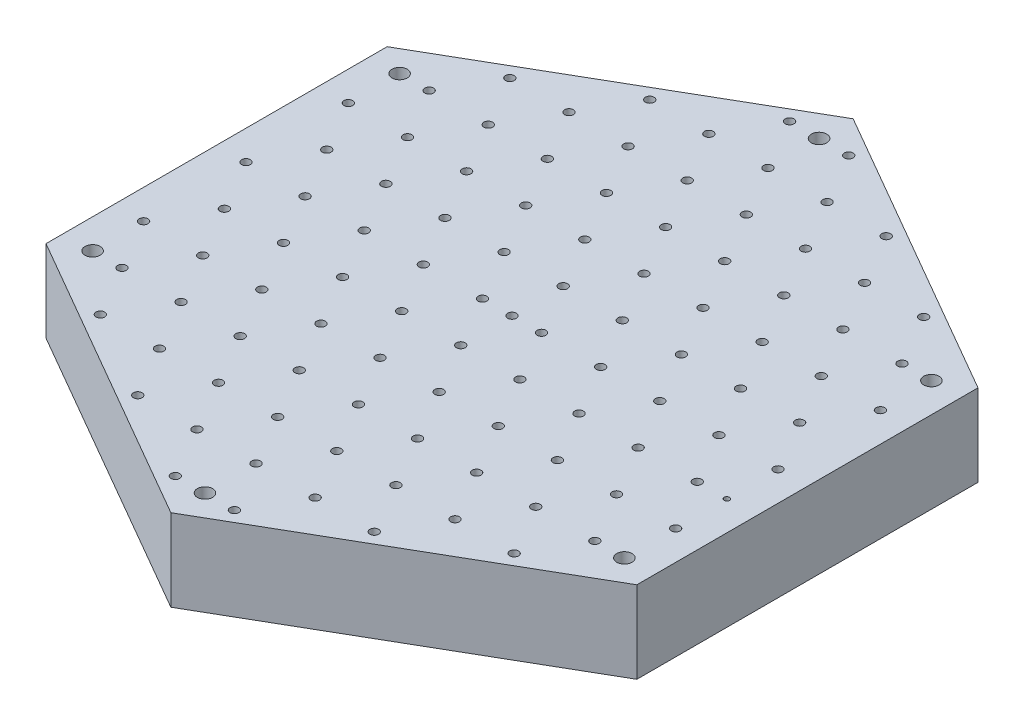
ISO-10303-21;
HEADER;
FILE_DESCRIPTION(('STEP AP214'),'2;1');
FILE_NAME('part.step','',(''),(''),'','','');
FILE_SCHEMA(('AUTOMOTIVE_DESIGN { 1 0 10303 214 1 1 1 1 }'));
ENDSEC;
DATA;
#1=APPLICATION_CONTEXT('core data for automotive mechanical design processes');
#2=APPLICATION_PROTOCOL_DEFINITION('international standard','automotive_design',2000,#1);
#3=PRODUCT_CONTEXT('',#1,'mechanical');
#4=PRODUCT('Part','Part','',(#3));
#5=PRODUCT_RELATED_PRODUCT_CATEGORY('part','',(#4));
#6=PRODUCT_DEFINITION_FORMATION('','',#4);
#7=PRODUCT_DEFINITION_CONTEXT('part definition',#1,'design');
#8=PRODUCT_DEFINITION('design','',#6,#7);
#9=PRODUCT_DEFINITION_SHAPE('','',#8);
#10=(LENGTH_UNIT() NAMED_UNIT(*) SI_UNIT(.MILLI.,.METRE.));
#11=(NAMED_UNIT(*) PLANE_ANGLE_UNIT() SI_UNIT($,.RADIAN.));
#12=(NAMED_UNIT(*) SI_UNIT($,.STERADIAN.) SOLID_ANGLE_UNIT());
#13=UNCERTAINTY_MEASURE_WITH_UNIT(LENGTH_MEASURE(1.E-05),#10,'distance_accuracy_value','');
#14=(GEOMETRIC_REPRESENTATION_CONTEXT(3) GLOBAL_UNCERTAINTY_ASSIGNED_CONTEXT((#13)) GLOBAL_UNIT_ASSIGNED_CONTEXT((#10,
#11,#12)) REPRESENTATION_CONTEXT('',''));
#15=CARTESIAN_POINT('',(0.,0.,0.));
#16=DIRECTION('',(0.,0.,1.));
#17=DIRECTION('',(1.,0.,0.));
#18=AXIS2_PLACEMENT_3D('',#15,#16,#17);
#19=CARTESIAN_POINT('',(54.1265877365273,15.,-31.25));
#20=DIRECTION('',(-0.5,0.,0.866025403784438));
#21=DIRECTION('',(0.866025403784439,0.,0.5));
#22=AXIS2_PLACEMENT_3D('',#19,#20,#21);
#23=PLANE('',#22);
#24=DIRECTION('',(-0.866025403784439,0.,-0.5));
#25=VECTOR('',#24,1.);
#26=CARTESIAN_POINT('',(54.1265877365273,0.,-31.25));
#27=LINE('',#26,#25);
#28=CARTESIAN_POINT('',(54.1265877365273,0.,-31.25));
#29=VERTEX_POINT('',#28);
#30=CARTESIAN_POINT('',(0.,0.,-62.5));
#31=VERTEX_POINT('',#30);
#32=EDGE_CURVE('E117',#29,#31,#27,.T.);
#33=ORIENTED_EDGE('',*,*,#32,.T.);
#34=DIRECTION('',(0.,-1.,0.));
#35=VECTOR('',#34,1.);
#36=CARTESIAN_POINT('',(0.,15.,-62.5));
#37=LINE('',#36,#35);
#38=CARTESIAN_POINT('',(0.,15.,-62.5));
#39=VERTEX_POINT('',#38);
#40=EDGE_CURVE('E11',#39,#31,#37,.T.);
#41=ORIENTED_EDGE('',*,*,#40,.F.);
#42=DIRECTION('',(-0.866025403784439,0.,-0.5));
#43=VECTOR('',#42,1.);
#44=CARTESIAN_POINT('',(54.1265877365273,15.,-31.25));
#45=LINE('',#44,#43);
#46=CARTESIAN_POINT('',(54.1265877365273,15.,-31.25));
#47=VERTEX_POINT('',#46);
#48=EDGE_CURVE('E128',#47,#39,#45,.T.);
#49=ORIENTED_EDGE('',*,*,#48,.F.);
#50=DIRECTION('',(0.,-1.,0.));
#51=VECTOR('',#50,1.);
#52=CARTESIAN_POINT('',(54.1265877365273,15.,-31.25));
#53=LINE('',#52,#51);
#54=EDGE_CURVE('E113',#47,#29,#53,.T.);
#55=ORIENTED_EDGE('',*,*,#54,.T.);
#56=EDGE_LOOP('',(#33,#41,#49,#55));
#57=FACE_BOUND('',#56,.T.);
#58=ADVANCED_FACE('F33',(#57),#23,.F.);
#59=CARTESIAN_POINT('',(0.,15.,-62.5));
#60=DIRECTION('',(0.5,0.,0.866025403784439));
#61=DIRECTION('',(0.866025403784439,0.,-0.5));
#62=AXIS2_PLACEMENT_3D('',#59,#60,#61);
#63=PLANE('',#62);
#64=DIRECTION('',(-0.866025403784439,0.,0.5));
#65=VECTOR('',#64,1.);
#66=CARTESIAN_POINT('',(0.,0.,-62.5));
#67=LINE('',#66,#65);
#68=CARTESIAN_POINT('',(-54.1265877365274,0.,-31.25));
#69=VERTEX_POINT('',#68);
#70=EDGE_CURVE('E120',#31,#69,#67,.T.);
#71=ORIENTED_EDGE('',*,*,#70,.T.);
#72=DIRECTION('',(0.,-1.,0.));
#73=VECTOR('',#72,1.);
#74=CARTESIAN_POINT('',(-54.1265877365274,15.,-31.25));
#75=LINE('',#74,#73);
#76=CARTESIAN_POINT('',(-54.1265877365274,15.,-31.25));
#77=VERTEX_POINT('',#76);
#78=EDGE_CURVE('E41',#77,#69,#75,.T.);
#79=ORIENTED_EDGE('',*,*,#78,.F.);
#80=DIRECTION('',(-0.866025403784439,0.,0.5));
#81=VECTOR('',#80,1.);
#82=CARTESIAN_POINT('',(0.,15.,-62.5));
#83=LINE('',#82,#81);
#84=EDGE_CURVE('E86',#39,#77,#83,.T.);
#85=ORIENTED_EDGE('',*,*,#84,.F.);
#86=ORIENTED_EDGE('',*,*,#40,.T.);
#87=EDGE_LOOP('',(#71,#79,#85,#86));
#88=FACE_BOUND('',#87,.T.);
#89=ADVANCED_FACE('F153',(#88),#63,.F.);
#90=CARTESIAN_POINT('',(-54.1265877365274,15.,-31.25));
#91=DIRECTION('',(1.,0.,0.));
#92=DIRECTION('',(0.,0.,-1.));
#93=AXIS2_PLACEMENT_3D('',#90,#91,#92);
#94=PLANE('',#93);
#95=DIRECTION('',(0.,0.,1.));
#96=VECTOR('',#95,1.);
#97=CARTESIAN_POINT('',(-54.1265877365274,0.,-31.25));
#98=LINE('',#97,#96);
#99=CARTESIAN_POINT('',(-54.1265877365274,0.,31.25));
#100=VERTEX_POINT('',#99);
#101=EDGE_CURVE('E123',#69,#100,#98,.T.);
#102=ORIENTED_EDGE('',*,*,#101,.T.);
#103=DIRECTION('',(0.,-1.,0.));
#104=VECTOR('',#103,1.);
#105=CARTESIAN_POINT('',(-54.1265877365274,15.,31.25));
#106=LINE('',#105,#104);
#107=CARTESIAN_POINT('',(-54.1265877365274,15.,31.25));
#108=VERTEX_POINT('',#107);
#109=EDGE_CURVE('E108',#108,#100,#106,.T.);
#110=ORIENTED_EDGE('',*,*,#109,.F.);
#111=DIRECTION('',(0.,0.,1.));
#112=VECTOR('',#111,1.);
#113=CARTESIAN_POINT('',(-54.1265877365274,15.,-31.25));
#114=LINE('',#113,#112);
#115=EDGE_CURVE('E99',#77,#108,#114,.T.);
#116=ORIENTED_EDGE('',*,*,#115,.F.);
#117=ORIENTED_EDGE('',*,*,#78,.T.);
#118=EDGE_LOOP('',(#102,#110,#116,#117));
#119=FACE_BOUND('',#118,.T.);
#120=ADVANCED_FACE('F134',(#119),#94,.F.);
#121=CARTESIAN_POINT('',(-54.1265877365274,15.,31.25));
#122=DIRECTION('',(0.5,0.,-0.866025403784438));
#123=DIRECTION('',(-0.866025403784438,0.,-0.5));
#124=AXIS2_PLACEMENT_3D('',#121,#122,#123);
#125=PLANE('',#124);
#126=DIRECTION('',(0.866025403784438,0.,0.5));
#127=VECTOR('',#126,1.);
#128=CARTESIAN_POINT('',(-54.1265877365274,0.,31.25));
#129=LINE('',#128,#127);
#130=CARTESIAN_POINT('',(0.,0.,62.5));
#131=VERTEX_POINT('',#130);
#132=EDGE_CURVE('E107',#100,#131,#129,.T.);
#133=ORIENTED_EDGE('',*,*,#132,.T.);
#134=DIRECTION('',(0.,-1.,0.));
#135=VECTOR('',#134,1.);
#136=CARTESIAN_POINT('',(0.,15.,62.5));
#137=LINE('',#136,#135);
#138=CARTESIAN_POINT('',(0.,15.,62.5));
#139=VERTEX_POINT('',#138);
#140=EDGE_CURVE('E104',#139,#131,#137,.T.);
#141=ORIENTED_EDGE('',*,*,#140,.F.);
#142=DIRECTION('',(0.866025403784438,0.,0.5));
#143=VECTOR('',#142,1.);
#144=CARTESIAN_POINT('',(-54.1265877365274,15.,31.25));
#145=LINE('',#144,#143);
#146=EDGE_CURVE('E93',#108,#139,#145,.T.);
#147=ORIENTED_EDGE('',*,*,#146,.F.);
#148=ORIENTED_EDGE('',*,*,#109,.T.);
#149=EDGE_LOOP('',(#133,#141,#147,#148));
#150=FACE_BOUND('',#149,.T.);
#151=ADVANCED_FACE('F105',(#150),#125,.F.);
#152=CARTESIAN_POINT('',(0.,15.,62.5));
#153=DIRECTION('',(-0.5,0.,-0.866025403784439));
#154=DIRECTION('',(-0.866025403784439,0.,0.5));
#155=AXIS2_PLACEMENT_3D('',#152,#153,#154);
#156=PLANE('',#155);
#157=DIRECTION('',(0.866025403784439,0.,-0.5));
#158=VECTOR('',#157,1.);
#159=CARTESIAN_POINT('',(0.,0.,62.5));
#160=LINE('',#159,#158);
#161=CARTESIAN_POINT('',(54.1265877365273,0.,31.25));
#162=VERTEX_POINT('',#161);
#163=EDGE_CURVE('E72',#131,#162,#160,.T.);
#164=ORIENTED_EDGE('',*,*,#163,.T.);
#165=DIRECTION('',(0.,-1.,0.));
#166=VECTOR('',#165,1.);
#167=CARTESIAN_POINT('',(54.1265877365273,15.,31.25));
#168=LINE('',#167,#166);
#169=CARTESIAN_POINT('',(54.1265877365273,15.,31.25));
#170=VERTEX_POINT('',#169);
#171=EDGE_CURVE('E109',#170,#162,#168,.T.);
#172=ORIENTED_EDGE('',*,*,#171,.F.);
#173=DIRECTION('',(0.866025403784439,0.,-0.5));
#174=VECTOR('',#173,1.);
#175=CARTESIAN_POINT('',(0.,15.,62.5));
#176=LINE('',#175,#174);
#177=EDGE_CURVE('E97',#139,#170,#176,.T.);
#178=ORIENTED_EDGE('',*,*,#177,.F.);
#179=ORIENTED_EDGE('',*,*,#140,.T.);
#180=EDGE_LOOP('',(#164,#172,#178,#179));
#181=FACE_BOUND('',#180,.T.);
#182=ADVANCED_FACE('F111',(#181),#156,.F.);
#183=CARTESIAN_POINT('',(54.1265877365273,15.,31.25));
#184=DIRECTION('',(-1.,0.,0.));
#185=DIRECTION('',(0.,0.,1.));
#186=AXIS2_PLACEMENT_3D('',#183,#184,#185);
#187=PLANE('',#186);
#188=DIRECTION('',(0.,0.,-1.));
#189=VECTOR('',#188,1.);
#190=CARTESIAN_POINT('',(54.1265877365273,0.,31.25));
#191=LINE('',#190,#189);
#192=EDGE_CURVE('E78',#162,#29,#191,.T.);
#193=ORIENTED_EDGE('',*,*,#192,.T.);
#194=ORIENTED_EDGE('',*,*,#54,.F.);
#195=DIRECTION('',(0.,0.,-1.));
#196=VECTOR('',#195,1.);
#197=CARTESIAN_POINT('',(54.1265877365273,15.,31.25));
#198=LINE('',#197,#196);
#199=EDGE_CURVE('E49',#170,#47,#198,.T.);
#200=ORIENTED_EDGE('',*,*,#199,.F.);
#201=ORIENTED_EDGE('',*,*,#171,.T.);
#202=EDGE_LOOP('',(#193,#194,#200,#201));
#203=FACE_BOUND('',#202,.T.);
#204=ADVANCED_FACE('F141',(#203),#187,.F.);
#205=CARTESIAN_POINT('',(0.,15.,0.));
#206=DIRECTION('',(0.,1.,0.));
#207=DIRECTION('',(0.,0.,1.));
#208=AXIS2_PLACEMENT_3D('',#205,#206,#207);
#209=PLANE('',#208);
#210=CARTESIAN_POINT('',(48.735,15.,9.37905512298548));
#211=DIRECTION('',(0.,1.,0.));
#212=DIRECTION('',(0.,0.,1.));
#213=AXIS2_PLACEMENT_3D('',#210,#211,#212);
#214=CIRCLE('',#213,0.499999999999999);
#215=CARTESIAN_POINT('',(48.735,15.,9.87905512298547));
#216=VERTEX_POINT('',#215);
#217=EDGE_CURVE('E1239',#216,#216,#214,.T.);
#218=ORIENTED_EDGE('',*,*,#217,.F.);
#219=EDGE_LOOP('',(#218));
#220=FACE_BOUND('',#219,.T.);
#221=CARTESIAN_POINT('',(-48.735,15.,-18.7581102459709));
#222=DIRECTION('',(0.,-1.,0.));
#223=DIRECTION('',(0.,0.,-1.));
#224=AXIS2_PLACEMENT_3D('',#221,#222,#223);
#225=CIRCLE('',#224,0.800000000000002);
#226=CARTESIAN_POINT('',(-48.735,15.,-19.5581102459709));
#227=VERTEX_POINT('',#226);
#228=EDGE_CURVE('E1246',#227,#227,#225,.T.);
#229=ORIENTED_EDGE('',*,*,#228,.T.);
#230=EDGE_LOOP('',(#229));
#231=FACE_BOUND('',#230,.T.);
#232=CARTESIAN_POINT('',(-43.32,15.,-28.1371653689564));
#233=DIRECTION('',(0.,-1.,0.));
#234=DIRECTION('',(0.,0.,-1.));
#235=AXIS2_PLACEMENT_3D('',#232,#233,#234);
#236=CIRCLE('',#235,0.799999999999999);
#237=CARTESIAN_POINT('',(-43.32,15.,-28.9371653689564));
#238=VERTEX_POINT('',#237);
#239=EDGE_CURVE('E1252',#238,#238,#236,.T.);
#240=ORIENTED_EDGE('',*,*,#239,.T.);
#241=EDGE_LOOP('',(#240));
#242=FACE_BOUND('',#241,.T.);
#243=CARTESIAN_POINT('',(-37.905,15.,-37.5162204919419));
#244=DIRECTION('',(0.,-1.,0.));
#245=DIRECTION('',(0.,0.,-1.));
#246=AXIS2_PLACEMENT_3D('',#243,#244,#245);
#247=CIRCLE('',#246,0.799999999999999);
#248=CARTESIAN_POINT('',(-37.905,15.,-38.3162204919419));
#249=VERTEX_POINT('',#248);
#250=EDGE_CURVE('E1258',#249,#249,#247,.T.);
#251=ORIENTED_EDGE('',*,*,#250,.T.);
#252=EDGE_LOOP('',(#251));
#253=FACE_BOUND('',#252,.T.);
#254=CARTESIAN_POINT('',(48.735,15.,18.758110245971));
#255=DIRECTION('',(0.,-1.,0.));
#256=DIRECTION('',(0.,0.,-1.));
#257=AXIS2_PLACEMENT_3D('',#254,#255,#256);
#258=CIRCLE('',#257,0.800000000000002);
#259=CARTESIAN_POINT('',(48.735,15.,17.9581102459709));
#260=VERTEX_POINT('',#259);
#261=EDGE_CURVE('E1264',#260,#260,#258,.T.);
#262=ORIENTED_EDGE('',*,*,#261,.T.);
#263=EDGE_LOOP('',(#262));
#264=FACE_BOUND('',#263,.T.);
#265=CARTESIAN_POINT('',(43.32,15.,28.1371653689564));
#266=DIRECTION('',(0.,-1.,0.));
#267=DIRECTION('',(0.,0.,-1.));
#268=AXIS2_PLACEMENT_3D('',#265,#266,#267);
#269=CIRCLE('',#268,0.799999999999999);
#270=CARTESIAN_POINT('',(43.32,15.,27.3371653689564));
#271=VERTEX_POINT('',#270);
#272=EDGE_CURVE('E1270',#271,#271,#269,.T.);
#273=ORIENTED_EDGE('',*,*,#272,.T.);
#274=EDGE_LOOP('',(#273));
#275=FACE_BOUND('',#274,.T.);
#276=CARTESIAN_POINT('',(37.905,15.,37.5162204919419));
#277=DIRECTION('',(0.,-1.,0.));
#278=DIRECTION('',(0.,0.,-1.));
#279=AXIS2_PLACEMENT_3D('',#276,#277,#278);
#280=CIRCLE('',#279,0.8);
#281=CARTESIAN_POINT('',(37.905,15.,36.7162204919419));
#282=VERTEX_POINT('',#281);
#283=EDGE_CURVE('E1276',#282,#282,#280,.T.);
#284=ORIENTED_EDGE('',*,*,#283,.T.);
#285=EDGE_LOOP('',(#284));
#286=FACE_BOUND('',#285,.T.);
#287=CARTESIAN_POINT('',(-27.075,15.,37.5162204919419));
#288=DIRECTION('',(0.,-1.,0.));
#289=DIRECTION('',(0.,0.,-1.));
#290=AXIS2_PLACEMENT_3D('',#287,#288,#289);
#291=CIRCLE('',#290,0.8);
#292=CARTESIAN_POINT('',(-27.075,15.,36.7162204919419));
#293=VERTEX_POINT('',#292);
#294=EDGE_CURVE('E1282',#293,#293,#291,.T.);
#295=ORIENTED_EDGE('',*,*,#294,.T.);
#296=EDGE_LOOP('',(#295));
#297=FACE_BOUND('',#296,.T.);
#298=CARTESIAN_POINT('',(-21.66,15.,28.1371653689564));
#299=DIRECTION('',(0.,-1.,0.));
#300=DIRECTION('',(0.,0.,-1.));
#301=AXIS2_PLACEMENT_3D('',#298,#299,#300);
#302=CIRCLE('',#301,0.8);
#303=CARTESIAN_POINT('',(-21.66,15.,27.3371653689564));
#304=VERTEX_POINT('',#303);
#305=EDGE_CURVE('E1288',#304,#304,#302,.T.);
#306=ORIENTED_EDGE('',*,*,#305,.T.);
#307=EDGE_LOOP('',(#306));
#308=FACE_BOUND('',#307,.T.);
#309=CARTESIAN_POINT('',(-16.245,15.,18.7581102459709));
#310=DIRECTION('',(0.,-1.,0.));
#311=DIRECTION('',(0.,0.,-1.));
#312=AXIS2_PLACEMENT_3D('',#309,#310,#311);
#313=CIRCLE('',#312,0.8);
#314=CARTESIAN_POINT('',(-16.245,15.,17.9581102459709));
#315=VERTEX_POINT('',#314);
#316=EDGE_CURVE('E1294',#315,#315,#313,.T.);
#317=ORIENTED_EDGE('',*,*,#316,.T.);
#318=EDGE_LOOP('',(#317));
#319=FACE_BOUND('',#318,.T.);
#320=CARTESIAN_POINT('',(-10.83,15.,9.37905512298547));
#321=DIRECTION('',(0.,-1.,0.));
#322=DIRECTION('',(0.,0.,-1.));
#323=AXIS2_PLACEMENT_3D('',#320,#321,#322);
#324=CIRCLE('',#323,0.8);
#325=CARTESIAN_POINT('',(-10.83,15.,8.57905512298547));
#326=VERTEX_POINT('',#325);
#327=EDGE_CURVE('E1300',#326,#326,#324,.T.);
#328=ORIENTED_EDGE('',*,*,#327,.T.);
#329=EDGE_LOOP('',(#328));
#330=FACE_BOUND('',#329,.T.);
#331=CARTESIAN_POINT('',(21.66,15.,-46.8952756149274));
#332=DIRECTION('',(0.,-1.,0.));
#333=DIRECTION('',(0.,0.,-1.));
#334=AXIS2_PLACEMENT_3D('',#331,#332,#333);
#335=CIRCLE('',#334,0.8);
#336=CARTESIAN_POINT('',(21.66,15.,-47.6952756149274));
#337=VERTEX_POINT('',#336);
#338=EDGE_CURVE('E1306',#337,#337,#335,.T.);
#339=ORIENTED_EDGE('',*,*,#338,.T.);
#340=EDGE_LOOP('',(#339));
#341=FACE_BOUND('',#340,.T.);
#342=CARTESIAN_POINT('',(16.245,15.,-37.5162204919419));
#343=DIRECTION('',(0.,-1.,0.));
#344=DIRECTION('',(0.,0.,-1.));
#345=AXIS2_PLACEMENT_3D('',#342,#343,#344);
#346=CIRCLE('',#345,0.8);
#347=CARTESIAN_POINT('',(16.245,15.,-38.3162204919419));
#348=VERTEX_POINT('',#347);
#349=EDGE_CURVE('E1312',#348,#348,#346,.T.);
#350=ORIENTED_EDGE('',*,*,#349,.T.);
#351=EDGE_LOOP('',(#350));
#352=FACE_BOUND('',#351,.T.);
#353=CARTESIAN_POINT('',(10.83,15.,-28.1371653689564));
#354=DIRECTION('',(0.,-1.,0.));
#355=DIRECTION('',(0.,0.,-1.));
#356=AXIS2_PLACEMENT_3D('',#353,#354,#355);
#357=CIRCLE('',#356,0.8);
#358=CARTESIAN_POINT('',(10.83,15.,-28.9371653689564));
#359=VERTEX_POINT('',#358);
#360=EDGE_CURVE('E1318',#359,#359,#357,.T.);
#361=ORIENTED_EDGE('',*,*,#360,.T.);
#362=EDGE_LOOP('',(#361));
#363=FACE_BOUND('',#362,.T.);
#364=CARTESIAN_POINT('',(5.41499999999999,15.,-18.7581102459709));
#365=DIRECTION('',(0.,-1.,0.));
#366=DIRECTION('',(0.,0.,-1.));
#367=AXIS2_PLACEMENT_3D('',#364,#365,#366);
#368=CIRCLE('',#367,0.8);
#369=CARTESIAN_POINT('',(5.41499999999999,15.,-19.5581102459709));
#370=VERTEX_POINT('',#369);
#371=EDGE_CURVE('E1324',#370,#370,#368,.T.);
#372=ORIENTED_EDGE('',*,*,#371,.T.);
#373=EDGE_LOOP('',(#372));
#374=FACE_BOUND('',#373,.T.);
#375=CARTESIAN_POINT('',(0.,15.,-9.37905512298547));
#376=DIRECTION('',(0.,-1.,0.));
#377=DIRECTION('',(0.,0.,-1.));
#378=AXIS2_PLACEMENT_3D('',#375,#376,#377);
#379=CIRCLE('',#378,0.8);
#380=CARTESIAN_POINT('',(0.,15.,-10.1790551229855));
#381=VERTEX_POINT('',#380);
#382=EDGE_CURVE('E1330',#381,#381,#379,.T.);
#383=ORIENTED_EDGE('',*,*,#382,.T.);
#384=EDGE_LOOP('',(#383));
#385=FACE_BOUND('',#384,.T.);
#386=CARTESIAN_POINT('',(-37.905,15.,37.5162204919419));
#387=DIRECTION('',(0.,-1.,0.));
#388=DIRECTION('',(0.,0.,-1.));
#389=AXIS2_PLACEMENT_3D('',#386,#387,#388);
#390=CIRCLE('',#389,0.799999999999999);
#391=CARTESIAN_POINT('',(-37.905,15.,36.7162204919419));
#392=VERTEX_POINT('',#391);
#393=EDGE_CURVE('E1336',#392,#392,#390,.T.);
#394=ORIENTED_EDGE('',*,*,#393,.T.);
#395=EDGE_LOOP('',(#394));
#396=FACE_BOUND('',#395,.T.);
#397=CARTESIAN_POINT('',(-32.49,15.,28.1371653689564));
#398=DIRECTION('',(0.,-1.,0.));
#399=DIRECTION('',(0.,0.,-1.));
#400=AXIS2_PLACEMENT_3D('',#397,#398,#399);
#401=CIRCLE('',#400,0.799999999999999);
#402=CARTESIAN_POINT('',(-32.49,15.,27.3371653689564));
#403=VERTEX_POINT('',#402);
#404=EDGE_CURVE('E1342',#403,#403,#401,.T.);
#405=ORIENTED_EDGE('',*,*,#404,.T.);
#406=EDGE_LOOP('',(#405));
#407=FACE_BOUND('',#406,.T.);
#408=CARTESIAN_POINT('',(-27.075,15.,18.7581102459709));
#409=DIRECTION('',(0.,-1.,0.));
#410=DIRECTION('',(0.,0.,-1.));
#411=AXIS2_PLACEMENT_3D('',#408,#409,#410);
#412=CIRCLE('',#411,0.799999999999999);
#413=CARTESIAN_POINT('',(-27.075,15.,17.9581102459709));
#414=VERTEX_POINT('',#413);
#415=EDGE_CURVE('E1348',#414,#414,#412,.T.);
#416=ORIENTED_EDGE('',*,*,#415,.T.);
#417=EDGE_LOOP('',(#416));
#418=FACE_BOUND('',#417,.T.);
#419=CARTESIAN_POINT('',(-21.66,15.,9.37905512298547));
#420=DIRECTION('',(0.,-1.,0.));
#421=DIRECTION('',(0.,0.,-1.));
#422=AXIS2_PLACEMENT_3D('',#419,#420,#421);
#423=CIRCLE('',#422,0.799999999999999);
#424=CARTESIAN_POINT('',(-21.66,15.,8.57905512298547));
#425=VERTEX_POINT('',#424);
#426=EDGE_CURVE('E1354',#425,#425,#423,.T.);
#427=ORIENTED_EDGE('',*,*,#426,.T.);
#428=EDGE_LOOP('',(#427));
#429=FACE_BOUND('',#428,.T.);
#430=CARTESIAN_POINT('',(10.83,15.,-46.8952756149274));
#431=DIRECTION('',(0.,-1.,0.));
#432=DIRECTION('',(0.,0.,-1.));
#433=AXIS2_PLACEMENT_3D('',#430,#431,#432);
#434=CIRCLE('',#433,0.799999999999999);
#435=CARTESIAN_POINT('',(10.83,15.,-47.6952756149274));
#436=VERTEX_POINT('',#435);
#437=EDGE_CURVE('E1360',#436,#436,#434,.T.);
#438=ORIENTED_EDGE('',*,*,#437,.T.);
#439=EDGE_LOOP('',(#438));
#440=FACE_BOUND('',#439,.T.);
#441=CARTESIAN_POINT('',(5.41499999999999,15.,-37.5162204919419));
#442=DIRECTION('',(0.,-1.,0.));
#443=DIRECTION('',(0.,0.,-1.));
#444=AXIS2_PLACEMENT_3D('',#441,#442,#443);
#445=CIRCLE('',#444,0.799999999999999);
#446=CARTESIAN_POINT('',(5.41499999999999,15.,-38.3162204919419));
#447=VERTEX_POINT('',#446);
#448=EDGE_CURVE('E1366',#447,#447,#445,.T.);
#449=ORIENTED_EDGE('',*,*,#448,.T.);
#450=EDGE_LOOP('',(#449));
#451=FACE_BOUND('',#450,.T.);
#452=CARTESIAN_POINT('',(0.,15.,-28.1371653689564));
#453=DIRECTION('',(0.,-1.,0.));
#454=DIRECTION('',(0.,0.,-1.));
#455=AXIS2_PLACEMENT_3D('',#452,#453,#454);
#456=CIRCLE('',#455,0.799999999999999);
#457=CARTESIAN_POINT('',(0.,15.,-28.9371653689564));
#458=VERTEX_POINT('',#457);
#459=EDGE_CURVE('E1372',#458,#458,#456,.T.);
#460=ORIENTED_EDGE('',*,*,#459,.T.);
#461=EDGE_LOOP('',(#460));
#462=FACE_BOUND('',#461,.T.);
#463=CARTESIAN_POINT('',(-5.41500000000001,15.,-18.7581102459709));
#464=DIRECTION('',(0.,-1.,0.));
#465=DIRECTION('',(0.,0.,-1.));
#466=AXIS2_PLACEMENT_3D('',#463,#464,#465);
#467=CIRCLE('',#466,0.799999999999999);
#468=CARTESIAN_POINT('',(-5.41500000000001,15.,-19.5581102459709));
#469=VERTEX_POINT('',#468);
#470=EDGE_CURVE('E1378',#469,#469,#467,.T.);
#471=ORIENTED_EDGE('',*,*,#470,.T.);
#472=EDGE_LOOP('',(#471));
#473=FACE_BOUND('',#472,.T.);
#474=CARTESIAN_POINT('',(-10.83,15.,-9.37905512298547));
#475=DIRECTION('',(0.,-1.,0.));
#476=DIRECTION('',(0.,0.,-1.));
#477=AXIS2_PLACEMENT_3D('',#474,#475,#476);
#478=CIRCLE('',#477,0.799999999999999);
#479=CARTESIAN_POINT('',(-10.83,15.,-10.1790551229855));
#480=VERTEX_POINT('',#479);
#481=EDGE_CURVE('E1384',#480,#480,#478,.T.);
#482=ORIENTED_EDGE('',*,*,#481,.T.);
#483=EDGE_LOOP('',(#482));
#484=FACE_BOUND('',#483,.T.);
#485=CARTESIAN_POINT('',(5.41499999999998,15.,-56.2743307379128));
#486=DIRECTION('',(0.,-1.,0.));
#487=DIRECTION('',(0.,0.,-1.));
#488=AXIS2_PLACEMENT_3D('',#485,#486,#487);
#489=CIRCLE('',#488,0.799999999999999);
#490=CARTESIAN_POINT('',(5.41499999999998,15.,-57.0743307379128));
#491=VERTEX_POINT('',#490);
#492=EDGE_CURVE('E1390',#491,#491,#489,.T.);
#493=ORIENTED_EDGE('',*,*,#492,.T.);
#494=EDGE_LOOP('',(#493));
#495=FACE_BOUND('',#494,.T.);
#496=CARTESIAN_POINT('',(0.,15.,-46.8952756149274));
#497=DIRECTION('',(0.,-1.,0.));
#498=DIRECTION('',(0.,0.,-1.));
#499=AXIS2_PLACEMENT_3D('',#496,#497,#498);
#500=CIRCLE('',#499,0.799999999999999);
#501=CARTESIAN_POINT('',(0.,15.,-47.6952756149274));
#502=VERTEX_POINT('',#501);
#503=EDGE_CURVE('E1396',#502,#502,#500,.T.);
#504=ORIENTED_EDGE('',*,*,#503,.T.);
#505=EDGE_LOOP('',(#504));
#506=FACE_BOUND('',#505,.T.);
#507=CARTESIAN_POINT('',(-5.41500000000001,15.,-37.5162204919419));
#508=DIRECTION('',(0.,-1.,0.));
#509=DIRECTION('',(0.,0.,-1.));
#510=AXIS2_PLACEMENT_3D('',#507,#508,#509);
#511=CIRCLE('',#510,0.799999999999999);
#512=CARTESIAN_POINT('',(-5.41500000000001,15.,-38.3162204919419));
#513=VERTEX_POINT('',#512);
#514=EDGE_CURVE('E1402',#513,#513,#511,.T.);
#515=ORIENTED_EDGE('',*,*,#514,.T.);
#516=EDGE_LOOP('',(#515));
#517=FACE_BOUND('',#516,.T.);
#518=CARTESIAN_POINT('',(-10.83,15.,-28.1371653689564));
#519=DIRECTION('',(0.,-1.,0.));
#520=DIRECTION('',(0.,0.,-1.));
#521=AXIS2_PLACEMENT_3D('',#518,#519,#520);
#522=CIRCLE('',#521,0.799999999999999);
#523=CARTESIAN_POINT('',(-10.83,15.,-28.9371653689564));
#524=VERTEX_POINT('',#523);
#525=EDGE_CURVE('E1408',#524,#524,#522,.T.);
#526=ORIENTED_EDGE('',*,*,#525,.T.);
#527=EDGE_LOOP('',(#526));
#528=FACE_BOUND('',#527,.T.);
#529=CARTESIAN_POINT('',(-16.245,15.,-18.7581102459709));
#530=DIRECTION('',(0.,-1.,0.));
#531=DIRECTION('',(0.,0.,-1.));
#532=AXIS2_PLACEMENT_3D('',#529,#530,#531);
#533=CIRCLE('',#532,0.799999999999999);
#534=CARTESIAN_POINT('',(-16.245,15.,-19.5581102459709));
#535=VERTEX_POINT('',#534);
#536=EDGE_CURVE('E1414',#535,#535,#533,.T.);
#537=ORIENTED_EDGE('',*,*,#536,.T.);
#538=EDGE_LOOP('',(#537));
#539=FACE_BOUND('',#538,.T.);
#540=CARTESIAN_POINT('',(-21.66,15.,-9.37905512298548));
#541=DIRECTION('',(0.,-1.,0.));
#542=DIRECTION('',(0.,0.,-1.));
#543=AXIS2_PLACEMENT_3D('',#540,#541,#542);
#544=CIRCLE('',#543,0.799999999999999);
#545=CARTESIAN_POINT('',(-21.66,15.,-10.1790551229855));
#546=VERTEX_POINT('',#545);
#547=EDGE_CURVE('E1420',#546,#546,#544,.T.);
#548=ORIENTED_EDGE('',*,*,#547,.T.);
#549=EDGE_LOOP('',(#548));
#550=FACE_BOUND('',#549,.T.);
#551=CARTESIAN_POINT('',(-43.32,15.,28.1371653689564));
#552=DIRECTION('',(0.,-1.,0.));
#553=DIRECTION('',(0.,0.,-1.));
#554=AXIS2_PLACEMENT_3D('',#551,#552,#553);
#555=CIRCLE('',#554,0.799999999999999);
#556=CARTESIAN_POINT('',(-43.32,15.,27.3371653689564));
#557=VERTEX_POINT('',#556);
#558=EDGE_CURVE('E1426',#557,#557,#555,.T.);
#559=ORIENTED_EDGE('',*,*,#558,.T.);
#560=EDGE_LOOP('',(#559));
#561=FACE_BOUND('',#560,.T.);
#562=CARTESIAN_POINT('',(-37.905,15.,18.7581102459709));
#563=DIRECTION('',(0.,-1.,0.));
#564=DIRECTION('',(0.,0.,-1.));
#565=AXIS2_PLACEMENT_3D('',#562,#563,#564);
#566=CIRCLE('',#565,0.799999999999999);
#567=CARTESIAN_POINT('',(-37.905,15.,17.9581102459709));
#568=VERTEX_POINT('',#567);
#569=EDGE_CURVE('E1432',#568,#568,#566,.T.);
#570=ORIENTED_EDGE('',*,*,#569,.T.);
#571=EDGE_LOOP('',(#570));
#572=FACE_BOUND('',#571,.T.);
#573=CARTESIAN_POINT('',(-32.49,15.,9.37905512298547));
#574=DIRECTION('',(0.,-1.,0.));
#575=DIRECTION('',(0.,0.,-1.));
#576=AXIS2_PLACEMENT_3D('',#573,#574,#575);
#577=CIRCLE('',#576,0.799999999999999);
#578=CARTESIAN_POINT('',(-32.49,15.,8.57905512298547));
#579=VERTEX_POINT('',#578);
#580=EDGE_CURVE('E1438',#579,#579,#577,.T.);
#581=ORIENTED_EDGE('',*,*,#580,.T.);
#582=EDGE_LOOP('',(#581));
#583=FACE_BOUND('',#582,.T.);
#584=CARTESIAN_POINT('',(-5.41500000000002,15.,-56.2743307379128));
#585=DIRECTION('',(0.,-1.,0.));
#586=DIRECTION('',(0.,0.,-1.));
#587=AXIS2_PLACEMENT_3D('',#584,#585,#586);
#588=CIRCLE('',#587,0.800000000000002);
#589=CARTESIAN_POINT('',(-5.41500000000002,15.,-57.0743307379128));
#590=VERTEX_POINT('',#589);
#591=EDGE_CURVE('E1444',#590,#590,#588,.T.);
#592=ORIENTED_EDGE('',*,*,#591,.T.);
#593=EDGE_LOOP('',(#592));
#594=FACE_BOUND('',#593,.T.);
#595=CARTESIAN_POINT('',(-10.83,15.,-46.8952756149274));
#596=DIRECTION('',(0.,-1.,0.));
#597=DIRECTION('',(0.,0.,-1.));
#598=AXIS2_PLACEMENT_3D('',#595,#596,#597);
#599=CIRCLE('',#598,0.800000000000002);
#600=CARTESIAN_POINT('',(-10.83,15.,-47.6952756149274));
#601=VERTEX_POINT('',#600);
#602=EDGE_CURVE('E1450',#601,#601,#599,.T.);
#603=ORIENTED_EDGE('',*,*,#602,.T.);
#604=EDGE_LOOP('',(#603));
#605=FACE_BOUND('',#604,.T.);
#606=CARTESIAN_POINT('',(-16.245,15.,-37.5162204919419));
#607=DIRECTION('',(0.,-1.,0.));
#608=DIRECTION('',(0.,0.,-1.));
#609=AXIS2_PLACEMENT_3D('',#606,#607,#608);
#610=CIRCLE('',#609,0.800000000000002);
#611=CARTESIAN_POINT('',(-16.245,15.,-38.3162204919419));
#612=VERTEX_POINT('',#611);
#613=EDGE_CURVE('E1456',#612,#612,#610,.T.);
#614=ORIENTED_EDGE('',*,*,#613,.T.);
#615=EDGE_LOOP('',(#614));
#616=FACE_BOUND('',#615,.T.);
#617=CARTESIAN_POINT('',(-21.66,15.,-28.1371653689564));
#618=DIRECTION('',(0.,-1.,0.));
#619=DIRECTION('',(0.,0.,-1.));
#620=AXIS2_PLACEMENT_3D('',#617,#618,#619);
#621=CIRCLE('',#620,0.800000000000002);
#622=CARTESIAN_POINT('',(-21.66,15.,-28.9371653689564));
#623=VERTEX_POINT('',#622);
#624=EDGE_CURVE('E1462',#623,#623,#621,.T.);
#625=ORIENTED_EDGE('',*,*,#624,.T.);
#626=EDGE_LOOP('',(#625));
#627=FACE_BOUND('',#626,.T.);
#628=CARTESIAN_POINT('',(-27.075,15.,-18.758110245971));
#629=DIRECTION('',(0.,-1.,0.));
#630=DIRECTION('',(0.,0.,-1.));
#631=AXIS2_PLACEMENT_3D('',#628,#629,#630);
#632=CIRCLE('',#631,0.800000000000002);
#633=CARTESIAN_POINT('',(-27.075,15.,-19.558110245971));
#634=VERTEX_POINT('',#633);
#635=EDGE_CURVE('E1468',#634,#634,#632,.T.);
#636=ORIENTED_EDGE('',*,*,#635,.T.);
#637=EDGE_LOOP('',(#636));
#638=FACE_BOUND('',#637,.T.);
#639=CARTESIAN_POINT('',(-32.49,15.,-9.37905512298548));
#640=DIRECTION('',(0.,-1.,0.));
#641=DIRECTION('',(0.,0.,-1.));
#642=AXIS2_PLACEMENT_3D('',#639,#640,#641);
#643=CIRCLE('',#642,0.800000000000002);
#644=CARTESIAN_POINT('',(-32.49,15.,-10.1790551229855));
#645=VERTEX_POINT('',#644);
#646=EDGE_CURVE('E1474',#645,#645,#643,.T.);
#647=ORIENTED_EDGE('',*,*,#646,.T.);
#648=EDGE_LOOP('',(#647));
#649=FACE_BOUND('',#648,.T.);
#650=CARTESIAN_POINT('',(-48.735,15.,18.7581102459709));
#651=DIRECTION('',(0.,-1.,0.));
#652=DIRECTION('',(0.,0.,-1.));
#653=AXIS2_PLACEMENT_3D('',#650,#651,#652);
#654=CIRCLE('',#653,0.800000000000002);
#655=CARTESIAN_POINT('',(-48.735,15.,17.9581102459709));
#656=VERTEX_POINT('',#655);
#657=EDGE_CURVE('E1480',#656,#656,#654,.T.);
#658=ORIENTED_EDGE('',*,*,#657,.T.);
#659=EDGE_LOOP('',(#658));
#660=FACE_BOUND('',#659,.T.);
#661=CARTESIAN_POINT('',(-43.32,15.,9.37905512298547));
#662=DIRECTION('',(0.,-1.,0.));
#663=DIRECTION('',(0.,0.,-1.));
#664=AXIS2_PLACEMENT_3D('',#661,#662,#663);
#665=CIRCLE('',#664,0.800000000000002);
#666=CARTESIAN_POINT('',(-43.32,15.,8.57905512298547));
#667=VERTEX_POINT('',#666);
#668=EDGE_CURVE('E1486',#667,#667,#665,.T.);
#669=ORIENTED_EDGE('',*,*,#668,.T.);
#670=EDGE_LOOP('',(#669));
#671=FACE_BOUND('',#670,.T.);
#672=CARTESIAN_POINT('',(-21.66,15.,-46.8952756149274));
#673=DIRECTION('',(0.,-1.,0.));
#674=DIRECTION('',(0.,0.,-1.));
#675=AXIS2_PLACEMENT_3D('',#672,#673,#674);
#676=CIRCLE('',#675,0.800000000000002);
#677=CARTESIAN_POINT('',(-21.66,15.,-47.6952756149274));
#678=VERTEX_POINT('',#677);
#679=EDGE_CURVE('E1492',#678,#678,#676,.T.);
#680=ORIENTED_EDGE('',*,*,#679,.T.);
#681=EDGE_LOOP('',(#680));
#682=FACE_BOUND('',#681,.T.);
#683=CARTESIAN_POINT('',(-27.075,15.,-37.5162204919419));
#684=DIRECTION('',(0.,-1.,0.));
#685=DIRECTION('',(0.,0.,-1.));
#686=AXIS2_PLACEMENT_3D('',#683,#684,#685);
#687=CIRCLE('',#686,0.800000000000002);
#688=CARTESIAN_POINT('',(-27.075,15.,-38.3162204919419));
#689=VERTEX_POINT('',#688);
#690=EDGE_CURVE('E1498',#689,#689,#687,.T.);
#691=ORIENTED_EDGE('',*,*,#690,.T.);
#692=EDGE_LOOP('',(#691));
#693=FACE_BOUND('',#692,.T.);
#694=CARTESIAN_POINT('',(-32.49,15.,-28.1371653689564));
#695=DIRECTION('',(0.,-1.,0.));
#696=DIRECTION('',(0.,0.,-1.));
#697=AXIS2_PLACEMENT_3D('',#694,#695,#696);
#698=CIRCLE('',#697,0.800000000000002);
#699=CARTESIAN_POINT('',(-32.49,15.,-28.9371653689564));
#700=VERTEX_POINT('',#699);
#701=EDGE_CURVE('E1504',#700,#700,#698,.T.);
#702=ORIENTED_EDGE('',*,*,#701,.T.);
#703=EDGE_LOOP('',(#702));
#704=FACE_BOUND('',#703,.T.);
#705=CARTESIAN_POINT('',(-37.905,15.,-18.758110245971));
#706=DIRECTION('',(0.,-1.,0.));
#707=DIRECTION('',(0.,0.,-1.));
#708=AXIS2_PLACEMENT_3D('',#705,#706,#707);
#709=CIRCLE('',#708,0.800000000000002);
#710=CARTESIAN_POINT('',(-37.905,15.,-19.558110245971));
#711=VERTEX_POINT('',#710);
#712=EDGE_CURVE('E1510',#711,#711,#709,.T.);
#713=ORIENTED_EDGE('',*,*,#712,.T.);
#714=EDGE_LOOP('',(#713));
#715=FACE_BOUND('',#714,.T.);
#716=CARTESIAN_POINT('',(-43.32,15.,-9.37905512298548));
#717=DIRECTION('',(0.,-1.,0.));
#718=DIRECTION('',(0.,0.,-1.));
#719=AXIS2_PLACEMENT_3D('',#716,#717,#718);
#720=CIRCLE('',#719,0.800000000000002);
#721=CARTESIAN_POINT('',(-43.32,15.,-10.1790551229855));
#722=VERTEX_POINT('',#721);
#723=EDGE_CURVE('E1516',#722,#722,#720,.T.);
#724=ORIENTED_EDGE('',*,*,#723,.T.);
#725=EDGE_LOOP('',(#724));
#726=FACE_BOUND('',#725,.T.);
#727=CARTESIAN_POINT('',(21.66,15.,46.8952756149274));
#728=DIRECTION('',(0.,-1.,0.));
#729=DIRECTION('',(0.,0.,-1.));
#730=AXIS2_PLACEMENT_3D('',#727,#728,#729);
#731=CIRCLE('',#730,0.800000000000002);
#732=CARTESIAN_POINT('',(21.66,15.,46.0952756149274));
#733=VERTEX_POINT('',#732);
#734=EDGE_CURVE('E1522',#733,#733,#731,.T.);
#735=ORIENTED_EDGE('',*,*,#734,.T.);
#736=EDGE_LOOP('',(#735));
#737=FACE_BOUND('',#736,.T.);
#738=CARTESIAN_POINT('',(27.075,15.,37.5162204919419));
#739=DIRECTION('',(0.,-1.,0.));
#740=DIRECTION('',(0.,0.,-1.));
#741=AXIS2_PLACEMENT_3D('',#738,#739,#740);
#742=CIRCLE('',#741,0.800000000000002);
#743=CARTESIAN_POINT('',(27.075,15.,36.7162204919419));
#744=VERTEX_POINT('',#743);
#745=EDGE_CURVE('E1528',#744,#744,#742,.T.);
#746=ORIENTED_EDGE('',*,*,#745,.T.);
#747=EDGE_LOOP('',(#746));
#748=FACE_BOUND('',#747,.T.);
#749=CARTESIAN_POINT('',(32.49,15.,28.1371653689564));
#750=DIRECTION('',(0.,-1.,0.));
#751=DIRECTION('',(0.,0.,-1.));
#752=AXIS2_PLACEMENT_3D('',#749,#750,#751);
#753=CIRCLE('',#752,0.800000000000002);
#754=CARTESIAN_POINT('',(32.49,15.,27.3371653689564));
#755=VERTEX_POINT('',#754);
#756=EDGE_CURVE('E1534',#755,#755,#753,.T.);
#757=ORIENTED_EDGE('',*,*,#756,.T.);
#758=EDGE_LOOP('',(#757));
#759=FACE_BOUND('',#758,.T.);
#760=CARTESIAN_POINT('',(37.905,15.,18.758110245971));
#761=DIRECTION('',(0.,-1.,0.));
#762=DIRECTION('',(0.,0.,-1.));
#763=AXIS2_PLACEMENT_3D('',#760,#761,#762);
#764=CIRCLE('',#763,0.800000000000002);
#765=CARTESIAN_POINT('',(37.905,15.,17.9581102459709));
#766=VERTEX_POINT('',#765);
#767=EDGE_CURVE('E1540',#766,#766,#764,.T.);
#768=ORIENTED_EDGE('',*,*,#767,.T.);
#769=EDGE_LOOP('',(#768));
#770=FACE_BOUND('',#769,.T.);
#771=CARTESIAN_POINT('',(43.32,15.,9.37905512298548));
#772=DIRECTION('',(0.,-1.,0.));
#773=DIRECTION('',(0.,0.,-1.));
#774=AXIS2_PLACEMENT_3D('',#771,#772,#773);
#775=CIRCLE('',#774,0.800000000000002);
#776=CARTESIAN_POINT('',(43.32,15.,8.57905512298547));
#777=VERTEX_POINT('',#776);
#778=EDGE_CURVE('E1546',#777,#777,#775,.T.);
#779=ORIENTED_EDGE('',*,*,#778,.T.);
#780=EDGE_LOOP('',(#779));
#781=FACE_BOUND('',#780,.T.);
#782=CARTESIAN_POINT('',(5.41500000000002,15.,56.2743307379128));
#783=DIRECTION('',(0.,-1.,0.));
#784=DIRECTION('',(0.,0.,-1.));
#785=AXIS2_PLACEMENT_3D('',#782,#783,#784);
#786=CIRCLE('',#785,0.800000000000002);
#787=CARTESIAN_POINT('',(5.41500000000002,15.,55.4743307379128));
#788=VERTEX_POINT('',#787);
#789=EDGE_CURVE('E1552',#788,#788,#786,.T.);
#790=ORIENTED_EDGE('',*,*,#789,.T.);
#791=EDGE_LOOP('',(#790));
#792=FACE_BOUND('',#791,.T.);
#793=CARTESIAN_POINT('',(10.83,15.,46.8952756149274));
#794=DIRECTION('',(0.,-1.,0.));
#795=DIRECTION('',(0.,0.,-1.));
#796=AXIS2_PLACEMENT_3D('',#793,#794,#795);
#797=CIRCLE('',#796,0.800000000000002);
#798=CARTESIAN_POINT('',(10.83,15.,46.0952756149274));
#799=VERTEX_POINT('',#798);
#800=EDGE_CURVE('E1558',#799,#799,#797,.T.);
#801=ORIENTED_EDGE('',*,*,#800,.T.);
#802=EDGE_LOOP('',(#801));
#803=FACE_BOUND('',#802,.T.);
#804=CARTESIAN_POINT('',(16.245,15.,37.5162204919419));
#805=DIRECTION('',(0.,-1.,0.));
#806=DIRECTION('',(0.,0.,-1.));
#807=AXIS2_PLACEMENT_3D('',#804,#805,#806);
#808=CIRCLE('',#807,0.800000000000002);
#809=CARTESIAN_POINT('',(16.245,15.,36.7162204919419));
#810=VERTEX_POINT('',#809);
#811=EDGE_CURVE('E1564',#810,#810,#808,.T.);
#812=ORIENTED_EDGE('',*,*,#811,.T.);
#813=EDGE_LOOP('',(#812));
#814=FACE_BOUND('',#813,.T.);
#815=CARTESIAN_POINT('',(21.66,15.,28.1371653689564));
#816=DIRECTION('',(0.,-1.,0.));
#817=DIRECTION('',(0.,0.,-1.));
#818=AXIS2_PLACEMENT_3D('',#815,#816,#817);
#819=CIRCLE('',#818,0.800000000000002);
#820=CARTESIAN_POINT('',(21.66,15.,27.3371653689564));
#821=VERTEX_POINT('',#820);
#822=EDGE_CURVE('E1570',#821,#821,#819,.T.);
#823=ORIENTED_EDGE('',*,*,#822,.T.);
#824=EDGE_LOOP('',(#823));
#825=FACE_BOUND('',#824,.T.);
#826=CARTESIAN_POINT('',(27.075,15.,18.758110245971));
#827=DIRECTION('',(0.,-1.,0.));
#828=DIRECTION('',(0.,0.,-1.));
#829=AXIS2_PLACEMENT_3D('',#826,#827,#828);
#830=CIRCLE('',#829,0.800000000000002);
#831=CARTESIAN_POINT('',(27.075,15.,17.9581102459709));
#832=VERTEX_POINT('',#831);
#833=EDGE_CURVE('E1576',#832,#832,#830,.T.);
#834=ORIENTED_EDGE('',*,*,#833,.T.);
#835=EDGE_LOOP('',(#834));
#836=FACE_BOUND('',#835,.T.);
#837=CARTESIAN_POINT('',(32.49,15.,9.37905512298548));
#838=DIRECTION('',(0.,-1.,0.));
#839=DIRECTION('',(0.,0.,-1.));
#840=AXIS2_PLACEMENT_3D('',#837,#838,#839);
#841=CIRCLE('',#840,0.800000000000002);
#842=CARTESIAN_POINT('',(32.49,15.,8.57905512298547));
#843=VERTEX_POINT('',#842);
#844=EDGE_CURVE('E1582',#843,#843,#841,.T.);
#845=ORIENTED_EDGE('',*,*,#844,.T.);
#846=EDGE_LOOP('',(#845));
#847=FACE_BOUND('',#846,.T.);
#848=CARTESIAN_POINT('',(48.735,15.,-18.7581102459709));
#849=DIRECTION('',(0.,-1.,0.));
#850=DIRECTION('',(0.,0.,-1.));
#851=AXIS2_PLACEMENT_3D('',#848,#849,#850);
#852=CIRCLE('',#851,0.800000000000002);
#853=CARTESIAN_POINT('',(48.735,15.,-19.5581102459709));
#854=VERTEX_POINT('',#853);
#855=EDGE_CURVE('E1588',#854,#854,#852,.T.);
#856=ORIENTED_EDGE('',*,*,#855,.T.);
#857=EDGE_LOOP('',(#856));
#858=FACE_BOUND('',#857,.T.);
#859=CARTESIAN_POINT('',(43.32,15.,-9.37905512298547));
#860=DIRECTION('',(0.,-1.,0.));
#861=DIRECTION('',(0.,0.,-1.));
#862=AXIS2_PLACEMENT_3D('',#859,#860,#861);
#863=CIRCLE('',#862,0.800000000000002);
#864=CARTESIAN_POINT('',(43.32,15.,-10.1790551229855));
#865=VERTEX_POINT('',#864);
#866=EDGE_CURVE('E1594',#865,#865,#863,.T.);
#867=ORIENTED_EDGE('',*,*,#866,.T.);
#868=EDGE_LOOP('',(#867));
#869=FACE_BOUND('',#868,.T.);
#870=CARTESIAN_POINT('',(-5.41499999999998,15.,56.2743307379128));
#871=DIRECTION('',(0.,-1.,0.));
#872=DIRECTION('',(0.,0.,-1.));
#873=AXIS2_PLACEMENT_3D('',#870,#871,#872);
#874=CIRCLE('',#873,0.799999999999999);
#875=CARTESIAN_POINT('',(-5.41499999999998,15.,55.4743307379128));
#876=VERTEX_POINT('',#875);
#877=EDGE_CURVE('E1600',#876,#876,#874,.T.);
#878=ORIENTED_EDGE('',*,*,#877,.T.);
#879=EDGE_LOOP('',(#878));
#880=FACE_BOUND('',#879,.T.);
#881=CARTESIAN_POINT('',(0.,15.,46.8952756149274));
#882=DIRECTION('',(0.,-1.,0.));
#883=DIRECTION('',(0.,0.,-1.));
#884=AXIS2_PLACEMENT_3D('',#881,#882,#883);
#885=CIRCLE('',#884,0.799999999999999);
#886=CARTESIAN_POINT('',(0.,15.,46.0952756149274));
#887=VERTEX_POINT('',#886);
#888=EDGE_CURVE('E1606',#887,#887,#885,.T.);
#889=ORIENTED_EDGE('',*,*,#888,.T.);
#890=EDGE_LOOP('',(#889));
#891=FACE_BOUND('',#890,.T.);
#892=CARTESIAN_POINT('',(5.41500000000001,15.,37.5162204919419));
#893=DIRECTION('',(0.,-1.,0.));
#894=DIRECTION('',(0.,0.,-1.));
#895=AXIS2_PLACEMENT_3D('',#892,#893,#894);
#896=CIRCLE('',#895,0.799999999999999);
#897=CARTESIAN_POINT('',(5.41500000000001,15.,36.7162204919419));
#898=VERTEX_POINT('',#897);
#899=EDGE_CURVE('E1612',#898,#898,#896,.T.);
#900=ORIENTED_EDGE('',*,*,#899,.T.);
#901=EDGE_LOOP('',(#900));
#902=FACE_BOUND('',#901,.T.);
#903=CARTESIAN_POINT('',(10.83,15.,28.1371653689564));
#904=DIRECTION('',(0.,-1.,0.));
#905=DIRECTION('',(0.,0.,-1.));
#906=AXIS2_PLACEMENT_3D('',#903,#904,#905);
#907=CIRCLE('',#906,0.799999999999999);
#908=CARTESIAN_POINT('',(10.83,15.,27.3371653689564));
#909=VERTEX_POINT('',#908);
#910=EDGE_CURVE('E1618',#909,#909,#907,.T.);
#911=ORIENTED_EDGE('',*,*,#910,.T.);
#912=EDGE_LOOP('',(#911));
#913=FACE_BOUND('',#912,.T.);
#914=CARTESIAN_POINT('',(16.245,15.,18.7581102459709));
#915=DIRECTION('',(0.,-1.,0.));
#916=DIRECTION('',(0.,0.,-1.));
#917=AXIS2_PLACEMENT_3D('',#914,#915,#916);
#918=CIRCLE('',#917,0.799999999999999);
#919=CARTESIAN_POINT('',(16.245,15.,17.9581102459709));
#920=VERTEX_POINT('',#919);
#921=EDGE_CURVE('E1624',#920,#920,#918,.T.);
#922=ORIENTED_EDGE('',*,*,#921,.T.);
#923=EDGE_LOOP('',(#922));
#924=FACE_BOUND('',#923,.T.);
#925=CARTESIAN_POINT('',(21.66,15.,9.37905512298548));
#926=DIRECTION('',(0.,-1.,0.));
#927=DIRECTION('',(0.,0.,-1.));
#928=AXIS2_PLACEMENT_3D('',#925,#926,#927);
#929=CIRCLE('',#928,0.799999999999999);
#930=CARTESIAN_POINT('',(21.66,15.,8.57905512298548));
#931=VERTEX_POINT('',#930);
#932=EDGE_CURVE('E1630',#931,#931,#929,.T.);
#933=ORIENTED_EDGE('',*,*,#932,.T.);
#934=EDGE_LOOP('',(#933));
#935=FACE_BOUND('',#934,.T.);
#936=CARTESIAN_POINT('',(43.32,15.,-28.1371653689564));
#937=DIRECTION('',(0.,-1.,0.));
#938=DIRECTION('',(0.,0.,-1.));
#939=AXIS2_PLACEMENT_3D('',#936,#937,#938);
#940=CIRCLE('',#939,0.799999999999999);
#941=CARTESIAN_POINT('',(43.32,15.,-28.9371653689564));
#942=VERTEX_POINT('',#941);
#943=EDGE_CURVE('E1636',#942,#942,#940,.T.);
#944=ORIENTED_EDGE('',*,*,#943,.T.);
#945=EDGE_LOOP('',(#944));
#946=FACE_BOUND('',#945,.T.);
#947=CARTESIAN_POINT('',(37.905,15.,-18.7581102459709));
#948=DIRECTION('',(0.,-1.,0.));
#949=DIRECTION('',(0.,0.,-1.));
#950=AXIS2_PLACEMENT_3D('',#947,#948,#949);
#951=CIRCLE('',#950,0.799999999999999);
#952=CARTESIAN_POINT('',(37.905,15.,-19.5581102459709));
#953=VERTEX_POINT('',#952);
#954=EDGE_CURVE('E1642',#953,#953,#951,.T.);
#955=ORIENTED_EDGE('',*,*,#954,.T.);
#956=EDGE_LOOP('',(#955));
#957=FACE_BOUND('',#956,.T.);
#958=CARTESIAN_POINT('',(32.49,15.,-9.37905512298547));
#959=DIRECTION('',(0.,-1.,0.));
#960=DIRECTION('',(0.,0.,-1.));
#961=AXIS2_PLACEMENT_3D('',#958,#959,#960);
#962=CIRCLE('',#961,0.799999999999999);
#963=CARTESIAN_POINT('',(32.49,15.,-10.1790551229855));
#964=VERTEX_POINT('',#963);
#965=EDGE_CURVE('E1648',#964,#964,#962,.T.);
#966=ORIENTED_EDGE('',*,*,#965,.T.);
#967=EDGE_LOOP('',(#966));
#968=FACE_BOUND('',#967,.T.);
#969=CARTESIAN_POINT('',(-10.83,15.,46.8952756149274));
#970=DIRECTION('',(0.,-1.,0.));
#971=DIRECTION('',(0.,0.,-1.));
#972=AXIS2_PLACEMENT_3D('',#969,#970,#971);
#973=CIRCLE('',#972,0.8);
#974=CARTESIAN_POINT('',(-10.83,15.,46.0952756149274));
#975=VERTEX_POINT('',#974);
#976=EDGE_CURVE('E1654',#975,#975,#973,.T.);
#977=ORIENTED_EDGE('',*,*,#976,.T.);
#978=EDGE_LOOP('',(#977));
#979=FACE_BOUND('',#978,.T.);
#980=CARTESIAN_POINT('',(-5.41499999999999,15.,37.5162204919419));
#981=DIRECTION('',(0.,-1.,0.));
#982=DIRECTION('',(0.,0.,-1.));
#983=AXIS2_PLACEMENT_3D('',#980,#981,#982);
#984=CIRCLE('',#983,0.8);
#985=CARTESIAN_POINT('',(-5.41499999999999,15.,36.7162204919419));
#986=VERTEX_POINT('',#985);
#987=EDGE_CURVE('E1660',#986,#986,#984,.T.);
#988=ORIENTED_EDGE('',*,*,#987,.T.);
#989=EDGE_LOOP('',(#988));
#990=FACE_BOUND('',#989,.T.);
#991=CARTESIAN_POINT('',(0.,15.,28.1371653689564));
#992=DIRECTION('',(0.,-1.,0.));
#993=DIRECTION('',(0.,0.,-1.));
#994=AXIS2_PLACEMENT_3D('',#991,#992,#993);
#995=CIRCLE('',#994,0.8);
#996=CARTESIAN_POINT('',(0.,15.,27.3371653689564));
#997=VERTEX_POINT('',#996);
#998=EDGE_CURVE('E1666',#997,#997,#995,.T.);
#999=ORIENTED_EDGE('',*,*,#998,.T.);
#1000=EDGE_LOOP('',(#999));
#1001=FACE_BOUND('',#1000,.T.);
#1002=CARTESIAN_POINT('',(5.41500000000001,15.,18.7581102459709));
#1003=DIRECTION('',(0.,-1.,0.));
#1004=DIRECTION('',(0.,0.,-1.));
#1005=AXIS2_PLACEMENT_3D('',#1002,#1003,#1004);
#1006=CIRCLE('',#1005,0.8);
#1007=CARTESIAN_POINT('',(5.41500000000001,15.,17.9581102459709));
#1008=VERTEX_POINT('',#1007);
#1009=EDGE_CURVE('E1672',#1008,#1008,#1006,.T.);
#1010=ORIENTED_EDGE('',*,*,#1009,.T.);
#1011=EDGE_LOOP('',(#1010));
#1012=FACE_BOUND('',#1011,.T.);
#1013=CARTESIAN_POINT('',(10.83,15.,9.37905512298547));
#1014=DIRECTION('',(0.,-1.,0.));
#1015=DIRECTION('',(0.,0.,-1.));
#1016=AXIS2_PLACEMENT_3D('',#1013,#1014,#1015);
#1017=CIRCLE('',#1016,0.8);
#1018=CARTESIAN_POINT('',(10.83,15.,8.57905512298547));
#1019=VERTEX_POINT('',#1018);
#1020=EDGE_CURVE('E1678',#1019,#1019,#1017,.T.);
#1021=ORIENTED_EDGE('',*,*,#1020,.T.);
#1022=EDGE_LOOP('',(#1021));
#1023=FACE_BOUND('',#1022,.T.);
#1024=CARTESIAN_POINT('',(37.905,15.,-37.5162204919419));
#1025=DIRECTION('',(0.,-1.,0.));
#1026=DIRECTION('',(0.,0.,-1.));
#1027=AXIS2_PLACEMENT_3D('',#1024,#1025,#1026);
#1028=CIRCLE('',#1027,0.8);
#1029=CARTESIAN_POINT('',(37.905,15.,-38.3162204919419));
#1030=VERTEX_POINT('',#1029);
#1031=EDGE_CURVE('E1684',#1030,#1030,#1028,.T.);
#1032=ORIENTED_EDGE('',*,*,#1031,.T.);
#1033=EDGE_LOOP('',(#1032));
#1034=FACE_BOUND('',#1033,.T.);
#1035=CARTESIAN_POINT('',(32.49,15.,-28.1371653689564));
#1036=DIRECTION('',(0.,-1.,0.));
#1037=DIRECTION('',(0.,0.,-1.));
#1038=AXIS2_PLACEMENT_3D('',#1035,#1036,#1037);
#1039=CIRCLE('',#1038,0.8);
#1040=CARTESIAN_POINT('',(32.49,15.,-28.9371653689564));
#1041=VERTEX_POINT('',#1040);
#1042=EDGE_CURVE('E1690',#1041,#1041,#1039,.T.);
#1043=ORIENTED_EDGE('',*,*,#1042,.T.);
#1044=EDGE_LOOP('',(#1043));
#1045=FACE_BOUND('',#1044,.T.);
#1046=CARTESIAN_POINT('',(27.075,15.,-18.7581102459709));
#1047=DIRECTION('',(0.,-1.,0.));
#1048=DIRECTION('',(0.,0.,-1.));
#1049=AXIS2_PLACEMENT_3D('',#1046,#1047,#1048);
#1050=CIRCLE('',#1049,0.8);
#1051=CARTESIAN_POINT('',(27.075,15.,-19.5581102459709));
#1052=VERTEX_POINT('',#1051);
#1053=EDGE_CURVE('E1696',#1052,#1052,#1050,.T.);
#1054=ORIENTED_EDGE('',*,*,#1053,.T.);
#1055=EDGE_LOOP('',(#1054));
#1056=FACE_BOUND('',#1055,.T.);
#1057=CARTESIAN_POINT('',(21.66,15.,-9.37905512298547));
#1058=DIRECTION('',(0.,-1.,0.));
#1059=DIRECTION('',(0.,0.,-1.));
#1060=AXIS2_PLACEMENT_3D('',#1057,#1058,#1059);
#1061=CIRCLE('',#1060,0.8);
#1062=CARTESIAN_POINT('',(21.66,15.,-10.1790551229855));
#1063=VERTEX_POINT('',#1062);
#1064=EDGE_CURVE('E1702',#1063,#1063,#1061,.T.);
#1065=ORIENTED_EDGE('',*,*,#1064,.T.);
#1066=EDGE_LOOP('',(#1065));
#1067=FACE_BOUND('',#1066,.T.);
#1068=CARTESIAN_POINT('',(-21.66,15.,46.8952756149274));
#1069=DIRECTION('',(0.,-1.,0.));
#1070=DIRECTION('',(0.,0.,-1.));
#1071=AXIS2_PLACEMENT_3D('',#1068,#1069,#1070);
#1072=CIRCLE('',#1071,0.8);
#1073=CARTESIAN_POINT('',(-21.66,15.,46.0952756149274));
#1074=VERTEX_POINT('',#1073);
#1075=EDGE_CURVE('E1708',#1074,#1074,#1072,.T.);
#1076=ORIENTED_EDGE('',*,*,#1075,.T.);
#1077=EDGE_LOOP('',(#1076));
#1078=FACE_BOUND('',#1077,.T.);
#1079=CARTESIAN_POINT('',(-16.245,15.,37.5162204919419));
#1080=DIRECTION('',(0.,-1.,0.));
#1081=DIRECTION('',(0.,0.,-1.));
#1082=AXIS2_PLACEMENT_3D('',#1079,#1080,#1081);
#1083=CIRCLE('',#1082,0.8);
#1084=CARTESIAN_POINT('',(-16.245,15.,36.7162204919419));
#1085=VERTEX_POINT('',#1084);
#1086=EDGE_CURVE('E1714',#1085,#1085,#1083,.T.);
#1087=ORIENTED_EDGE('',*,*,#1086,.T.);
#1088=EDGE_LOOP('',(#1087));
#1089=FACE_BOUND('',#1088,.T.);
#1090=CARTESIAN_POINT('',(-10.83,15.,28.1371653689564));
#1091=DIRECTION('',(0.,-1.,0.));
#1092=DIRECTION('',(0.,0.,-1.));
#1093=AXIS2_PLACEMENT_3D('',#1090,#1091,#1092);
#1094=CIRCLE('',#1093,0.8);
#1095=CARTESIAN_POINT('',(-10.83,15.,27.3371653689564));
#1096=VERTEX_POINT('',#1095);
#1097=EDGE_CURVE('E1720',#1096,#1096,#1094,.T.);
#1098=ORIENTED_EDGE('',*,*,#1097,.T.);
#1099=EDGE_LOOP('',(#1098));
#1100=FACE_BOUND('',#1099,.T.);
#1101=CARTESIAN_POINT('',(-5.41499999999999,15.,18.7581102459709));
#1102=DIRECTION('',(0.,-1.,0.));
#1103=DIRECTION('',(0.,0.,-1.));
#1104=AXIS2_PLACEMENT_3D('',#1101,#1102,#1103);
#1105=CIRCLE('',#1104,0.8);
#1106=CARTESIAN_POINT('',(-5.41499999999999,15.,17.9581102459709));
#1107=VERTEX_POINT('',#1106);
#1108=EDGE_CURVE('E1726',#1107,#1107,#1105,.T.);
#1109=ORIENTED_EDGE('',*,*,#1108,.T.);
#1110=EDGE_LOOP('',(#1109));
#1111=FACE_BOUND('',#1110,.T.);
#1112=CARTESIAN_POINT('',(0.,15.,9.37905512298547));
#1113=DIRECTION('',(0.,-1.,0.));
#1114=DIRECTION('',(0.,0.,-1.));
#1115=AXIS2_PLACEMENT_3D('',#1112,#1113,#1114);
#1116=CIRCLE('',#1115,0.8);
#1117=CARTESIAN_POINT('',(0.,15.,8.57905512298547));
#1118=VERTEX_POINT('',#1117);
#1119=EDGE_CURVE('E1732',#1118,#1118,#1116,.T.);
#1120=ORIENTED_EDGE('',*,*,#1119,.T.);
#1121=EDGE_LOOP('',(#1120));
#1122=FACE_BOUND('',#1121,.T.);
#1123=CARTESIAN_POINT('',(27.075,15.,-37.5162204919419));
#1124=DIRECTION('',(0.,-1.,0.));
#1125=DIRECTION('',(0.,0.,-1.));
#1126=AXIS2_PLACEMENT_3D('',#1123,#1124,#1125);
#1127=CIRCLE('',#1126,0.8);
#1128=CARTESIAN_POINT('',(27.075,15.,-38.3162204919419));
#1129=VERTEX_POINT('',#1128);
#1130=EDGE_CURVE('E1738',#1129,#1129,#1127,.T.);
#1131=ORIENTED_EDGE('',*,*,#1130,.T.);
#1132=EDGE_LOOP('',(#1131));
#1133=FACE_BOUND('',#1132,.T.);
#1134=CARTESIAN_POINT('',(21.66,15.,-28.1371653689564));
#1135=DIRECTION('',(0.,-1.,0.));
#1136=DIRECTION('',(0.,0.,-1.));
#1137=AXIS2_PLACEMENT_3D('',#1134,#1135,#1136);
#1138=CIRCLE('',#1137,0.8);
#1139=CARTESIAN_POINT('',(21.66,15.,-28.9371653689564));
#1140=VERTEX_POINT('',#1139);
#1141=EDGE_CURVE('E1744',#1140,#1140,#1138,.T.);
#1142=ORIENTED_EDGE('',*,*,#1141,.T.);
#1143=EDGE_LOOP('',(#1142));
#1144=FACE_BOUND('',#1143,.T.);
#1145=CARTESIAN_POINT('',(16.245,15.,-18.7581102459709));
#1146=DIRECTION('',(0.,-1.,0.));
#1147=DIRECTION('',(0.,0.,-1.));
#1148=AXIS2_PLACEMENT_3D('',#1145,#1146,#1147);
#1149=CIRCLE('',#1148,0.8);
#1150=CARTESIAN_POINT('',(16.245,15.,-19.5581102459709));
#1151=VERTEX_POINT('',#1150);
#1152=EDGE_CURVE('E1750',#1151,#1151,#1149,.T.);
#1153=ORIENTED_EDGE('',*,*,#1152,.T.);
#1154=EDGE_LOOP('',(#1153));
#1155=FACE_BOUND('',#1154,.T.);
#1156=CARTESIAN_POINT('',(10.83,15.,-9.37905512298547));
#1157=DIRECTION('',(0.,-1.,0.));
#1158=DIRECTION('',(0.,0.,-1.));
#1159=AXIS2_PLACEMENT_3D('',#1156,#1157,#1158);
#1160=CIRCLE('',#1159,0.8);
#1161=CARTESIAN_POINT('',(10.83,15.,-10.1790551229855));
#1162=VERTEX_POINT('',#1161);
#1163=EDGE_CURVE('E1756',#1162,#1162,#1160,.T.);
#1164=ORIENTED_EDGE('',*,*,#1163,.T.);
#1165=EDGE_LOOP('',(#1164));
#1166=FACE_BOUND('',#1165,.T.);
#1167=CARTESIAN_POINT('',(-5.415,15.,0.));
#1168=DIRECTION('',(0.,-1.,0.));
#1169=DIRECTION('',(0.,0.,-1.));
#1170=AXIS2_PLACEMENT_3D('',#1167,#1168,#1169);
#1171=CIRCLE('',#1170,0.8);
#1172=CARTESIAN_POINT('',(-5.415,15.,-0.800000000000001));
#1173=VERTEX_POINT('',#1172);
#1174=EDGE_CURVE('E1762',#1173,#1173,#1171,.T.);
#1175=ORIENTED_EDGE('',*,*,#1174,.T.);
#1176=EDGE_LOOP('',(#1175));
#1177=FACE_BOUND('',#1176,.T.);
#1178=CARTESIAN_POINT('',(-16.245,15.,0.));
#1179=DIRECTION('',(0.,-1.,0.));
#1180=DIRECTION('',(0.,0.,-1.));
#1181=AXIS2_PLACEMENT_3D('',#1178,#1179,#1180);
#1182=CIRCLE('',#1181,0.799999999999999);
#1183=CARTESIAN_POINT('',(-16.245,15.,-0.799999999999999));
#1184=VERTEX_POINT('',#1183);
#1185=EDGE_CURVE('E1768',#1184,#1184,#1182,.T.);
#1186=ORIENTED_EDGE('',*,*,#1185,.T.);
#1187=EDGE_LOOP('',(#1186));
#1188=FACE_BOUND('',#1187,.T.);
#1189=CARTESIAN_POINT('',(-27.075,15.,0.));
#1190=DIRECTION('',(0.,-1.,0.));
#1191=DIRECTION('',(0.,0.,-1.));
#1192=AXIS2_PLACEMENT_3D('',#1189,#1190,#1191);
#1193=CIRCLE('',#1192,0.799999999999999);
#1194=CARTESIAN_POINT('',(-27.075,15.,-0.8));
#1195=VERTEX_POINT('',#1194);
#1196=EDGE_CURVE('E1774',#1195,#1195,#1193,.T.);
#1197=ORIENTED_EDGE('',*,*,#1196,.T.);
#1198=EDGE_LOOP('',(#1197));
#1199=FACE_BOUND('',#1198,.T.);
#1200=CARTESIAN_POINT('',(-37.905,15.,0.));
#1201=DIRECTION('',(0.,-1.,0.));
#1202=DIRECTION('',(0.,0.,-1.));
#1203=AXIS2_PLACEMENT_3D('',#1200,#1201,#1202);
#1204=CIRCLE('',#1203,0.800000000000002);
#1205=CARTESIAN_POINT('',(-37.905,15.,-0.800000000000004));
#1206=VERTEX_POINT('',#1205);
#1207=EDGE_CURVE('E1780',#1206,#1206,#1204,.T.);
#1208=ORIENTED_EDGE('',*,*,#1207,.T.);
#1209=EDGE_LOOP('',(#1208));
#1210=FACE_BOUND('',#1209,.T.);
#1211=CARTESIAN_POINT('',(-48.735,15.,0.));
#1212=DIRECTION('',(0.,-1.,0.));
#1213=DIRECTION('',(0.,0.,-1.));
#1214=AXIS2_PLACEMENT_3D('',#1211,#1212,#1213);
#1215=CIRCLE('',#1214,0.800000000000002);
#1216=CARTESIAN_POINT('',(-48.735,15.,-0.800000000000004));
#1217=VERTEX_POINT('',#1216);
#1218=EDGE_CURVE('E1786',#1217,#1217,#1215,.T.);
#1219=ORIENTED_EDGE('',*,*,#1218,.T.);
#1220=EDGE_LOOP('',(#1219));
#1221=FACE_BOUND('',#1220,.T.);
#1222=CARTESIAN_POINT('',(48.735,15.,0.));
#1223=DIRECTION('',(0.,-1.,0.));
#1224=DIRECTION('',(0.,0.,-1.));
#1225=AXIS2_PLACEMENT_3D('',#1222,#1223,#1224);
#1226=CIRCLE('',#1225,0.800000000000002);
#1227=CARTESIAN_POINT('',(48.735,15.,-0.8));
#1228=VERTEX_POINT('',#1227);
#1229=EDGE_CURVE('E1792',#1228,#1228,#1226,.T.);
#1230=ORIENTED_EDGE('',*,*,#1229,.T.);
#1231=EDGE_LOOP('',(#1230));
#1232=FACE_BOUND('',#1231,.T.);
#1233=CARTESIAN_POINT('',(37.905,15.,0.));
#1234=DIRECTION('',(0.,-1.,0.));
#1235=DIRECTION('',(0.,0.,-1.));
#1236=AXIS2_PLACEMENT_3D('',#1233,#1234,#1235);
#1237=CIRCLE('',#1236,0.800000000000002);
#1238=CARTESIAN_POINT('',(37.905,15.,-0.8));
#1239=VERTEX_POINT('',#1238);
#1240=EDGE_CURVE('E1798',#1239,#1239,#1237,.T.);
#1241=ORIENTED_EDGE('',*,*,#1240,.T.);
#1242=EDGE_LOOP('',(#1241));
#1243=FACE_BOUND('',#1242,.T.);
#1244=CARTESIAN_POINT('',(27.075,15.,0.));
#1245=DIRECTION('',(0.,-1.,0.));
#1246=DIRECTION('',(0.,0.,-1.));
#1247=AXIS2_PLACEMENT_3D('',#1244,#1245,#1246);
#1248=CIRCLE('',#1247,0.799999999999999);
#1249=CARTESIAN_POINT('',(27.075,15.,-0.799999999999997));
#1250=VERTEX_POINT('',#1249);
#1251=EDGE_CURVE('E1804',#1250,#1250,#1248,.T.);
#1252=ORIENTED_EDGE('',*,*,#1251,.T.);
#1253=EDGE_LOOP('',(#1252));
#1254=FACE_BOUND('',#1253,.T.);
#1255=CARTESIAN_POINT('',(16.245,15.,0.));
#1256=DIRECTION('',(0.,-1.,0.));
#1257=DIRECTION('',(0.,0.,-1.));
#1258=AXIS2_PLACEMENT_3D('',#1255,#1256,#1257);
#1259=CIRCLE('',#1258,0.8);
#1260=CARTESIAN_POINT('',(16.245,15.,-0.8));
#1261=VERTEX_POINT('',#1260);
#1262=EDGE_CURVE('E1810',#1261,#1261,#1259,.T.);
#1263=ORIENTED_EDGE('',*,*,#1262,.T.);
#1264=EDGE_LOOP('',(#1263));
#1265=FACE_BOUND('',#1264,.T.);
#1266=CARTESIAN_POINT('',(5.415,15.,0.));
#1267=DIRECTION('',(0.,-1.,0.));
#1268=DIRECTION('',(0.,0.,-1.));
#1269=AXIS2_PLACEMENT_3D('',#1266,#1267,#1268);
#1270=CIRCLE('',#1269,0.8);
#1271=CARTESIAN_POINT('',(5.415,15.,-0.8));
#1272=VERTEX_POINT('',#1271);
#1273=EDGE_CURVE('E1816',#1272,#1272,#1270,.T.);
#1274=ORIENTED_EDGE('',*,*,#1273,.T.);
#1275=EDGE_LOOP('',(#1274));
#1276=FACE_BOUND('',#1275,.T.);
#1277=CARTESIAN_POINT('',(0.,15.,0.));
#1278=DIRECTION('',(0.,-1.,0.));
#1279=DIRECTION('',(0.,0.,-1.));
#1280=AXIS2_PLACEMENT_3D('',#1277,#1278,#1279);
#1281=CIRCLE('',#1280,0.8);
#1282=CARTESIAN_POINT('',(0.,15.,-0.8));
#1283=VERTEX_POINT('',#1282);
#1284=EDGE_CURVE('E1822',#1283,#1283,#1281,.T.);
#1285=ORIENTED_EDGE('',*,*,#1284,.T.);
#1286=EDGE_LOOP('',(#1285));
#1287=FACE_BOUND('',#1286,.T.);
#1288=CARTESIAN_POINT('',(48.7165877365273,15.,-28.1265350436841));
#1289=DIRECTION('',(0.,1.,0.));
#1290=DIRECTION('',(0.,0.,1.));
#1291=AXIS2_PLACEMENT_3D('',#1288,#1289,#1290);
#1292=CIRCLE('',#1291,1.4);
#1293=CARTESIAN_POINT('',(48.7165877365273,15.,-26.7265350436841));
#1294=VERTEX_POINT('',#1293);
#1295=EDGE_CURVE('E1825',#1294,#1294,#1292,.T.);
#1296=ORIENTED_EDGE('',*,*,#1295,.F.);
#1297=EDGE_LOOP('',(#1296));
#1298=FACE_BOUND('',#1297,.T.);
#1299=CARTESIAN_POINT('',(48.7165877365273,15.,28.1265350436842));
#1300=DIRECTION('',(0.,1.,0.));
#1301=DIRECTION('',(0.,0.,1.));
#1302=AXIS2_PLACEMENT_3D('',#1299,#1300,#1301);
#1303=CIRCLE('',#1302,1.4);
#1304=CARTESIAN_POINT('',(48.7165877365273,15.,29.5265350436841));
#1305=VERTEX_POINT('',#1304);
#1306=EDGE_CURVE('E1829',#1305,#1305,#1303,.T.);
#1307=ORIENTED_EDGE('',*,*,#1306,.F.);
#1308=EDGE_LOOP('',(#1307));
#1309=FACE_BOUND('',#1308,.T.);
#1310=CARTESIAN_POINT('',(0.,15.,56.2530700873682));
#1311=DIRECTION('',(0.,1.,0.));
#1312=DIRECTION('',(0.,0.,1.));
#1313=AXIS2_PLACEMENT_3D('',#1310,#1311,#1312);
#1314=CIRCLE('',#1313,1.4);
#1315=CARTESIAN_POINT('',(0.,15.,57.6530700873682));
#1316=VERTEX_POINT('',#1315);
#1317=EDGE_CURVE('E1835',#1316,#1316,#1314,.T.);
#1318=ORIENTED_EDGE('',*,*,#1317,.F.);
#1319=EDGE_LOOP('',(#1318));
#1320=FACE_BOUND('',#1319,.T.);
#1321=CARTESIAN_POINT('',(-48.7165877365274,15.,28.1265350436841));
#1322=DIRECTION('',(0.,1.,0.));
#1323=DIRECTION('',(0.,0.,1.));
#1324=AXIS2_PLACEMENT_3D('',#1321,#1322,#1323);
#1325=CIRCLE('',#1324,1.4);
#1326=CARTESIAN_POINT('',(-48.7165877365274,15.,29.5265350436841));
#1327=VERTEX_POINT('',#1326);
#1328=EDGE_CURVE('E1841',#1327,#1327,#1325,.T.);
#1329=ORIENTED_EDGE('',*,*,#1328,.F.);
#1330=EDGE_LOOP('',(#1329));
#1331=FACE_BOUND('',#1330,.T.);
#1332=CARTESIAN_POINT('',(-48.7139289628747,15.,-28.125));
#1333=DIRECTION('',(0.,1.,0.));
#1334=DIRECTION('',(0.,0.,1.));
#1335=AXIS2_PLACEMENT_3D('',#1332,#1333,#1334);
#1336=CIRCLE('',#1335,1.4);
#1337=CARTESIAN_POINT('',(-48.7139289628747,15.,-26.725));
#1338=VERTEX_POINT('',#1337);
#1339=EDGE_CURVE('E1847',#1338,#1338,#1336,.T.);
#1340=ORIENTED_EDGE('',*,*,#1339,.F.);
#1341=EDGE_LOOP('',(#1340));
#1342=FACE_BOUND('',#1341,.T.);
#1343=CARTESIAN_POINT('',(0.,15.,-56.2530700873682));
#1344=DIRECTION('',(0.,1.,0.));
#1345=DIRECTION('',(0.,0.,1.));
#1346=AXIS2_PLACEMENT_3D('',#1343,#1344,#1345);
#1347=CIRCLE('',#1346,1.4);
#1348=CARTESIAN_POINT('',(0.,15.,-54.8530700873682));
#1349=VERTEX_POINT('',#1348);
#1350=EDGE_CURVE('E1853',#1349,#1349,#1347,.T.);
#1351=ORIENTED_EDGE('',*,*,#1350,.F.);
#1352=EDGE_LOOP('',(#1351));
#1353=FACE_BOUND('',#1352,.T.);
#1354=ORIENTED_EDGE('',*,*,#48,.T.);
#1355=ORIENTED_EDGE('',*,*,#84,.T.);
#1356=ORIENTED_EDGE('',*,*,#115,.T.);
#1357=ORIENTED_EDGE('',*,*,#146,.T.);
#1358=ORIENTED_EDGE('',*,*,#177,.T.);
#1359=ORIENTED_EDGE('',*,*,#199,.T.);
#1360=EDGE_LOOP('',(#1354,#1355,#1356,#1357,#1358,#1359));
#1361=FACE_BOUND('',#1360,.T.);
#1362=ADVANCED_FACE('F95',(#220,#231,#242,#253,#264,#275,#286,#297,#308,#319,#330,#341,#352,
#363,#374,#385,#396,#407,#418,#429,#440,#451,#462,#473,#484,#495,#506,#517,#528,#539,#550,#561,
#572,#583,#594,#605,#616,#627,#638,#649,#660,#671,#682,#693,#704,#715,#726,#737,#748,#759,#770,
#781,#792,#803,#814,#825,#836,#847,#858,#869,#880,#891,#902,#913,#924,#935,#946,#957,#968,#979,
#990,#1001,#1012,#1023,#1034,#1045,#1056,#1067,#1078,#1089,#1100,#1111,#1122,#1133,#1144,#1155,
#1166,#1177,#1188,#1199,#1210,#1221,#1232,#1243,#1254,#1265,#1276,#1287,#1298,#1309,#1320,#1331,
#1342,#1353,#1361),#209,.T.);
#1363=CARTESIAN_POINT('',(0.,0.,0.));
#1364=DIRECTION('',(0.,1.,0.));
#1365=DIRECTION('',(0.,0.,1.));
#1366=AXIS2_PLACEMENT_3D('',#1363,#1364,#1365);
#1367=PLANE('',#1366);
#1368=CARTESIAN_POINT('',(48.735,0.,9.37905512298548));
#1369=DIRECTION('',(0.,1.,0.));
#1370=DIRECTION('',(0.,0.,1.));
#1371=AXIS2_PLACEMENT_3D('',#1368,#1369,#1370);
#1372=CIRCLE('',#1371,0.499999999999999);
#1373=CARTESIAN_POINT('',(48.735,0.,9.87905512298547));
#1374=VERTEX_POINT('',#1373);
#1375=EDGE_CURVE('E1236',#1374,#1374,#1372,.T.);
#1376=ORIENTED_EDGE('',*,*,#1375,.T.);
#1377=EDGE_LOOP('',(#1376));
#1378=FACE_BOUND('',#1377,.T.);
#1379=CARTESIAN_POINT('',(-48.735,0.,-18.7581102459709));
#1380=DIRECTION('',(0.,-1.,0.));
#1381=DIRECTION('',(0.,0.,-1.));
#1382=AXIS2_PLACEMENT_3D('',#1379,#1380,#1381);
#1383=CIRCLE('',#1382,0.675000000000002);
#1384=CARTESIAN_POINT('',(-48.735,0.,-19.4331102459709));
#1385=VERTEX_POINT('',#1384);
#1386=EDGE_CURVE('E1241',#1385,#1385,#1383,.T.);
#1387=ORIENTED_EDGE('',*,*,#1386,.F.);
#1388=EDGE_LOOP('',(#1387));
#1389=FACE_BOUND('',#1388,.T.);
#1390=CARTESIAN_POINT('',(-43.32,0.,-28.1371653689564));
#1391=DIRECTION('',(0.,-1.,0.));
#1392=DIRECTION('',(0.,0.,-1.));
#1393=AXIS2_PLACEMENT_3D('',#1390,#1391,#1392);
#1394=CIRCLE('',#1393,0.674999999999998);
#1395=CARTESIAN_POINT('',(-43.32,0.,-28.8121653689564));
#1396=VERTEX_POINT('',#1395);
#1397=EDGE_CURVE('E1249',#1396,#1396,#1394,.T.);
#1398=ORIENTED_EDGE('',*,*,#1397,.F.);
#1399=EDGE_LOOP('',(#1398));
#1400=FACE_BOUND('',#1399,.T.);
#1401=CARTESIAN_POINT('',(-37.905,0.,-37.5162204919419));
#1402=DIRECTION('',(0.,-1.,0.));
#1403=DIRECTION('',(0.,0.,-1.));
#1404=AXIS2_PLACEMENT_3D('',#1401,#1402,#1403);
#1405=CIRCLE('',#1404,0.674999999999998);
#1406=CARTESIAN_POINT('',(-37.905,0.,-38.1912204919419));
#1407=VERTEX_POINT('',#1406);
#1408=EDGE_CURVE('E1255',#1407,#1407,#1405,.T.);
#1409=ORIENTED_EDGE('',*,*,#1408,.F.);
#1410=EDGE_LOOP('',(#1409));
#1411=FACE_BOUND('',#1410,.T.);
#1412=CARTESIAN_POINT('',(48.735,0.,18.758110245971));
#1413=DIRECTION('',(0.,-1.,0.));
#1414=DIRECTION('',(0.,0.,-1.));
#1415=AXIS2_PLACEMENT_3D('',#1412,#1413,#1414);
#1416=CIRCLE('',#1415,0.675000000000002);
#1417=CARTESIAN_POINT('',(48.735,0.,18.0831102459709));
#1418=VERTEX_POINT('',#1417);
#1419=EDGE_CURVE('E1261',#1418,#1418,#1416,.T.);
#1420=ORIENTED_EDGE('',*,*,#1419,.F.);
#1421=EDGE_LOOP('',(#1420));
#1422=FACE_BOUND('',#1421,.T.);
#1423=CARTESIAN_POINT('',(43.32,0.,28.1371653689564));
#1424=DIRECTION('',(0.,-1.,0.));
#1425=DIRECTION('',(0.,0.,-1.));
#1426=AXIS2_PLACEMENT_3D('',#1423,#1424,#1425);
#1427=CIRCLE('',#1426,0.674999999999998);
#1428=CARTESIAN_POINT('',(43.32,0.,27.4621653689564));
#1429=VERTEX_POINT('',#1428);
#1430=EDGE_CURVE('E1267',#1429,#1429,#1427,.T.);
#1431=ORIENTED_EDGE('',*,*,#1430,.F.);
#1432=EDGE_LOOP('',(#1431));
#1433=FACE_BOUND('',#1432,.T.);
#1434=CARTESIAN_POINT('',(37.905,0.,37.5162204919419));
#1435=DIRECTION('',(0.,-1.,0.));
#1436=DIRECTION('',(0.,0.,-1.));
#1437=AXIS2_PLACEMENT_3D('',#1434,#1435,#1436);
#1438=CIRCLE('',#1437,0.675);
#1439=CARTESIAN_POINT('',(37.905,0.,36.8412204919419));
#1440=VERTEX_POINT('',#1439);
#1441=EDGE_CURVE('E1273',#1440,#1440,#1438,.T.);
#1442=ORIENTED_EDGE('',*,*,#1441,.F.);
#1443=EDGE_LOOP('',(#1442));
#1444=FACE_BOUND('',#1443,.T.);
#1445=CARTESIAN_POINT('',(-27.075,0.,37.5162204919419));
#1446=DIRECTION('',(0.,-1.,0.));
#1447=DIRECTION('',(0.,0.,-1.));
#1448=AXIS2_PLACEMENT_3D('',#1445,#1446,#1447);
#1449=CIRCLE('',#1448,0.675);
#1450=CARTESIAN_POINT('',(-27.075,0.,36.8412204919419));
#1451=VERTEX_POINT('',#1450);
#1452=EDGE_CURVE('E1279',#1451,#1451,#1449,.T.);
#1453=ORIENTED_EDGE('',*,*,#1452,.F.);
#1454=EDGE_LOOP('',(#1453));
#1455=FACE_BOUND('',#1454,.T.);
#1456=CARTESIAN_POINT('',(-21.66,0.,28.1371653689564));
#1457=DIRECTION('',(0.,-1.,0.));
#1458=DIRECTION('',(0.,0.,-1.));
#1459=AXIS2_PLACEMENT_3D('',#1456,#1457,#1458);
#1460=CIRCLE('',#1459,0.675);
#1461=CARTESIAN_POINT('',(-21.66,0.,27.4621653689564));
#1462=VERTEX_POINT('',#1461);
#1463=EDGE_CURVE('E1285',#1462,#1462,#1460,.T.);
#1464=ORIENTED_EDGE('',*,*,#1463,.F.);
#1465=EDGE_LOOP('',(#1464));
#1466=FACE_BOUND('',#1465,.T.);
#1467=CARTESIAN_POINT('',(-16.245,0.,18.7581102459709));
#1468=DIRECTION('',(0.,-1.,0.));
#1469=DIRECTION('',(0.,0.,-1.));
#1470=AXIS2_PLACEMENT_3D('',#1467,#1468,#1469);
#1471=CIRCLE('',#1470,0.675);
#1472=CARTESIAN_POINT('',(-16.245,0.,18.0831102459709));
#1473=VERTEX_POINT('',#1472);
#1474=EDGE_CURVE('E1291',#1473,#1473,#1471,.T.);
#1475=ORIENTED_EDGE('',*,*,#1474,.F.);
#1476=EDGE_LOOP('',(#1475));
#1477=FACE_BOUND('',#1476,.T.);
#1478=CARTESIAN_POINT('',(-10.83,0.,9.37905512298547));
#1479=DIRECTION('',(0.,-1.,0.));
#1480=DIRECTION('',(0.,0.,-1.));
#1481=AXIS2_PLACEMENT_3D('',#1478,#1479,#1480);
#1482=CIRCLE('',#1481,0.675);
#1483=CARTESIAN_POINT('',(-10.83,0.,8.70405512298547));
#1484=VERTEX_POINT('',#1483);
#1485=EDGE_CURVE('E1297',#1484,#1484,#1482,.T.);
#1486=ORIENTED_EDGE('',*,*,#1485,.F.);
#1487=EDGE_LOOP('',(#1486));
#1488=FACE_BOUND('',#1487,.T.);
#1489=CARTESIAN_POINT('',(21.66,0.,-46.8952756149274));
#1490=DIRECTION('',(0.,-1.,0.));
#1491=DIRECTION('',(0.,0.,-1.));
#1492=AXIS2_PLACEMENT_3D('',#1489,#1490,#1491);
#1493=CIRCLE('',#1492,0.675);
#1494=CARTESIAN_POINT('',(21.66,0.,-47.5702756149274));
#1495=VERTEX_POINT('',#1494);
#1496=EDGE_CURVE('E1303',#1495,#1495,#1493,.T.);
#1497=ORIENTED_EDGE('',*,*,#1496,.F.);
#1498=EDGE_LOOP('',(#1497));
#1499=FACE_BOUND('',#1498,.T.);
#1500=CARTESIAN_POINT('',(16.245,0.,-37.5162204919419));
#1501=DIRECTION('',(0.,-1.,0.));
#1502=DIRECTION('',(0.,0.,-1.));
#1503=AXIS2_PLACEMENT_3D('',#1500,#1501,#1502);
#1504=CIRCLE('',#1503,0.675);
#1505=CARTESIAN_POINT('',(16.245,0.,-38.1912204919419));
#1506=VERTEX_POINT('',#1505);
#1507=EDGE_CURVE('E1309',#1506,#1506,#1504,.T.);
#1508=ORIENTED_EDGE('',*,*,#1507,.F.);
#1509=EDGE_LOOP('',(#1508));
#1510=FACE_BOUND('',#1509,.T.);
#1511=CARTESIAN_POINT('',(10.83,0.,-28.1371653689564));
#1512=DIRECTION('',(0.,-1.,0.));
#1513=DIRECTION('',(0.,0.,-1.));
#1514=AXIS2_PLACEMENT_3D('',#1511,#1512,#1513);
#1515=CIRCLE('',#1514,0.675);
#1516=CARTESIAN_POINT('',(10.83,0.,-28.8121653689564));
#1517=VERTEX_POINT('',#1516);
#1518=EDGE_CURVE('E1315',#1517,#1517,#1515,.T.);
#1519=ORIENTED_EDGE('',*,*,#1518,.F.);
#1520=EDGE_LOOP('',(#1519));
#1521=FACE_BOUND('',#1520,.T.);
#1522=CARTESIAN_POINT('',(5.41499999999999,0.,-18.7581102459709));
#1523=DIRECTION('',(0.,-1.,0.));
#1524=DIRECTION('',(0.,0.,-1.));
#1525=AXIS2_PLACEMENT_3D('',#1522,#1523,#1524);
#1526=CIRCLE('',#1525,0.675);
#1527=CARTESIAN_POINT('',(5.41499999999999,0.,-19.4331102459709));
#1528=VERTEX_POINT('',#1527);
#1529=EDGE_CURVE('E1321',#1528,#1528,#1526,.T.);
#1530=ORIENTED_EDGE('',*,*,#1529,.F.);
#1531=EDGE_LOOP('',(#1530));
#1532=FACE_BOUND('',#1531,.T.);
#1533=CARTESIAN_POINT('',(0.,0.,-9.37905512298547));
#1534=DIRECTION('',(0.,-1.,0.));
#1535=DIRECTION('',(0.,0.,-1.));
#1536=AXIS2_PLACEMENT_3D('',#1533,#1534,#1535);
#1537=CIRCLE('',#1536,0.675);
#1538=CARTESIAN_POINT('',(0.,0.,-10.0540551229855));
#1539=VERTEX_POINT('',#1538);
#1540=EDGE_CURVE('E1327',#1539,#1539,#1537,.T.);
#1541=ORIENTED_EDGE('',*,*,#1540,.F.);
#1542=EDGE_LOOP('',(#1541));
#1543=FACE_BOUND('',#1542,.T.);
#1544=CARTESIAN_POINT('',(-37.905,0.,37.5162204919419));
#1545=DIRECTION('',(0.,-1.,0.));
#1546=DIRECTION('',(0.,0.,-1.));
#1547=AXIS2_PLACEMENT_3D('',#1544,#1545,#1546);
#1548=CIRCLE('',#1547,0.674999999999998);
#1549=CARTESIAN_POINT('',(-37.905,0.,36.8412204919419));
#1550=VERTEX_POINT('',#1549);
#1551=EDGE_CURVE('E1333',#1550,#1550,#1548,.T.);
#1552=ORIENTED_EDGE('',*,*,#1551,.F.);
#1553=EDGE_LOOP('',(#1552));
#1554=FACE_BOUND('',#1553,.T.);
#1555=CARTESIAN_POINT('',(-32.49,0.,28.1371653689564));
#1556=DIRECTION('',(0.,-1.,0.));
#1557=DIRECTION('',(0.,0.,-1.));
#1558=AXIS2_PLACEMENT_3D('',#1555,#1556,#1557);
#1559=CIRCLE('',#1558,0.674999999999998);
#1560=CARTESIAN_POINT('',(-32.49,0.,27.4621653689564));
#1561=VERTEX_POINT('',#1560);
#1562=EDGE_CURVE('E1339',#1561,#1561,#1559,.T.);
#1563=ORIENTED_EDGE('',*,*,#1562,.F.);
#1564=EDGE_LOOP('',(#1563));
#1565=FACE_BOUND('',#1564,.T.);
#1566=CARTESIAN_POINT('',(-27.075,0.,18.7581102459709));
#1567=DIRECTION('',(0.,-1.,0.));
#1568=DIRECTION('',(0.,0.,-1.));
#1569=AXIS2_PLACEMENT_3D('',#1566,#1567,#1568);
#1570=CIRCLE('',#1569,0.674999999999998);
#1571=CARTESIAN_POINT('',(-27.075,0.,18.0831102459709));
#1572=VERTEX_POINT('',#1571);
#1573=EDGE_CURVE('E1345',#1572,#1572,#1570,.T.);
#1574=ORIENTED_EDGE('',*,*,#1573,.F.);
#1575=EDGE_LOOP('',(#1574));
#1576=FACE_BOUND('',#1575,.T.);
#1577=CARTESIAN_POINT('',(-21.66,0.,9.37905512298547));
#1578=DIRECTION('',(0.,-1.,0.));
#1579=DIRECTION('',(0.,0.,-1.));
#1580=AXIS2_PLACEMENT_3D('',#1577,#1578,#1579);
#1581=CIRCLE('',#1580,0.674999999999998);
#1582=CARTESIAN_POINT('',(-21.66,0.,8.70405512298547));
#1583=VERTEX_POINT('',#1582);
#1584=EDGE_CURVE('E1351',#1583,#1583,#1581,.T.);
#1585=ORIENTED_EDGE('',*,*,#1584,.F.);
#1586=EDGE_LOOP('',(#1585));
#1587=FACE_BOUND('',#1586,.T.);
#1588=CARTESIAN_POINT('',(10.83,0.,-46.8952756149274));
#1589=DIRECTION('',(0.,-1.,0.));
#1590=DIRECTION('',(0.,0.,-1.));
#1591=AXIS2_PLACEMENT_3D('',#1588,#1589,#1590);
#1592=CIRCLE('',#1591,0.674999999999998);
#1593=CARTESIAN_POINT('',(10.83,0.,-47.5702756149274));
#1594=VERTEX_POINT('',#1593);
#1595=EDGE_CURVE('E1357',#1594,#1594,#1592,.T.);
#1596=ORIENTED_EDGE('',*,*,#1595,.F.);
#1597=EDGE_LOOP('',(#1596));
#1598=FACE_BOUND('',#1597,.T.);
#1599=CARTESIAN_POINT('',(5.41499999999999,0.,-37.5162204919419));
#1600=DIRECTION('',(0.,-1.,0.));
#1601=DIRECTION('',(0.,0.,-1.));
#1602=AXIS2_PLACEMENT_3D('',#1599,#1600,#1601);
#1603=CIRCLE('',#1602,0.674999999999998);
#1604=CARTESIAN_POINT('',(5.41499999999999,0.,-38.1912204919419));
#1605=VERTEX_POINT('',#1604);
#1606=EDGE_CURVE('E1363',#1605,#1605,#1603,.T.);
#1607=ORIENTED_EDGE('',*,*,#1606,.F.);
#1608=EDGE_LOOP('',(#1607));
#1609=FACE_BOUND('',#1608,.T.);
#1610=CARTESIAN_POINT('',(0.,0.,-28.1371653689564));
#1611=DIRECTION('',(0.,-1.,0.));
#1612=DIRECTION('',(0.,0.,-1.));
#1613=AXIS2_PLACEMENT_3D('',#1610,#1611,#1612);
#1614=CIRCLE('',#1613,0.674999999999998);
#1615=CARTESIAN_POINT('',(0.,0.,-28.8121653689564));
#1616=VERTEX_POINT('',#1615);
#1617=EDGE_CURVE('E1369',#1616,#1616,#1614,.T.);
#1618=ORIENTED_EDGE('',*,*,#1617,.F.);
#1619=EDGE_LOOP('',(#1618));
#1620=FACE_BOUND('',#1619,.T.);
#1621=CARTESIAN_POINT('',(-5.41500000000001,0.,-18.7581102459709));
#1622=DIRECTION('',(0.,-1.,0.));
#1623=DIRECTION('',(0.,0.,-1.));
#1624=AXIS2_PLACEMENT_3D('',#1621,#1622,#1623);
#1625=CIRCLE('',#1624,0.674999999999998);
#1626=CARTESIAN_POINT('',(-5.41500000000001,0.,-19.4331102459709));
#1627=VERTEX_POINT('',#1626);
#1628=EDGE_CURVE('E1375',#1627,#1627,#1625,.T.);
#1629=ORIENTED_EDGE('',*,*,#1628,.F.);
#1630=EDGE_LOOP('',(#1629));
#1631=FACE_BOUND('',#1630,.T.);
#1632=CARTESIAN_POINT('',(-10.83,0.,-9.37905512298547));
#1633=DIRECTION('',(0.,-1.,0.));
#1634=DIRECTION('',(0.,0.,-1.));
#1635=AXIS2_PLACEMENT_3D('',#1632,#1633,#1634);
#1636=CIRCLE('',#1635,0.674999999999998);
#1637=CARTESIAN_POINT('',(-10.83,0.,-10.0540551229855));
#1638=VERTEX_POINT('',#1637);
#1639=EDGE_CURVE('E1381',#1638,#1638,#1636,.T.);
#1640=ORIENTED_EDGE('',*,*,#1639,.F.);
#1641=EDGE_LOOP('',(#1640));
#1642=FACE_BOUND('',#1641,.T.);
#1643=CARTESIAN_POINT('',(5.41499999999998,0.,-56.2743307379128));
#1644=DIRECTION('',(0.,-1.,0.));
#1645=DIRECTION('',(0.,0.,-1.));
#1646=AXIS2_PLACEMENT_3D('',#1643,#1644,#1645);
#1647=CIRCLE('',#1646,0.674999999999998);
#1648=CARTESIAN_POINT('',(5.41499999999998,0.,-56.9493307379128));
#1649=VERTEX_POINT('',#1648);
#1650=EDGE_CURVE('E1387',#1649,#1649,#1647,.T.);
#1651=ORIENTED_EDGE('',*,*,#1650,.F.);
#1652=EDGE_LOOP('',(#1651));
#1653=FACE_BOUND('',#1652,.T.);
#1654=CARTESIAN_POINT('',(0.,0.,-46.8952756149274));
#1655=DIRECTION('',(0.,-1.,0.));
#1656=DIRECTION('',(0.,0.,-1.));
#1657=AXIS2_PLACEMENT_3D('',#1654,#1655,#1656);
#1658=CIRCLE('',#1657,0.674999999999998);
#1659=CARTESIAN_POINT('',(0.,0.,-47.5702756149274));
#1660=VERTEX_POINT('',#1659);
#1661=EDGE_CURVE('E1393',#1660,#1660,#1658,.T.);
#1662=ORIENTED_EDGE('',*,*,#1661,.F.);
#1663=EDGE_LOOP('',(#1662));
#1664=FACE_BOUND('',#1663,.T.);
#1665=CARTESIAN_POINT('',(-5.41500000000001,0.,-37.5162204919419));
#1666=DIRECTION('',(0.,-1.,0.));
#1667=DIRECTION('',(0.,0.,-1.));
#1668=AXIS2_PLACEMENT_3D('',#1665,#1666,#1667);
#1669=CIRCLE('',#1668,0.674999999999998);
#1670=CARTESIAN_POINT('',(-5.41500000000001,0.,-38.1912204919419));
#1671=VERTEX_POINT('',#1670);
#1672=EDGE_CURVE('E1399',#1671,#1671,#1669,.T.);
#1673=ORIENTED_EDGE('',*,*,#1672,.F.);
#1674=EDGE_LOOP('',(#1673));
#1675=FACE_BOUND('',#1674,.T.);
#1676=CARTESIAN_POINT('',(-10.83,0.,-28.1371653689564));
#1677=DIRECTION('',(0.,-1.,0.));
#1678=DIRECTION('',(0.,0.,-1.));
#1679=AXIS2_PLACEMENT_3D('',#1676,#1677,#1678);
#1680=CIRCLE('',#1679,0.674999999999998);
#1681=CARTESIAN_POINT('',(-10.83,0.,-28.8121653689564));
#1682=VERTEX_POINT('',#1681);
#1683=EDGE_CURVE('E1405',#1682,#1682,#1680,.T.);
#1684=ORIENTED_EDGE('',*,*,#1683,.F.);
#1685=EDGE_LOOP('',(#1684));
#1686=FACE_BOUND('',#1685,.T.);
#1687=CARTESIAN_POINT('',(-16.245,0.,-18.7581102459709));
#1688=DIRECTION('',(0.,-1.,0.));
#1689=DIRECTION('',(0.,0.,-1.));
#1690=AXIS2_PLACEMENT_3D('',#1687,#1688,#1689);
#1691=CIRCLE('',#1690,0.674999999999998);
#1692=CARTESIAN_POINT('',(-16.245,0.,-19.4331102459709));
#1693=VERTEX_POINT('',#1692);
#1694=EDGE_CURVE('E1411',#1693,#1693,#1691,.T.);
#1695=ORIENTED_EDGE('',*,*,#1694,.F.);
#1696=EDGE_LOOP('',(#1695));
#1697=FACE_BOUND('',#1696,.T.);
#1698=CARTESIAN_POINT('',(-21.66,0.,-9.37905512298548));
#1699=DIRECTION('',(0.,-1.,0.));
#1700=DIRECTION('',(0.,0.,-1.));
#1701=AXIS2_PLACEMENT_3D('',#1698,#1699,#1700);
#1702=CIRCLE('',#1701,0.674999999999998);
#1703=CARTESIAN_POINT('',(-21.66,0.,-10.0540551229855));
#1704=VERTEX_POINT('',#1703);
#1705=EDGE_CURVE('E1417',#1704,#1704,#1702,.T.);
#1706=ORIENTED_EDGE('',*,*,#1705,.F.);
#1707=EDGE_LOOP('',(#1706));
#1708=FACE_BOUND('',#1707,.T.);
#1709=CARTESIAN_POINT('',(-43.32,0.,28.1371653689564));
#1710=DIRECTION('',(0.,-1.,0.));
#1711=DIRECTION('',(0.,0.,-1.));
#1712=AXIS2_PLACEMENT_3D('',#1709,#1710,#1711);
#1713=CIRCLE('',#1712,0.674999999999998);
#1714=CARTESIAN_POINT('',(-43.32,0.,27.4621653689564));
#1715=VERTEX_POINT('',#1714);
#1716=EDGE_CURVE('E1423',#1715,#1715,#1713,.T.);
#1717=ORIENTED_EDGE('',*,*,#1716,.F.);
#1718=EDGE_LOOP('',(#1717));
#1719=FACE_BOUND('',#1718,.T.);
#1720=CARTESIAN_POINT('',(-37.905,0.,18.7581102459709));
#1721=DIRECTION('',(0.,-1.,0.));
#1722=DIRECTION('',(0.,0.,-1.));
#1723=AXIS2_PLACEMENT_3D('',#1720,#1721,#1722);
#1724=CIRCLE('',#1723,0.674999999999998);
#1725=CARTESIAN_POINT('',(-37.905,0.,18.0831102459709));
#1726=VERTEX_POINT('',#1725);
#1727=EDGE_CURVE('E1429',#1726,#1726,#1724,.T.);
#1728=ORIENTED_EDGE('',*,*,#1727,.F.);
#1729=EDGE_LOOP('',(#1728));
#1730=FACE_BOUND('',#1729,.T.);
#1731=CARTESIAN_POINT('',(-32.49,0.,9.37905512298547));
#1732=DIRECTION('',(0.,-1.,0.));
#1733=DIRECTION('',(0.,0.,-1.));
#1734=AXIS2_PLACEMENT_3D('',#1731,#1732,#1733);
#1735=CIRCLE('',#1734,0.674999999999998);
#1736=CARTESIAN_POINT('',(-32.49,0.,8.70405512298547));
#1737=VERTEX_POINT('',#1736);
#1738=EDGE_CURVE('E1435',#1737,#1737,#1735,.T.);
#1739=ORIENTED_EDGE('',*,*,#1738,.F.);
#1740=EDGE_LOOP('',(#1739));
#1741=FACE_BOUND('',#1740,.T.);
#1742=CARTESIAN_POINT('',(-5.41500000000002,0.,-56.2743307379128));
#1743=DIRECTION('',(0.,-1.,0.));
#1744=DIRECTION('',(0.,0.,-1.));
#1745=AXIS2_PLACEMENT_3D('',#1742,#1743,#1744);
#1746=CIRCLE('',#1745,0.675000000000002);
#1747=CARTESIAN_POINT('',(-5.41500000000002,0.,-56.9493307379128));
#1748=VERTEX_POINT('',#1747);
#1749=EDGE_CURVE('E1441',#1748,#1748,#1746,.T.);
#1750=ORIENTED_EDGE('',*,*,#1749,.F.);
#1751=EDGE_LOOP('',(#1750));
#1752=FACE_BOUND('',#1751,.T.);
#1753=CARTESIAN_POINT('',(-10.83,0.,-46.8952756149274));
#1754=DIRECTION('',(0.,-1.,0.));
#1755=DIRECTION('',(0.,0.,-1.));
#1756=AXIS2_PLACEMENT_3D('',#1753,#1754,#1755);
#1757=CIRCLE('',#1756,0.675000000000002);
#1758=CARTESIAN_POINT('',(-10.83,0.,-47.5702756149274));
#1759=VERTEX_POINT('',#1758);
#1760=EDGE_CURVE('E1447',#1759,#1759,#1757,.T.);
#1761=ORIENTED_EDGE('',*,*,#1760,.F.);
#1762=EDGE_LOOP('',(#1761));
#1763=FACE_BOUND('',#1762,.T.);
#1764=CARTESIAN_POINT('',(-16.245,0.,-37.5162204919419));
#1765=DIRECTION('',(0.,-1.,0.));
#1766=DIRECTION('',(0.,0.,-1.));
#1767=AXIS2_PLACEMENT_3D('',#1764,#1765,#1766);
#1768=CIRCLE('',#1767,0.675000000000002);
#1769=CARTESIAN_POINT('',(-16.245,0.,-38.1912204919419));
#1770=VERTEX_POINT('',#1769);
#1771=EDGE_CURVE('E1453',#1770,#1770,#1768,.T.);
#1772=ORIENTED_EDGE('',*,*,#1771,.F.);
#1773=EDGE_LOOP('',(#1772));
#1774=FACE_BOUND('',#1773,.T.);
#1775=CARTESIAN_POINT('',(-21.66,0.,-28.1371653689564));
#1776=DIRECTION('',(0.,-1.,0.));
#1777=DIRECTION('',(0.,0.,-1.));
#1778=AXIS2_PLACEMENT_3D('',#1775,#1776,#1777);
#1779=CIRCLE('',#1778,0.675000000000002);
#1780=CARTESIAN_POINT('',(-21.66,0.,-28.8121653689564));
#1781=VERTEX_POINT('',#1780);
#1782=EDGE_CURVE('E1459',#1781,#1781,#1779,.T.);
#1783=ORIENTED_EDGE('',*,*,#1782,.F.);
#1784=EDGE_LOOP('',(#1783));
#1785=FACE_BOUND('',#1784,.T.);
#1786=CARTESIAN_POINT('',(-27.075,0.,-18.758110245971));
#1787=DIRECTION('',(0.,-1.,0.));
#1788=DIRECTION('',(0.,0.,-1.));
#1789=AXIS2_PLACEMENT_3D('',#1786,#1787,#1788);
#1790=CIRCLE('',#1789,0.675000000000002);
#1791=CARTESIAN_POINT('',(-27.075,0.,-19.433110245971));
#1792=VERTEX_POINT('',#1791);
#1793=EDGE_CURVE('E1465',#1792,#1792,#1790,.T.);
#1794=ORIENTED_EDGE('',*,*,#1793,.F.);
#1795=EDGE_LOOP('',(#1794));
#1796=FACE_BOUND('',#1795,.T.);
#1797=CARTESIAN_POINT('',(-32.49,0.,-9.37905512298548));
#1798=DIRECTION('',(0.,-1.,0.));
#1799=DIRECTION('',(0.,0.,-1.));
#1800=AXIS2_PLACEMENT_3D('',#1797,#1798,#1799);
#1801=CIRCLE('',#1800,0.675000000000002);
#1802=CARTESIAN_POINT('',(-32.49,0.,-10.0540551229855));
#1803=VERTEX_POINT('',#1802);
#1804=EDGE_CURVE('E1471',#1803,#1803,#1801,.T.);
#1805=ORIENTED_EDGE('',*,*,#1804,.F.);
#1806=EDGE_LOOP('',(#1805));
#1807=FACE_BOUND('',#1806,.T.);
#1808=CARTESIAN_POINT('',(-48.735,0.,18.7581102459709));
#1809=DIRECTION('',(0.,-1.,0.));
#1810=DIRECTION('',(0.,0.,-1.));
#1811=AXIS2_PLACEMENT_3D('',#1808,#1809,#1810);
#1812=CIRCLE('',#1811,0.675000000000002);
#1813=CARTESIAN_POINT('',(-48.735,0.,18.0831102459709));
#1814=VERTEX_POINT('',#1813);
#1815=EDGE_CURVE('E1477',#1814,#1814,#1812,.T.);
#1816=ORIENTED_EDGE('',*,*,#1815,.F.);
#1817=EDGE_LOOP('',(#1816));
#1818=FACE_BOUND('',#1817,.T.);
#1819=CARTESIAN_POINT('',(-43.32,0.,9.37905512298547));
#1820=DIRECTION('',(0.,-1.,0.));
#1821=DIRECTION('',(0.,0.,-1.));
#1822=AXIS2_PLACEMENT_3D('',#1819,#1820,#1821);
#1823=CIRCLE('',#1822,0.675000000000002);
#1824=CARTESIAN_POINT('',(-43.32,0.,8.70405512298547));
#1825=VERTEX_POINT('',#1824);
#1826=EDGE_CURVE('E1483',#1825,#1825,#1823,.T.);
#1827=ORIENTED_EDGE('',*,*,#1826,.F.);
#1828=EDGE_LOOP('',(#1827));
#1829=FACE_BOUND('',#1828,.T.);
#1830=CARTESIAN_POINT('',(-21.66,0.,-46.8952756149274));
#1831=DIRECTION('',(0.,-1.,0.));
#1832=DIRECTION('',(0.,0.,-1.));
#1833=AXIS2_PLACEMENT_3D('',#1830,#1831,#1832);
#1834=CIRCLE('',#1833,0.675000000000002);
#1835=CARTESIAN_POINT('',(-21.66,0.,-47.5702756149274));
#1836=VERTEX_POINT('',#1835);
#1837=EDGE_CURVE('E1489',#1836,#1836,#1834,.T.);
#1838=ORIENTED_EDGE('',*,*,#1837,.F.);
#1839=EDGE_LOOP('',(#1838));
#1840=FACE_BOUND('',#1839,.T.);
#1841=CARTESIAN_POINT('',(-27.075,0.,-37.5162204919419));
#1842=DIRECTION('',(0.,-1.,0.));
#1843=DIRECTION('',(0.,0.,-1.));
#1844=AXIS2_PLACEMENT_3D('',#1841,#1842,#1843);
#1845=CIRCLE('',#1844,0.675000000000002);
#1846=CARTESIAN_POINT('',(-27.075,0.,-38.1912204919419));
#1847=VERTEX_POINT('',#1846);
#1848=EDGE_CURVE('E1495',#1847,#1847,#1845,.T.);
#1849=ORIENTED_EDGE('',*,*,#1848,.F.);
#1850=EDGE_LOOP('',(#1849));
#1851=FACE_BOUND('',#1850,.T.);
#1852=CARTESIAN_POINT('',(-32.49,0.,-28.1371653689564));
#1853=DIRECTION('',(0.,-1.,0.));
#1854=DIRECTION('',(0.,0.,-1.));
#1855=AXIS2_PLACEMENT_3D('',#1852,#1853,#1854);
#1856=CIRCLE('',#1855,0.675000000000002);
#1857=CARTESIAN_POINT('',(-32.49,0.,-28.8121653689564));
#1858=VERTEX_POINT('',#1857);
#1859=EDGE_CURVE('E1501',#1858,#1858,#1856,.T.);
#1860=ORIENTED_EDGE('',*,*,#1859,.F.);
#1861=EDGE_LOOP('',(#1860));
#1862=FACE_BOUND('',#1861,.T.);
#1863=CARTESIAN_POINT('',(-37.905,0.,-18.758110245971));
#1864=DIRECTION('',(0.,-1.,0.));
#1865=DIRECTION('',(0.,0.,-1.));
#1866=AXIS2_PLACEMENT_3D('',#1863,#1864,#1865);
#1867=CIRCLE('',#1866,0.675000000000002);
#1868=CARTESIAN_POINT('',(-37.905,0.,-19.433110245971));
#1869=VERTEX_POINT('',#1868);
#1870=EDGE_CURVE('E1507',#1869,#1869,#1867,.T.);
#1871=ORIENTED_EDGE('',*,*,#1870,.F.);
#1872=EDGE_LOOP('',(#1871));
#1873=FACE_BOUND('',#1872,.T.);
#1874=CARTESIAN_POINT('',(-43.32,0.,-9.37905512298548));
#1875=DIRECTION('',(0.,-1.,0.));
#1876=DIRECTION('',(0.,0.,-1.));
#1877=AXIS2_PLACEMENT_3D('',#1874,#1875,#1876);
#1878=CIRCLE('',#1877,0.675000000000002);
#1879=CARTESIAN_POINT('',(-43.32,0.,-10.0540551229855));
#1880=VERTEX_POINT('',#1879);
#1881=EDGE_CURVE('E1513',#1880,#1880,#1878,.T.);
#1882=ORIENTED_EDGE('',*,*,#1881,.F.);
#1883=EDGE_LOOP('',(#1882));
#1884=FACE_BOUND('',#1883,.T.);
#1885=CARTESIAN_POINT('',(21.66,0.,46.8952756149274));
#1886=DIRECTION('',(0.,-1.,0.));
#1887=DIRECTION('',(0.,0.,-1.));
#1888=AXIS2_PLACEMENT_3D('',#1885,#1886,#1887);
#1889=CIRCLE('',#1888,0.675000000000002);
#1890=CARTESIAN_POINT('',(21.66,0.,46.2202756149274));
#1891=VERTEX_POINT('',#1890);
#1892=EDGE_CURVE('E1519',#1891,#1891,#1889,.T.);
#1893=ORIENTED_EDGE('',*,*,#1892,.F.);
#1894=EDGE_LOOP('',(#1893));
#1895=FACE_BOUND('',#1894,.T.);
#1896=CARTESIAN_POINT('',(27.075,0.,37.5162204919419));
#1897=DIRECTION('',(0.,-1.,0.));
#1898=DIRECTION('',(0.,0.,-1.));
#1899=AXIS2_PLACEMENT_3D('',#1896,#1897,#1898);
#1900=CIRCLE('',#1899,0.675000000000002);
#1901=CARTESIAN_POINT('',(27.075,0.,36.8412204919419));
#1902=VERTEX_POINT('',#1901);
#1903=EDGE_CURVE('E1525',#1902,#1902,#1900,.T.);
#1904=ORIENTED_EDGE('',*,*,#1903,.F.);
#1905=EDGE_LOOP('',(#1904));
#1906=FACE_BOUND('',#1905,.T.);
#1907=CARTESIAN_POINT('',(32.49,0.,28.1371653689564));
#1908=DIRECTION('',(0.,-1.,0.));
#1909=DIRECTION('',(0.,0.,-1.));
#1910=AXIS2_PLACEMENT_3D('',#1907,#1908,#1909);
#1911=CIRCLE('',#1910,0.675000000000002);
#1912=CARTESIAN_POINT('',(32.49,0.,27.4621653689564));
#1913=VERTEX_POINT('',#1912);
#1914=EDGE_CURVE('E1531',#1913,#1913,#1911,.T.);
#1915=ORIENTED_EDGE('',*,*,#1914,.F.);
#1916=EDGE_LOOP('',(#1915));
#1917=FACE_BOUND('',#1916,.T.);
#1918=CARTESIAN_POINT('',(37.905,0.,18.758110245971));
#1919=DIRECTION('',(0.,-1.,0.));
#1920=DIRECTION('',(0.,0.,-1.));
#1921=AXIS2_PLACEMENT_3D('',#1918,#1919,#1920);
#1922=CIRCLE('',#1921,0.675000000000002);
#1923=CARTESIAN_POINT('',(37.905,0.,18.0831102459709));
#1924=VERTEX_POINT('',#1923);
#1925=EDGE_CURVE('E1537',#1924,#1924,#1922,.T.);
#1926=ORIENTED_EDGE('',*,*,#1925,.F.);
#1927=EDGE_LOOP('',(#1926));
#1928=FACE_BOUND('',#1927,.T.);
#1929=CARTESIAN_POINT('',(43.32,0.,9.37905512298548));
#1930=DIRECTION('',(0.,-1.,0.));
#1931=DIRECTION('',(0.,0.,-1.));
#1932=AXIS2_PLACEMENT_3D('',#1929,#1930,#1931);
#1933=CIRCLE('',#1932,0.675000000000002);
#1934=CARTESIAN_POINT('',(43.32,0.,8.70405512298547));
#1935=VERTEX_POINT('',#1934);
#1936=EDGE_CURVE('E1543',#1935,#1935,#1933,.T.);
#1937=ORIENTED_EDGE('',*,*,#1936,.F.);
#1938=EDGE_LOOP('',(#1937));
#1939=FACE_BOUND('',#1938,.T.);
#1940=CARTESIAN_POINT('',(5.41500000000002,0.,56.2743307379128));
#1941=DIRECTION('',(0.,-1.,0.));
#1942=DIRECTION('',(0.,0.,-1.));
#1943=AXIS2_PLACEMENT_3D('',#1940,#1941,#1942);
#1944=CIRCLE('',#1943,0.675000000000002);
#1945=CARTESIAN_POINT('',(5.41500000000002,0.,55.5993307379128));
#1946=VERTEX_POINT('',#1945);
#1947=EDGE_CURVE('E1549',#1946,#1946,#1944,.T.);
#1948=ORIENTED_EDGE('',*,*,#1947,.F.);
#1949=EDGE_LOOP('',(#1948));
#1950=FACE_BOUND('',#1949,.T.);
#1951=CARTESIAN_POINT('',(10.83,0.,46.8952756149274));
#1952=DIRECTION('',(0.,-1.,0.));
#1953=DIRECTION('',(0.,0.,-1.));
#1954=AXIS2_PLACEMENT_3D('',#1951,#1952,#1953);
#1955=CIRCLE('',#1954,0.675000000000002);
#1956=CARTESIAN_POINT('',(10.83,0.,46.2202756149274));
#1957=VERTEX_POINT('',#1956);
#1958=EDGE_CURVE('E1555',#1957,#1957,#1955,.T.);
#1959=ORIENTED_EDGE('',*,*,#1958,.F.);
#1960=EDGE_LOOP('',(#1959));
#1961=FACE_BOUND('',#1960,.T.);
#1962=CARTESIAN_POINT('',(16.245,0.,37.5162204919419));
#1963=DIRECTION('',(0.,-1.,0.));
#1964=DIRECTION('',(0.,0.,-1.));
#1965=AXIS2_PLACEMENT_3D('',#1962,#1963,#1964);
#1966=CIRCLE('',#1965,0.675000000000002);
#1967=CARTESIAN_POINT('',(16.245,0.,36.8412204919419));
#1968=VERTEX_POINT('',#1967);
#1969=EDGE_CURVE('E1561',#1968,#1968,#1966,.T.);
#1970=ORIENTED_EDGE('',*,*,#1969,.F.);
#1971=EDGE_LOOP('',(#1970));
#1972=FACE_BOUND('',#1971,.T.);
#1973=CARTESIAN_POINT('',(21.66,0.,28.1371653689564));
#1974=DIRECTION('',(0.,-1.,0.));
#1975=DIRECTION('',(0.,0.,-1.));
#1976=AXIS2_PLACEMENT_3D('',#1973,#1974,#1975);
#1977=CIRCLE('',#1976,0.675000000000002);
#1978=CARTESIAN_POINT('',(21.66,0.,27.4621653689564));
#1979=VERTEX_POINT('',#1978);
#1980=EDGE_CURVE('E1567',#1979,#1979,#1977,.T.);
#1981=ORIENTED_EDGE('',*,*,#1980,.F.);
#1982=EDGE_LOOP('',(#1981));
#1983=FACE_BOUND('',#1982,.T.);
#1984=CARTESIAN_POINT('',(27.075,0.,18.758110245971));
#1985=DIRECTION('',(0.,-1.,0.));
#1986=DIRECTION('',(0.,0.,-1.));
#1987=AXIS2_PLACEMENT_3D('',#1984,#1985,#1986);
#1988=CIRCLE('',#1987,0.675000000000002);
#1989=CARTESIAN_POINT('',(27.075,0.,18.0831102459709));
#1990=VERTEX_POINT('',#1989);
#1991=EDGE_CURVE('E1573',#1990,#1990,#1988,.T.);
#1992=ORIENTED_EDGE('',*,*,#1991,.F.);
#1993=EDGE_LOOP('',(#1992));
#1994=FACE_BOUND('',#1993,.T.);
#1995=CARTESIAN_POINT('',(32.49,0.,9.37905512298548));
#1996=DIRECTION('',(0.,-1.,0.));
#1997=DIRECTION('',(0.,0.,-1.));
#1998=AXIS2_PLACEMENT_3D('',#1995,#1996,#1997);
#1999=CIRCLE('',#1998,0.675000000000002);
#2000=CARTESIAN_POINT('',(32.49,0.,8.70405512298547));
#2001=VERTEX_POINT('',#2000);
#2002=EDGE_CURVE('E1579',#2001,#2001,#1999,.T.);
#2003=ORIENTED_EDGE('',*,*,#2002,.F.);
#2004=EDGE_LOOP('',(#2003));
#2005=FACE_BOUND('',#2004,.T.);
#2006=CARTESIAN_POINT('',(48.735,0.,-18.7581102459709));
#2007=DIRECTION('',(0.,-1.,0.));
#2008=DIRECTION('',(0.,0.,-1.));
#2009=AXIS2_PLACEMENT_3D('',#2006,#2007,#2008);
#2010=CIRCLE('',#2009,0.675000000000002);
#2011=CARTESIAN_POINT('',(48.735,0.,-19.4331102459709));
#2012=VERTEX_POINT('',#2011);
#2013=EDGE_CURVE('E1585',#2012,#2012,#2010,.T.);
#2014=ORIENTED_EDGE('',*,*,#2013,.F.);
#2015=EDGE_LOOP('',(#2014));
#2016=FACE_BOUND('',#2015,.T.);
#2017=CARTESIAN_POINT('',(43.32,0.,-9.37905512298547));
#2018=DIRECTION('',(0.,-1.,0.));
#2019=DIRECTION('',(0.,0.,-1.));
#2020=AXIS2_PLACEMENT_3D('',#2017,#2018,#2019);
#2021=CIRCLE('',#2020,0.675000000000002);
#2022=CARTESIAN_POINT('',(43.32,0.,-10.0540551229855));
#2023=VERTEX_POINT('',#2022);
#2024=EDGE_CURVE('E1591',#2023,#2023,#2021,.T.);
#2025=ORIENTED_EDGE('',*,*,#2024,.F.);
#2026=EDGE_LOOP('',(#2025));
#2027=FACE_BOUND('',#2026,.T.);
#2028=CARTESIAN_POINT('',(-5.41499999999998,0.,56.2743307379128));
#2029=DIRECTION('',(0.,-1.,0.));
#2030=DIRECTION('',(0.,0.,-1.));
#2031=AXIS2_PLACEMENT_3D('',#2028,#2029,#2030);
#2032=CIRCLE('',#2031,0.674999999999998);
#2033=CARTESIAN_POINT('',(-5.41499999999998,0.,55.5993307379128));
#2034=VERTEX_POINT('',#2033);
#2035=EDGE_CURVE('E1597',#2034,#2034,#2032,.T.);
#2036=ORIENTED_EDGE('',*,*,#2035,.F.);
#2037=EDGE_LOOP('',(#2036));
#2038=FACE_BOUND('',#2037,.T.);
#2039=CARTESIAN_POINT('',(0.,0.,46.8952756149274));
#2040=DIRECTION('',(0.,-1.,0.));
#2041=DIRECTION('',(0.,0.,-1.));
#2042=AXIS2_PLACEMENT_3D('',#2039,#2040,#2041);
#2043=CIRCLE('',#2042,0.674999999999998);
#2044=CARTESIAN_POINT('',(0.,0.,46.2202756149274));
#2045=VERTEX_POINT('',#2044);
#2046=EDGE_CURVE('E1603',#2045,#2045,#2043,.T.);
#2047=ORIENTED_EDGE('',*,*,#2046,.F.);
#2048=EDGE_LOOP('',(#2047));
#2049=FACE_BOUND('',#2048,.T.);
#2050=CARTESIAN_POINT('',(5.41500000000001,0.,37.5162204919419));
#2051=DIRECTION('',(0.,-1.,0.));
#2052=DIRECTION('',(0.,0.,-1.));
#2053=AXIS2_PLACEMENT_3D('',#2050,#2051,#2052);
#2054=CIRCLE('',#2053,0.674999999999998);
#2055=CARTESIAN_POINT('',(5.41500000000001,0.,36.8412204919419));
#2056=VERTEX_POINT('',#2055);
#2057=EDGE_CURVE('E1609',#2056,#2056,#2054,.T.);
#2058=ORIENTED_EDGE('',*,*,#2057,.F.);
#2059=EDGE_LOOP('',(#2058));
#2060=FACE_BOUND('',#2059,.T.);
#2061=CARTESIAN_POINT('',(10.83,0.,28.1371653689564));
#2062=DIRECTION('',(0.,-1.,0.));
#2063=DIRECTION('',(0.,0.,-1.));
#2064=AXIS2_PLACEMENT_3D('',#2061,#2062,#2063);
#2065=CIRCLE('',#2064,0.674999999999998);
#2066=CARTESIAN_POINT('',(10.83,0.,27.4621653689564));
#2067=VERTEX_POINT('',#2066);
#2068=EDGE_CURVE('E1615',#2067,#2067,#2065,.T.);
#2069=ORIENTED_EDGE('',*,*,#2068,.F.);
#2070=EDGE_LOOP('',(#2069));
#2071=FACE_BOUND('',#2070,.T.);
#2072=CARTESIAN_POINT('',(16.245,0.,18.7581102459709));
#2073=DIRECTION('',(0.,-1.,0.));
#2074=DIRECTION('',(0.,0.,-1.));
#2075=AXIS2_PLACEMENT_3D('',#2072,#2073,#2074);
#2076=CIRCLE('',#2075,0.674999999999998);
#2077=CARTESIAN_POINT('',(16.245,0.,18.0831102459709));
#2078=VERTEX_POINT('',#2077);
#2079=EDGE_CURVE('E1621',#2078,#2078,#2076,.T.);
#2080=ORIENTED_EDGE('',*,*,#2079,.F.);
#2081=EDGE_LOOP('',(#2080));
#2082=FACE_BOUND('',#2081,.T.);
#2083=CARTESIAN_POINT('',(21.66,0.,9.37905512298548));
#2084=DIRECTION('',(0.,-1.,0.));
#2085=DIRECTION('',(0.,0.,-1.));
#2086=AXIS2_PLACEMENT_3D('',#2083,#2084,#2085);
#2087=CIRCLE('',#2086,0.674999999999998);
#2088=CARTESIAN_POINT('',(21.66,0.,8.70405512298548));
#2089=VERTEX_POINT('',#2088);
#2090=EDGE_CURVE('E1627',#2089,#2089,#2087,.T.);
#2091=ORIENTED_EDGE('',*,*,#2090,.F.);
#2092=EDGE_LOOP('',(#2091));
#2093=FACE_BOUND('',#2092,.T.);
#2094=CARTESIAN_POINT('',(43.32,0.,-28.1371653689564));
#2095=DIRECTION('',(0.,-1.,0.));
#2096=DIRECTION('',(0.,0.,-1.));
#2097=AXIS2_PLACEMENT_3D('',#2094,#2095,#2096);
#2098=CIRCLE('',#2097,0.674999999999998);
#2099=CARTESIAN_POINT('',(43.32,0.,-28.8121653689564));
#2100=VERTEX_POINT('',#2099);
#2101=EDGE_CURVE('E1633',#2100,#2100,#2098,.T.);
#2102=ORIENTED_EDGE('',*,*,#2101,.F.);
#2103=EDGE_LOOP('',(#2102));
#2104=FACE_BOUND('',#2103,.T.);
#2105=CARTESIAN_POINT('',(37.905,0.,-18.7581102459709));
#2106=DIRECTION('',(0.,-1.,0.));
#2107=DIRECTION('',(0.,0.,-1.));
#2108=AXIS2_PLACEMENT_3D('',#2105,#2106,#2107);
#2109=CIRCLE('',#2108,0.674999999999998);
#2110=CARTESIAN_POINT('',(37.905,0.,-19.4331102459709));
#2111=VERTEX_POINT('',#2110);
#2112=EDGE_CURVE('E1639',#2111,#2111,#2109,.T.);
#2113=ORIENTED_EDGE('',*,*,#2112,.F.);
#2114=EDGE_LOOP('',(#2113));
#2115=FACE_BOUND('',#2114,.T.);
#2116=CARTESIAN_POINT('',(32.49,0.,-9.37905512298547));
#2117=DIRECTION('',(0.,-1.,0.));
#2118=DIRECTION('',(0.,0.,-1.));
#2119=AXIS2_PLACEMENT_3D('',#2116,#2117,#2118);
#2120=CIRCLE('',#2119,0.674999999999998);
#2121=CARTESIAN_POINT('',(32.49,0.,-10.0540551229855));
#2122=VERTEX_POINT('',#2121);
#2123=EDGE_CURVE('E1645',#2122,#2122,#2120,.T.);
#2124=ORIENTED_EDGE('',*,*,#2123,.F.);
#2125=EDGE_LOOP('',(#2124));
#2126=FACE_BOUND('',#2125,.T.);
#2127=CARTESIAN_POINT('',(-10.83,0.,46.8952756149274));
#2128=DIRECTION('',(0.,-1.,0.));
#2129=DIRECTION('',(0.,0.,-1.));
#2130=AXIS2_PLACEMENT_3D('',#2127,#2128,#2129);
#2131=CIRCLE('',#2130,0.675);
#2132=CARTESIAN_POINT('',(-10.83,0.,46.2202756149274));
#2133=VERTEX_POINT('',#2132);
#2134=EDGE_CURVE('E1651',#2133,#2133,#2131,.T.);
#2135=ORIENTED_EDGE('',*,*,#2134,.F.);
#2136=EDGE_LOOP('',(#2135));
#2137=FACE_BOUND('',#2136,.T.);
#2138=CARTESIAN_POINT('',(-5.41499999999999,0.,37.5162204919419));
#2139=DIRECTION('',(0.,-1.,0.));
#2140=DIRECTION('',(0.,0.,-1.));
#2141=AXIS2_PLACEMENT_3D('',#2138,#2139,#2140);
#2142=CIRCLE('',#2141,0.675);
#2143=CARTESIAN_POINT('',(-5.41499999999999,0.,36.8412204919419));
#2144=VERTEX_POINT('',#2143);
#2145=EDGE_CURVE('E1657',#2144,#2144,#2142,.T.);
#2146=ORIENTED_EDGE('',*,*,#2145,.F.);
#2147=EDGE_LOOP('',(#2146));
#2148=FACE_BOUND('',#2147,.T.);
#2149=CARTESIAN_POINT('',(0.,0.,28.1371653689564));
#2150=DIRECTION('',(0.,-1.,0.));
#2151=DIRECTION('',(0.,0.,-1.));
#2152=AXIS2_PLACEMENT_3D('',#2149,#2150,#2151);
#2153=CIRCLE('',#2152,0.675);
#2154=CARTESIAN_POINT('',(0.,0.,27.4621653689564));
#2155=VERTEX_POINT('',#2154);
#2156=EDGE_CURVE('E1663',#2155,#2155,#2153,.T.);
#2157=ORIENTED_EDGE('',*,*,#2156,.F.);
#2158=EDGE_LOOP('',(#2157));
#2159=FACE_BOUND('',#2158,.T.);
#2160=CARTESIAN_POINT('',(5.41500000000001,0.,18.7581102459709));
#2161=DIRECTION('',(0.,-1.,0.));
#2162=DIRECTION('',(0.,0.,-1.));
#2163=AXIS2_PLACEMENT_3D('',#2160,#2161,#2162);
#2164=CIRCLE('',#2163,0.675);
#2165=CARTESIAN_POINT('',(5.41500000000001,0.,18.0831102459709));
#2166=VERTEX_POINT('',#2165);
#2167=EDGE_CURVE('E1669',#2166,#2166,#2164,.T.);
#2168=ORIENTED_EDGE('',*,*,#2167,.F.);
#2169=EDGE_LOOP('',(#2168));
#2170=FACE_BOUND('',#2169,.T.);
#2171=CARTESIAN_POINT('',(10.83,0.,9.37905512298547));
#2172=DIRECTION('',(0.,-1.,0.));
#2173=DIRECTION('',(0.,0.,-1.));
#2174=AXIS2_PLACEMENT_3D('',#2171,#2172,#2173);
#2175=CIRCLE('',#2174,0.675);
#2176=CARTESIAN_POINT('',(10.83,0.,8.70405512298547));
#2177=VERTEX_POINT('',#2176);
#2178=EDGE_CURVE('E1675',#2177,#2177,#2175,.T.);
#2179=ORIENTED_EDGE('',*,*,#2178,.F.);
#2180=EDGE_LOOP('',(#2179));
#2181=FACE_BOUND('',#2180,.T.);
#2182=CARTESIAN_POINT('',(37.905,0.,-37.5162204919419));
#2183=DIRECTION('',(0.,-1.,0.));
#2184=DIRECTION('',(0.,0.,-1.));
#2185=AXIS2_PLACEMENT_3D('',#2182,#2183,#2184);
#2186=CIRCLE('',#2185,0.675);
#2187=CARTESIAN_POINT('',(37.905,0.,-38.1912204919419));
#2188=VERTEX_POINT('',#2187);
#2189=EDGE_CURVE('E1681',#2188,#2188,#2186,.T.);
#2190=ORIENTED_EDGE('',*,*,#2189,.F.);
#2191=EDGE_LOOP('',(#2190));
#2192=FACE_BOUND('',#2191,.T.);
#2193=CARTESIAN_POINT('',(32.49,0.,-28.1371653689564));
#2194=DIRECTION('',(0.,-1.,0.));
#2195=DIRECTION('',(0.,0.,-1.));
#2196=AXIS2_PLACEMENT_3D('',#2193,#2194,#2195);
#2197=CIRCLE('',#2196,0.675);
#2198=CARTESIAN_POINT('',(32.49,0.,-28.8121653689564));
#2199=VERTEX_POINT('',#2198);
#2200=EDGE_CURVE('E1687',#2199,#2199,#2197,.T.);
#2201=ORIENTED_EDGE('',*,*,#2200,.F.);
#2202=EDGE_LOOP('',(#2201));
#2203=FACE_BOUND('',#2202,.T.);
#2204=CARTESIAN_POINT('',(27.075,0.,-18.7581102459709));
#2205=DIRECTION('',(0.,-1.,0.));
#2206=DIRECTION('',(0.,0.,-1.));
#2207=AXIS2_PLACEMENT_3D('',#2204,#2205,#2206);
#2208=CIRCLE('',#2207,0.675);
#2209=CARTESIAN_POINT('',(27.075,0.,-19.4331102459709));
#2210=VERTEX_POINT('',#2209);
#2211=EDGE_CURVE('E1693',#2210,#2210,#2208,.T.);
#2212=ORIENTED_EDGE('',*,*,#2211,.F.);
#2213=EDGE_LOOP('',(#2212));
#2214=FACE_BOUND('',#2213,.T.);
#2215=CARTESIAN_POINT('',(21.66,0.,-9.37905512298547));
#2216=DIRECTION('',(0.,-1.,0.));
#2217=DIRECTION('',(0.,0.,-1.));
#2218=AXIS2_PLACEMENT_3D('',#2215,#2216,#2217);
#2219=CIRCLE('',#2218,0.675);
#2220=CARTESIAN_POINT('',(21.66,0.,-10.0540551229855));
#2221=VERTEX_POINT('',#2220);
#2222=EDGE_CURVE('E1699',#2221,#2221,#2219,.T.);
#2223=ORIENTED_EDGE('',*,*,#2222,.F.);
#2224=EDGE_LOOP('',(#2223));
#2225=FACE_BOUND('',#2224,.T.);
#2226=CARTESIAN_POINT('',(-21.66,0.,46.8952756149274));
#2227=DIRECTION('',(0.,-1.,0.));
#2228=DIRECTION('',(0.,0.,-1.));
#2229=AXIS2_PLACEMENT_3D('',#2226,#2227,#2228);
#2230=CIRCLE('',#2229,0.675);
#2231=CARTESIAN_POINT('',(-21.66,0.,46.2202756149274));
#2232=VERTEX_POINT('',#2231);
#2233=EDGE_CURVE('E1705',#2232,#2232,#2230,.T.);
#2234=ORIENTED_EDGE('',*,*,#2233,.F.);
#2235=EDGE_LOOP('',(#2234));
#2236=FACE_BOUND('',#2235,.T.);
#2237=CARTESIAN_POINT('',(-16.245,0.,37.5162204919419));
#2238=DIRECTION('',(0.,-1.,0.));
#2239=DIRECTION('',(0.,0.,-1.));
#2240=AXIS2_PLACEMENT_3D('',#2237,#2238,#2239);
#2241=CIRCLE('',#2240,0.675);
#2242=CARTESIAN_POINT('',(-16.245,0.,36.8412204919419));
#2243=VERTEX_POINT('',#2242);
#2244=EDGE_CURVE('E1711',#2243,#2243,#2241,.T.);
#2245=ORIENTED_EDGE('',*,*,#2244,.F.);
#2246=EDGE_LOOP('',(#2245));
#2247=FACE_BOUND('',#2246,.T.);
#2248=CARTESIAN_POINT('',(-10.83,0.,28.1371653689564));
#2249=DIRECTION('',(0.,-1.,0.));
#2250=DIRECTION('',(0.,0.,-1.));
#2251=AXIS2_PLACEMENT_3D('',#2248,#2249,#2250);
#2252=CIRCLE('',#2251,0.675);
#2253=CARTESIAN_POINT('',(-10.83,0.,27.4621653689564));
#2254=VERTEX_POINT('',#2253);
#2255=EDGE_CURVE('E1717',#2254,#2254,#2252,.T.);
#2256=ORIENTED_EDGE('',*,*,#2255,.F.);
#2257=EDGE_LOOP('',(#2256));
#2258=FACE_BOUND('',#2257,.T.);
#2259=CARTESIAN_POINT('',(-5.41499999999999,0.,18.7581102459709));
#2260=DIRECTION('',(0.,-1.,0.));
#2261=DIRECTION('',(0.,0.,-1.));
#2262=AXIS2_PLACEMENT_3D('',#2259,#2260,#2261);
#2263=CIRCLE('',#2262,0.675);
#2264=CARTESIAN_POINT('',(-5.41499999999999,0.,18.0831102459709));
#2265=VERTEX_POINT('',#2264);
#2266=EDGE_CURVE('E1723',#2265,#2265,#2263,.T.);
#2267=ORIENTED_EDGE('',*,*,#2266,.F.);
#2268=EDGE_LOOP('',(#2267));
#2269=FACE_BOUND('',#2268,.T.);
#2270=CARTESIAN_POINT('',(0.,0.,9.37905512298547));
#2271=DIRECTION('',(0.,-1.,0.));
#2272=DIRECTION('',(0.,0.,-1.));
#2273=AXIS2_PLACEMENT_3D('',#2270,#2271,#2272);
#2274=CIRCLE('',#2273,0.675);
#2275=CARTESIAN_POINT('',(0.,0.,8.70405512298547));
#2276=VERTEX_POINT('',#2275);
#2277=EDGE_CURVE('E1729',#2276,#2276,#2274,.T.);
#2278=ORIENTED_EDGE('',*,*,#2277,.F.);
#2279=EDGE_LOOP('',(#2278));
#2280=FACE_BOUND('',#2279,.T.);
#2281=CARTESIAN_POINT('',(27.075,0.,-37.5162204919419));
#2282=DIRECTION('',(0.,-1.,0.));
#2283=DIRECTION('',(0.,0.,-1.));
#2284=AXIS2_PLACEMENT_3D('',#2281,#2282,#2283);
#2285=CIRCLE('',#2284,0.675);
#2286=CARTESIAN_POINT('',(27.075,0.,-38.1912204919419));
#2287=VERTEX_POINT('',#2286);
#2288=EDGE_CURVE('E1735',#2287,#2287,#2285,.T.);
#2289=ORIENTED_EDGE('',*,*,#2288,.F.);
#2290=EDGE_LOOP('',(#2289));
#2291=FACE_BOUND('',#2290,.T.);
#2292=CARTESIAN_POINT('',(21.66,0.,-28.1371653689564));
#2293=DIRECTION('',(0.,-1.,0.));
#2294=DIRECTION('',(0.,0.,-1.));
#2295=AXIS2_PLACEMENT_3D('',#2292,#2293,#2294);
#2296=CIRCLE('',#2295,0.675);
#2297=CARTESIAN_POINT('',(21.66,0.,-28.8121653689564));
#2298=VERTEX_POINT('',#2297);
#2299=EDGE_CURVE('E1741',#2298,#2298,#2296,.T.);
#2300=ORIENTED_EDGE('',*,*,#2299,.F.);
#2301=EDGE_LOOP('',(#2300));
#2302=FACE_BOUND('',#2301,.T.);
#2303=CARTESIAN_POINT('',(16.245,0.,-18.7581102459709));
#2304=DIRECTION('',(0.,-1.,0.));
#2305=DIRECTION('',(0.,0.,-1.));
#2306=AXIS2_PLACEMENT_3D('',#2303,#2304,#2305);
#2307=CIRCLE('',#2306,0.675);
#2308=CARTESIAN_POINT('',(16.245,0.,-19.4331102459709));
#2309=VERTEX_POINT('',#2308);
#2310=EDGE_CURVE('E1747',#2309,#2309,#2307,.T.);
#2311=ORIENTED_EDGE('',*,*,#2310,.F.);
#2312=EDGE_LOOP('',(#2311));
#2313=FACE_BOUND('',#2312,.T.);
#2314=CARTESIAN_POINT('',(10.83,0.,-9.37905512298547));
#2315=DIRECTION('',(0.,-1.,0.));
#2316=DIRECTION('',(0.,0.,-1.));
#2317=AXIS2_PLACEMENT_3D('',#2314,#2315,#2316);
#2318=CIRCLE('',#2317,0.675);
#2319=CARTESIAN_POINT('',(10.83,0.,-10.0540551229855));
#2320=VERTEX_POINT('',#2319);
#2321=EDGE_CURVE('E1753',#2320,#2320,#2318,.T.);
#2322=ORIENTED_EDGE('',*,*,#2321,.F.);
#2323=EDGE_LOOP('',(#2322));
#2324=FACE_BOUND('',#2323,.T.);
#2325=CARTESIAN_POINT('',(-5.415,0.,0.));
#2326=DIRECTION('',(0.,-1.,0.));
#2327=DIRECTION('',(0.,0.,-1.));
#2328=AXIS2_PLACEMENT_3D('',#2325,#2326,#2327);
#2329=CIRCLE('',#2328,0.675);
#2330=CARTESIAN_POINT('',(-5.415,0.,-0.675));
#2331=VERTEX_POINT('',#2330);
#2332=EDGE_CURVE('E1759',#2331,#2331,#2329,.T.);
#2333=ORIENTED_EDGE('',*,*,#2332,.F.);
#2334=EDGE_LOOP('',(#2333));
#2335=FACE_BOUND('',#2334,.T.);
#2336=CARTESIAN_POINT('',(-16.245,0.,0.));
#2337=DIRECTION('',(0.,-1.,0.));
#2338=DIRECTION('',(0.,0.,-1.));
#2339=AXIS2_PLACEMENT_3D('',#2336,#2337,#2338);
#2340=CIRCLE('',#2339,0.674999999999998);
#2341=CARTESIAN_POINT('',(-16.245,0.,-0.674999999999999));
#2342=VERTEX_POINT('',#2341);
#2343=EDGE_CURVE('E1765',#2342,#2342,#2340,.T.);
#2344=ORIENTED_EDGE('',*,*,#2343,.F.);
#2345=EDGE_LOOP('',(#2344));
#2346=FACE_BOUND('',#2345,.T.);
#2347=CARTESIAN_POINT('',(-27.075,0.,0.));
#2348=DIRECTION('',(0.,-1.,0.));
#2349=DIRECTION('',(0.,0.,-1.));
#2350=AXIS2_PLACEMENT_3D('',#2347,#2348,#2349);
#2351=CIRCLE('',#2350,0.674999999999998);
#2352=CARTESIAN_POINT('',(-27.075,0.,-0.675));
#2353=VERTEX_POINT('',#2352);
#2354=EDGE_CURVE('E1771',#2353,#2353,#2351,.T.);
#2355=ORIENTED_EDGE('',*,*,#2354,.F.);
#2356=EDGE_LOOP('',(#2355));
#2357=FACE_BOUND('',#2356,.T.);
#2358=CARTESIAN_POINT('',(-37.905,0.,0.));
#2359=DIRECTION('',(0.,-1.,0.));
#2360=DIRECTION('',(0.,0.,-1.));
#2361=AXIS2_PLACEMENT_3D('',#2358,#2359,#2360);
#2362=CIRCLE('',#2361,0.675000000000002);
#2363=CARTESIAN_POINT('',(-37.905,0.,-0.675000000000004));
#2364=VERTEX_POINT('',#2363);
#2365=EDGE_CURVE('E1777',#2364,#2364,#2362,.T.);
#2366=ORIENTED_EDGE('',*,*,#2365,.F.);
#2367=EDGE_LOOP('',(#2366));
#2368=FACE_BOUND('',#2367,.T.);
#2369=CARTESIAN_POINT('',(-48.735,0.,0.));
#2370=DIRECTION('',(0.,-1.,0.));
#2371=DIRECTION('',(0.,0.,-1.));
#2372=AXIS2_PLACEMENT_3D('',#2369,#2370,#2371);
#2373=CIRCLE('',#2372,0.675000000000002);
#2374=CARTESIAN_POINT('',(-48.735,0.,-0.675000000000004));
#2375=VERTEX_POINT('',#2374);
#2376=EDGE_CURVE('E1783',#2375,#2375,#2373,.T.);
#2377=ORIENTED_EDGE('',*,*,#2376,.F.);
#2378=EDGE_LOOP('',(#2377));
#2379=FACE_BOUND('',#2378,.T.);
#2380=CARTESIAN_POINT('',(48.735,0.,0.));
#2381=DIRECTION('',(0.,-1.,0.));
#2382=DIRECTION('',(0.,0.,-1.));
#2383=AXIS2_PLACEMENT_3D('',#2380,#2381,#2382);
#2384=CIRCLE('',#2383,0.675000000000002);
#2385=CARTESIAN_POINT('',(48.735,0.,-0.675));
#2386=VERTEX_POINT('',#2385);
#2387=EDGE_CURVE('E1789',#2386,#2386,#2384,.T.);
#2388=ORIENTED_EDGE('',*,*,#2387,.F.);
#2389=EDGE_LOOP('',(#2388));
#2390=FACE_BOUND('',#2389,.T.);
#2391=CARTESIAN_POINT('',(37.905,0.,0.));
#2392=DIRECTION('',(0.,-1.,0.));
#2393=DIRECTION('',(0.,0.,-1.));
#2394=AXIS2_PLACEMENT_3D('',#2391,#2392,#2393);
#2395=CIRCLE('',#2394,0.675000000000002);
#2396=CARTESIAN_POINT('',(37.905,0.,-0.675));
#2397=VERTEX_POINT('',#2396);
#2398=EDGE_CURVE('E1795',#2397,#2397,#2395,.T.);
#2399=ORIENTED_EDGE('',*,*,#2398,.F.);
#2400=EDGE_LOOP('',(#2399));
#2401=FACE_BOUND('',#2400,.T.);
#2402=CARTESIAN_POINT('',(27.075,0.,0.));
#2403=DIRECTION('',(0.,-1.,0.));
#2404=DIRECTION('',(0.,0.,-1.));
#2405=AXIS2_PLACEMENT_3D('',#2402,#2403,#2404);
#2406=CIRCLE('',#2405,0.674999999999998);
#2407=CARTESIAN_POINT('',(27.075,0.,-0.674999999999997));
#2408=VERTEX_POINT('',#2407);
#2409=EDGE_CURVE('E1801',#2408,#2408,#2406,.T.);
#2410=ORIENTED_EDGE('',*,*,#2409,.F.);
#2411=EDGE_LOOP('',(#2410));
#2412=FACE_BOUND('',#2411,.T.);
#2413=CARTESIAN_POINT('',(16.245,0.,0.));
#2414=DIRECTION('',(0.,-1.,0.));
#2415=DIRECTION('',(0.,0.,-1.));
#2416=AXIS2_PLACEMENT_3D('',#2413,#2414,#2415);
#2417=CIRCLE('',#2416,0.675);
#2418=CARTESIAN_POINT('',(16.245,0.,-0.674999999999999));
#2419=VERTEX_POINT('',#2418);
#2420=EDGE_CURVE('E1807',#2419,#2419,#2417,.T.);
#2421=ORIENTED_EDGE('',*,*,#2420,.F.);
#2422=EDGE_LOOP('',(#2421));
#2423=FACE_BOUND('',#2422,.T.);
#2424=CARTESIAN_POINT('',(5.415,0.,0.));
#2425=DIRECTION('',(0.,-1.,0.));
#2426=DIRECTION('',(0.,0.,-1.));
#2427=AXIS2_PLACEMENT_3D('',#2424,#2425,#2426);
#2428=CIRCLE('',#2427,0.675);
#2429=CARTESIAN_POINT('',(5.415,0.,-0.675));
#2430=VERTEX_POINT('',#2429);
#2431=EDGE_CURVE('E1813',#2430,#2430,#2428,.T.);
#2432=ORIENTED_EDGE('',*,*,#2431,.F.);
#2433=EDGE_LOOP('',(#2432));
#2434=FACE_BOUND('',#2433,.T.);
#2435=CARTESIAN_POINT('',(0.,0.,0.));
#2436=DIRECTION('',(0.,-1.,0.));
#2437=DIRECTION('',(0.,0.,-1.));
#2438=AXIS2_PLACEMENT_3D('',#2435,#2436,#2437);
#2439=CIRCLE('',#2438,0.675);
#2440=CARTESIAN_POINT('',(0.,0.,-0.675));
#2441=VERTEX_POINT('',#2440);
#2442=EDGE_CURVE('E1819',#2441,#2441,#2439,.T.);
#2443=ORIENTED_EDGE('',*,*,#2442,.F.);
#2444=EDGE_LOOP('',(#2443));
#2445=FACE_BOUND('',#2444,.T.);
#2446=CARTESIAN_POINT('',(48.7165877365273,0.,-28.1265350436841));
#2447=DIRECTION('',(0.,1.,0.));
#2448=DIRECTION('',(0.,0.,1.));
#2449=AXIS2_PLACEMENT_3D('',#2446,#2447,#2448);
#2450=CIRCLE('',#2449,1.4);
#2451=CARTESIAN_POINT('',(48.7165877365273,0.,-26.7265350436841));
#2452=VERTEX_POINT('',#2451);
#2453=EDGE_CURVE('E1826',#2452,#2452,#2450,.T.);
#2454=ORIENTED_EDGE('',*,*,#2453,.T.);
#2455=EDGE_LOOP('',(#2454));
#2456=FACE_BOUND('',#2455,.T.);
#2457=CARTESIAN_POINT('',(48.7165877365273,0.,28.1265350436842));
#2458=DIRECTION('',(0.,1.,0.));
#2459=DIRECTION('',(0.,0.,1.));
#2460=AXIS2_PLACEMENT_3D('',#2457,#2458,#2459);
#2461=CIRCLE('',#2460,1.4);
#2462=CARTESIAN_POINT('',(48.7165877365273,0.,29.5265350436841));
#2463=VERTEX_POINT('',#2462);
#2464=EDGE_CURVE('E1832',#2463,#2463,#2461,.T.);
#2465=ORIENTED_EDGE('',*,*,#2464,.T.);
#2466=EDGE_LOOP('',(#2465));
#2467=FACE_BOUND('',#2466,.T.);
#2468=CARTESIAN_POINT('',(0.,0.,56.2530700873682));
#2469=DIRECTION('',(0.,1.,0.));
#2470=DIRECTION('',(0.,0.,1.));
#2471=AXIS2_PLACEMENT_3D('',#2468,#2469,#2470);
#2472=CIRCLE('',#2471,1.4);
#2473=CARTESIAN_POINT('',(0.,0.,57.6530700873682));
#2474=VERTEX_POINT('',#2473);
#2475=EDGE_CURVE('E1838',#2474,#2474,#2472,.T.);
#2476=ORIENTED_EDGE('',*,*,#2475,.T.);
#2477=EDGE_LOOP('',(#2476));
#2478=FACE_BOUND('',#2477,.T.);
#2479=CARTESIAN_POINT('',(-48.7165877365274,0.,28.1265350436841));
#2480=DIRECTION('',(0.,1.,0.));
#2481=DIRECTION('',(0.,0.,1.));
#2482=AXIS2_PLACEMENT_3D('',#2479,#2480,#2481);
#2483=CIRCLE('',#2482,1.4);
#2484=CARTESIAN_POINT('',(-48.7165877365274,0.,29.5265350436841));
#2485=VERTEX_POINT('',#2484);
#2486=EDGE_CURVE('E1844',#2485,#2485,#2483,.T.);
#2487=ORIENTED_EDGE('',*,*,#2486,.T.);
#2488=EDGE_LOOP('',(#2487));
#2489=FACE_BOUND('',#2488,.T.);
#2490=CARTESIAN_POINT('',(-48.7139289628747,0.,-28.125));
#2491=DIRECTION('',(0.,1.,0.));
#2492=DIRECTION('',(0.,0.,1.));
#2493=AXIS2_PLACEMENT_3D('',#2490,#2491,#2492);
#2494=CIRCLE('',#2493,1.4);
#2495=CARTESIAN_POINT('',(-48.7139289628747,0.,-26.725));
#2496=VERTEX_POINT('',#2495);
#2497=EDGE_CURVE('E1850',#2496,#2496,#2494,.T.);
#2498=ORIENTED_EDGE('',*,*,#2497,.T.);
#2499=EDGE_LOOP('',(#2498));
#2500=FACE_BOUND('',#2499,.T.);
#2501=CARTESIAN_POINT('',(0.,0.,-56.2530700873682));
#2502=DIRECTION('',(0.,1.,0.));
#2503=DIRECTION('',(0.,0.,1.));
#2504=AXIS2_PLACEMENT_3D('',#2501,#2502,#2503);
#2505=CIRCLE('',#2504,1.4);
#2506=CARTESIAN_POINT('',(0.,0.,-54.8530700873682));
#2507=VERTEX_POINT('',#2506);
#2508=EDGE_CURVE('E121',#2507,#2507,#2505,.T.);
#2509=ORIENTED_EDGE('',*,*,#2508,.T.);
#2510=EDGE_LOOP('',(#2509));
#2511=FACE_BOUND('',#2510,.T.);
#2512=ORIENTED_EDGE('',*,*,#32,.F.);
#2513=ORIENTED_EDGE('',*,*,#192,.F.);
#2514=ORIENTED_EDGE('',*,*,#163,.F.);
#2515=ORIENTED_EDGE('',*,*,#132,.F.);
#2516=ORIENTED_EDGE('',*,*,#101,.F.);
#2517=ORIENTED_EDGE('',*,*,#70,.F.);
#2518=EDGE_LOOP('',(#2512,#2513,#2514,#2515,#2516,#2517));
#2519=FACE_BOUND('',#2518,.T.);
#2520=ADVANCED_FACE('F137',(#1378,#1389,#1400,#1411,#1422,#1433,#1444,#1455,#1466,#1477,#1488,
#1499,#1510,#1521,#1532,#1543,#1554,#1565,#1576,#1587,#1598,#1609,#1620,#1631,#1642,#1653,#1664,
#1675,#1686,#1697,#1708,#1719,#1730,#1741,#1752,#1763,#1774,#1785,#1796,#1807,#1818,#1829,#1840,
#1851,#1862,#1873,#1884,#1895,#1906,#1917,#1928,#1939,#1950,#1961,#1972,#1983,#1994,#2005,#2016,
#2027,#2038,#2049,#2060,#2071,#2082,#2093,#2104,#2115,#2126,#2137,#2148,#2159,#2170,#2181,#2192,
#2203,#2214,#2225,#2236,#2247,#2258,#2269,#2280,#2291,#2302,#2313,#2324,#2335,#2346,#2357,#2368,
#2379,#2390,#2401,#2412,#2423,#2434,#2445,#2456,#2467,#2478,#2489,#2500,#2511,#2519),#1367,.F.);
#2521=CARTESIAN_POINT('',(0.,0.,-56.2530700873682));
#2522=DIRECTION('',(0.,1.,0.));
#2523=DIRECTION('',(0.,0.,1.));
#2524=AXIS2_PLACEMENT_3D('',#2521,#2522,#2523);
#2525=CYLINDRICAL_SURFACE('',#2524,1.4);
#2526=ORIENTED_EDGE('',*,*,#2508,.F.);
#2527=EDGE_LOOP('',(#2526));
#2528=FACE_BOUND('',#2527,.T.);
#2529=ORIENTED_EDGE('',*,*,#1350,.T.);
#2530=EDGE_LOOP('',(#2529));
#2531=FACE_BOUND('',#2530,.T.);
#2532=ADVANCED_FACE('F181',(#2528,#2531),#2525,.F.);
#2533=CARTESIAN_POINT('',(-48.7139289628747,0.,-28.125));
#2534=DIRECTION('',(0.,1.,0.));
#2535=DIRECTION('',(0.,0.,1.));
#2536=AXIS2_PLACEMENT_3D('',#2533,#2534,#2535);
#2537=CYLINDRICAL_SURFACE('',#2536,1.4);
#2538=ORIENTED_EDGE('',*,*,#2497,.F.);
#2539=EDGE_LOOP('',(#2538));
#2540=FACE_BOUND('',#2539,.T.);
#2541=ORIENTED_EDGE('',*,*,#1339,.T.);
#2542=EDGE_LOOP('',(#2541));
#2543=FACE_BOUND('',#2542,.T.);
#2544=ADVANCED_FACE('F186',(#2540,#2543),#2537,.F.);
#2545=CARTESIAN_POINT('',(-48.7165877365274,0.,28.1265350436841));
#2546=DIRECTION('',(0.,1.,0.));
#2547=DIRECTION('',(0.,0.,1.));
#2548=AXIS2_PLACEMENT_3D('',#2545,#2546,#2547);
#2549=CYLINDRICAL_SURFACE('',#2548,1.4);
#2550=ORIENTED_EDGE('',*,*,#2486,.F.);
#2551=EDGE_LOOP('',(#2550));
#2552=FACE_BOUND('',#2551,.T.);
#2553=ORIENTED_EDGE('',*,*,#1328,.T.);
#2554=EDGE_LOOP('',(#2553));
#2555=FACE_BOUND('',#2554,.T.);
#2556=ADVANCED_FACE('F198',(#2552,#2555),#2549,.F.);
#2557=CARTESIAN_POINT('',(0.,0.,56.2530700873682));
#2558=DIRECTION('',(0.,1.,0.));
#2559=DIRECTION('',(0.,0.,1.));
#2560=AXIS2_PLACEMENT_3D('',#2557,#2558,#2559);
#2561=CYLINDRICAL_SURFACE('',#2560,1.4);
#2562=ORIENTED_EDGE('',*,*,#2475,.F.);
#2563=EDGE_LOOP('',(#2562));
#2564=FACE_BOUND('',#2563,.T.);
#2565=ORIENTED_EDGE('',*,*,#1317,.T.);
#2566=EDGE_LOOP('',(#2565));
#2567=FACE_BOUND('',#2566,.T.);
#2568=ADVANCED_FACE('F208',(#2564,#2567),#2561,.F.);
#2569=CARTESIAN_POINT('',(48.7165877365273,0.,28.1265350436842));
#2570=DIRECTION('',(0.,1.,0.));
#2571=DIRECTION('',(0.,0.,1.));
#2572=AXIS2_PLACEMENT_3D('',#2569,#2570,#2571);
#2573=CYLINDRICAL_SURFACE('',#2572,1.4);
#2574=ORIENTED_EDGE('',*,*,#2464,.F.);
#2575=EDGE_LOOP('',(#2574));
#2576=FACE_BOUND('',#2575,.T.);
#2577=ORIENTED_EDGE('',*,*,#1306,.T.);
#2578=EDGE_LOOP('',(#2577));
#2579=FACE_BOUND('',#2578,.T.);
#2580=ADVANCED_FACE('F218',(#2576,#2579),#2573,.F.);
#2581=CARTESIAN_POINT('',(48.7165877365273,0.,-28.1265350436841));
#2582=DIRECTION('',(0.,1.,0.));
#2583=DIRECTION('',(0.,0.,1.));
#2584=AXIS2_PLACEMENT_3D('',#2581,#2582,#2583);
#2585=CYLINDRICAL_SURFACE('',#2584,1.4);
#2586=ORIENTED_EDGE('',*,*,#2453,.F.);
#2587=EDGE_LOOP('',(#2586));
#2588=FACE_BOUND('',#2587,.T.);
#2589=ORIENTED_EDGE('',*,*,#1295,.T.);
#2590=EDGE_LOOP('',(#2589));
#2591=FACE_BOUND('',#2590,.T.);
#2592=ADVANCED_FACE('F228',(#2588,#2591),#2585,.F.);
#2593=CARTESIAN_POINT('',(0.,15.,0.));
#2594=DIRECTION('',(0.,1.,0.));
#2595=DIRECTION('',(0.,0.,1.));
#2596=AXIS2_PLACEMENT_3D('',#2593,#2594,#2595);
#2597=CONICAL_SURFACE('',#2596,0.8,0.0083331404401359);
#2598=ORIENTED_EDGE('',*,*,#2442,.T.);
#2599=EDGE_LOOP('',(#2598));
#2600=FACE_BOUND('',#2599,.T.);
#2601=ORIENTED_EDGE('',*,*,#1284,.F.);
#2602=EDGE_LOOP('',(#2601));
#2603=FACE_BOUND('',#2602,.T.);
#2604=ADVANCED_FACE('F238',(#2600,#2603),#2597,.F.);
#2605=CARTESIAN_POINT('',(5.415,15.,0.));
#2606=DIRECTION('',(0.,1.,0.));
#2607=DIRECTION('',(0.,0.,1.));
#2608=AXIS2_PLACEMENT_3D('',#2605,#2606,#2607);
#2609=CONICAL_SURFACE('',#2608,0.8,0.00833314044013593);
#2610=ORIENTED_EDGE('',*,*,#2431,.T.);
#2611=EDGE_LOOP('',(#2610));
#2612=FACE_BOUND('',#2611,.T.);
#2613=ORIENTED_EDGE('',*,*,#1273,.F.);
#2614=EDGE_LOOP('',(#2613));
#2615=FACE_BOUND('',#2614,.T.);
#2616=ADVANCED_FACE('F248',(#2612,#2615),#2609,.F.);
#2617=CARTESIAN_POINT('',(16.245,15.,0.));
#2618=DIRECTION('',(0.,1.,0.));
#2619=DIRECTION('',(0.,0.,1.));
#2620=AXIS2_PLACEMENT_3D('',#2617,#2618,#2619);
#2621=CONICAL_SURFACE('',#2620,0.8,0.00833314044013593);
#2622=ORIENTED_EDGE('',*,*,#2420,.T.);
#2623=EDGE_LOOP('',(#2622));
#2624=FACE_BOUND('',#2623,.T.);
#2625=ORIENTED_EDGE('',*,*,#1262,.F.);
#2626=EDGE_LOOP('',(#2625));
#2627=FACE_BOUND('',#2626,.T.);
#2628=ADVANCED_FACE('F258',(#2624,#2627),#2621,.F.);
#2629=CARTESIAN_POINT('',(27.075,15.,0.));
#2630=DIRECTION('',(0.,1.,0.));
#2631=DIRECTION('',(0.,0.,1.));
#2632=AXIS2_PLACEMENT_3D('',#2629,#2630,#2631);
#2633=CONICAL_SURFACE('',#2632,0.799999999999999,0.00833314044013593);
#2634=ORIENTED_EDGE('',*,*,#2409,.T.);
#2635=EDGE_LOOP('',(#2634));
#2636=FACE_BOUND('',#2635,.T.);
#2637=ORIENTED_EDGE('',*,*,#1251,.F.);
#2638=EDGE_LOOP('',(#2637));
#2639=FACE_BOUND('',#2638,.T.);
#2640=ADVANCED_FACE('F268',(#2636,#2639),#2633,.F.);
#2641=CARTESIAN_POINT('',(37.905,15.,0.));
#2642=DIRECTION('',(0.,1.,0.));
#2643=DIRECTION('',(0.,0.,1.));
#2644=AXIS2_PLACEMENT_3D('',#2641,#2642,#2643);
#2645=CONICAL_SURFACE('',#2644,0.800000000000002,0.00833314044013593);
#2646=ORIENTED_EDGE('',*,*,#2398,.T.);
#2647=EDGE_LOOP('',(#2646));
#2648=FACE_BOUND('',#2647,.T.);
#2649=ORIENTED_EDGE('',*,*,#1240,.F.);
#2650=EDGE_LOOP('',(#2649));
#2651=FACE_BOUND('',#2650,.T.);
#2652=ADVANCED_FACE('F278',(#2648,#2651),#2645,.F.);
#2653=CARTESIAN_POINT('',(48.735,15.,0.));
#2654=DIRECTION('',(0.,1.,0.));
#2655=DIRECTION('',(0.,0.,1.));
#2656=AXIS2_PLACEMENT_3D('',#2653,#2654,#2655);
#2657=CONICAL_SURFACE('',#2656,0.800000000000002,0.00833314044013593);
#2658=ORIENTED_EDGE('',*,*,#2387,.T.);
#2659=EDGE_LOOP('',(#2658));
#2660=FACE_BOUND('',#2659,.T.);
#2661=ORIENTED_EDGE('',*,*,#1229,.F.);
#2662=EDGE_LOOP('',(#2661));
#2663=FACE_BOUND('',#2662,.T.);
#2664=ADVANCED_FACE('F288',(#2660,#2663),#2657,.F.);
#2665=CARTESIAN_POINT('',(-48.735,15.,0.));
#2666=DIRECTION('',(0.,1.,0.));
#2667=DIRECTION('',(0.,0.,1.));
#2668=AXIS2_PLACEMENT_3D('',#2665,#2666,#2667);
#2669=CONICAL_SURFACE('',#2668,0.800000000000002,0.00833314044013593);
#2670=ORIENTED_EDGE('',*,*,#2376,.T.);
#2671=EDGE_LOOP('',(#2670));
#2672=FACE_BOUND('',#2671,.T.);
#2673=ORIENTED_EDGE('',*,*,#1218,.F.);
#2674=EDGE_LOOP('',(#2673));
#2675=FACE_BOUND('',#2674,.T.);
#2676=ADVANCED_FACE('F298',(#2672,#2675),#2669,.F.);
#2677=CARTESIAN_POINT('',(-37.905,15.,0.));
#2678=DIRECTION('',(0.,1.,0.));
#2679=DIRECTION('',(0.,0.,1.));
#2680=AXIS2_PLACEMENT_3D('',#2677,#2678,#2679);
#2681=CONICAL_SURFACE('',#2680,0.800000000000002,0.00833314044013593);
#2682=ORIENTED_EDGE('',*,*,#2365,.T.);
#2683=EDGE_LOOP('',(#2682));
#2684=FACE_BOUND('',#2683,.T.);
#2685=ORIENTED_EDGE('',*,*,#1207,.F.);
#2686=EDGE_LOOP('',(#2685));
#2687=FACE_BOUND('',#2686,.T.);
#2688=ADVANCED_FACE('F308',(#2684,#2687),#2681,.F.);
#2689=CARTESIAN_POINT('',(-27.075,15.,0.));
#2690=DIRECTION('',(0.,1.,0.));
#2691=DIRECTION('',(0.,0.,1.));
#2692=AXIS2_PLACEMENT_3D('',#2689,#2690,#2691);
#2693=CONICAL_SURFACE('',#2692,0.799999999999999,0.00833314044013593);
#2694=ORIENTED_EDGE('',*,*,#2354,.T.);
#2695=EDGE_LOOP('',(#2694));
#2696=FACE_BOUND('',#2695,.T.);
#2697=ORIENTED_EDGE('',*,*,#1196,.F.);
#2698=EDGE_LOOP('',(#2697));
#2699=FACE_BOUND('',#2698,.T.);
#2700=ADVANCED_FACE('F318',(#2696,#2699),#2693,.F.);
#2701=CARTESIAN_POINT('',(-16.245,15.,0.));
#2702=DIRECTION('',(0.,1.,0.));
#2703=DIRECTION('',(0.,0.,1.));
#2704=AXIS2_PLACEMENT_3D('',#2701,#2702,#2703);
#2705=CONICAL_SURFACE('',#2704,0.799999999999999,0.00833314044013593);
#2706=ORIENTED_EDGE('',*,*,#2343,.T.);
#2707=EDGE_LOOP('',(#2706));
#2708=FACE_BOUND('',#2707,.T.);
#2709=ORIENTED_EDGE('',*,*,#1185,.F.);
#2710=EDGE_LOOP('',(#2709));
#2711=FACE_BOUND('',#2710,.T.);
#2712=ADVANCED_FACE('F328',(#2708,#2711),#2705,.F.);
#2713=CARTESIAN_POINT('',(-5.415,15.,0.));
#2714=DIRECTION('',(0.,1.,0.));
#2715=DIRECTION('',(0.,0.,1.));
#2716=AXIS2_PLACEMENT_3D('',#2713,#2714,#2715);
#2717=CONICAL_SURFACE('',#2716,0.8,0.00833314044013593);
#2718=ORIENTED_EDGE('',*,*,#2332,.T.);
#2719=EDGE_LOOP('',(#2718));
#2720=FACE_BOUND('',#2719,.T.);
#2721=ORIENTED_EDGE('',*,*,#1174,.F.);
#2722=EDGE_LOOP('',(#2721));
#2723=FACE_BOUND('',#2722,.T.);
#2724=ADVANCED_FACE('F338',(#2720,#2723),#2717,.F.);
#2725=CARTESIAN_POINT('',(10.83,15.,-9.37905512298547));
#2726=DIRECTION('',(0.,1.,0.));
#2727=DIRECTION('',(0.,0.,1.));
#2728=AXIS2_PLACEMENT_3D('',#2725,#2726,#2727);
#2729=CONICAL_SURFACE('',#2728,0.8,0.00833314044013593);
#2730=ORIENTED_EDGE('',*,*,#2321,.T.);
#2731=EDGE_LOOP('',(#2730));
#2732=FACE_BOUND('',#2731,.T.);
#2733=ORIENTED_EDGE('',*,*,#1163,.F.);
#2734=EDGE_LOOP('',(#2733));
#2735=FACE_BOUND('',#2734,.T.);
#2736=ADVANCED_FACE('F348',(#2732,#2735),#2729,.F.);
#2737=CARTESIAN_POINT('',(16.245,15.,-18.7581102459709));
#2738=DIRECTION('',(0.,1.,0.));
#2739=DIRECTION('',(0.,0.,1.));
#2740=AXIS2_PLACEMENT_3D('',#2737,#2738,#2739);
#2741=CONICAL_SURFACE('',#2740,0.8,0.00833314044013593);
#2742=ORIENTED_EDGE('',*,*,#2310,.T.);
#2743=EDGE_LOOP('',(#2742));
#2744=FACE_BOUND('',#2743,.T.);
#2745=ORIENTED_EDGE('',*,*,#1152,.F.);
#2746=EDGE_LOOP('',(#2745));
#2747=FACE_BOUND('',#2746,.T.);
#2748=ADVANCED_FACE('F358',(#2744,#2747),#2741,.F.);
#2749=CARTESIAN_POINT('',(21.66,15.,-28.1371653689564));
#2750=DIRECTION('',(0.,1.,0.));
#2751=DIRECTION('',(0.,0.,1.));
#2752=AXIS2_PLACEMENT_3D('',#2749,#2750,#2751);
#2753=CONICAL_SURFACE('',#2752,0.8,0.00833314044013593);
#2754=ORIENTED_EDGE('',*,*,#2299,.T.);
#2755=EDGE_LOOP('',(#2754));
#2756=FACE_BOUND('',#2755,.T.);
#2757=ORIENTED_EDGE('',*,*,#1141,.F.);
#2758=EDGE_LOOP('',(#2757));
#2759=FACE_BOUND('',#2758,.T.);
#2760=ADVANCED_FACE('F368',(#2756,#2759),#2753,.F.);
#2761=CARTESIAN_POINT('',(27.075,15.,-37.5162204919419));
#2762=DIRECTION('',(0.,1.,0.));
#2763=DIRECTION('',(0.,0.,1.));
#2764=AXIS2_PLACEMENT_3D('',#2761,#2762,#2763);
#2765=CONICAL_SURFACE('',#2764,0.8,0.00833314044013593);
#2766=ORIENTED_EDGE('',*,*,#2288,.T.);
#2767=EDGE_LOOP('',(#2766));
#2768=FACE_BOUND('',#2767,.T.);
#2769=ORIENTED_EDGE('',*,*,#1130,.F.);
#2770=EDGE_LOOP('',(#2769));
#2771=FACE_BOUND('',#2770,.T.);
#2772=ADVANCED_FACE('F378',(#2768,#2771),#2765,.F.);
#2773=CARTESIAN_POINT('',(0.,15.,9.37905512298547));
#2774=DIRECTION('',(0.,1.,0.));
#2775=DIRECTION('',(0.,0.,1.));
#2776=AXIS2_PLACEMENT_3D('',#2773,#2774,#2775);
#2777=CONICAL_SURFACE('',#2776,0.8,0.00833314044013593);
#2778=ORIENTED_EDGE('',*,*,#2277,.T.);
#2779=EDGE_LOOP('',(#2778));
#2780=FACE_BOUND('',#2779,.T.);
#2781=ORIENTED_EDGE('',*,*,#1119,.F.);
#2782=EDGE_LOOP('',(#2781));
#2783=FACE_BOUND('',#2782,.T.);
#2784=ADVANCED_FACE('F388',(#2780,#2783),#2777,.F.);
#2785=CARTESIAN_POINT('',(-5.41499999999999,15.,18.7581102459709));
#2786=DIRECTION('',(0.,1.,0.));
#2787=DIRECTION('',(0.,0.,1.));
#2788=AXIS2_PLACEMENT_3D('',#2785,#2786,#2787);
#2789=CONICAL_SURFACE('',#2788,0.8,0.00833314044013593);
#2790=ORIENTED_EDGE('',*,*,#2266,.T.);
#2791=EDGE_LOOP('',(#2790));
#2792=FACE_BOUND('',#2791,.T.);
#2793=ORIENTED_EDGE('',*,*,#1108,.F.);
#2794=EDGE_LOOP('',(#2793));
#2795=FACE_BOUND('',#2794,.T.);
#2796=ADVANCED_FACE('F398',(#2792,#2795),#2789,.F.);
#2797=CARTESIAN_POINT('',(-10.83,15.,28.1371653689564));
#2798=DIRECTION('',(0.,1.,0.));
#2799=DIRECTION('',(0.,0.,1.));
#2800=AXIS2_PLACEMENT_3D('',#2797,#2798,#2799);
#2801=CONICAL_SURFACE('',#2800,0.8,0.00833314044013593);
#2802=ORIENTED_EDGE('',*,*,#2255,.T.);
#2803=EDGE_LOOP('',(#2802));
#2804=FACE_BOUND('',#2803,.T.);
#2805=ORIENTED_EDGE('',*,*,#1097,.F.);
#2806=EDGE_LOOP('',(#2805));
#2807=FACE_BOUND('',#2806,.T.);
#2808=ADVANCED_FACE('F408',(#2804,#2807),#2801,.F.);
#2809=CARTESIAN_POINT('',(-16.245,15.,37.5162204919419));
#2810=DIRECTION('',(0.,1.,0.));
#2811=DIRECTION('',(0.,0.,1.));
#2812=AXIS2_PLACEMENT_3D('',#2809,#2810,#2811);
#2813=CONICAL_SURFACE('',#2812,0.8,0.00833314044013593);
#2814=ORIENTED_EDGE('',*,*,#2244,.T.);
#2815=EDGE_LOOP('',(#2814));
#2816=FACE_BOUND('',#2815,.T.);
#2817=ORIENTED_EDGE('',*,*,#1086,.F.);
#2818=EDGE_LOOP('',(#2817));
#2819=FACE_BOUND('',#2818,.T.);
#2820=ADVANCED_FACE('F418',(#2816,#2819),#2813,.F.);
#2821=CARTESIAN_POINT('',(-21.66,15.,46.8952756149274));
#2822=DIRECTION('',(0.,1.,0.));
#2823=DIRECTION('',(0.,0.,1.));
#2824=AXIS2_PLACEMENT_3D('',#2821,#2822,#2823);
#2825=CONICAL_SURFACE('',#2824,0.8,0.00833314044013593);
#2826=ORIENTED_EDGE('',*,*,#2233,.T.);
#2827=EDGE_LOOP('',(#2826));
#2828=FACE_BOUND('',#2827,.T.);
#2829=ORIENTED_EDGE('',*,*,#1075,.F.);
#2830=EDGE_LOOP('',(#2829));
#2831=FACE_BOUND('',#2830,.T.);
#2832=ADVANCED_FACE('F428',(#2828,#2831),#2825,.F.);
#2833=CARTESIAN_POINT('',(21.66,15.,-9.37905512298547));
#2834=DIRECTION('',(0.,1.,0.));
#2835=DIRECTION('',(0.,0.,1.));
#2836=AXIS2_PLACEMENT_3D('',#2833,#2834,#2835);
#2837=CONICAL_SURFACE('',#2836,0.8,0.00833314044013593);
#2838=ORIENTED_EDGE('',*,*,#2222,.T.);
#2839=EDGE_LOOP('',(#2838));
#2840=FACE_BOUND('',#2839,.T.);
#2841=ORIENTED_EDGE('',*,*,#1064,.F.);
#2842=EDGE_LOOP('',(#2841));
#2843=FACE_BOUND('',#2842,.T.);
#2844=ADVANCED_FACE('F438',(#2840,#2843),#2837,.F.);
#2845=CARTESIAN_POINT('',(27.075,15.,-18.7581102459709));
#2846=DIRECTION('',(0.,1.,0.));
#2847=DIRECTION('',(0.,0.,1.));
#2848=AXIS2_PLACEMENT_3D('',#2845,#2846,#2847);
#2849=CONICAL_SURFACE('',#2848,0.8,0.00833314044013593);
#2850=ORIENTED_EDGE('',*,*,#2211,.T.);
#2851=EDGE_LOOP('',(#2850));
#2852=FACE_BOUND('',#2851,.T.);
#2853=ORIENTED_EDGE('',*,*,#1053,.F.);
#2854=EDGE_LOOP('',(#2853));
#2855=FACE_BOUND('',#2854,.T.);
#2856=ADVANCED_FACE('F448',(#2852,#2855),#2849,.F.);
#2857=CARTESIAN_POINT('',(32.49,15.,-28.1371653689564));
#2858=DIRECTION('',(0.,1.,0.));
#2859=DIRECTION('',(0.,0.,1.));
#2860=AXIS2_PLACEMENT_3D('',#2857,#2858,#2859);
#2861=CONICAL_SURFACE('',#2860,0.8,0.00833314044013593);
#2862=ORIENTED_EDGE('',*,*,#2200,.T.);
#2863=EDGE_LOOP('',(#2862));
#2864=FACE_BOUND('',#2863,.T.);
#2865=ORIENTED_EDGE('',*,*,#1042,.F.);
#2866=EDGE_LOOP('',(#2865));
#2867=FACE_BOUND('',#2866,.T.);
#2868=ADVANCED_FACE('F458',(#2864,#2867),#2861,.F.);
#2869=CARTESIAN_POINT('',(37.905,15.,-37.5162204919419));
#2870=DIRECTION('',(0.,1.,0.));
#2871=DIRECTION('',(0.,0.,1.));
#2872=AXIS2_PLACEMENT_3D('',#2869,#2870,#2871);
#2873=CONICAL_SURFACE('',#2872,0.8,0.00833314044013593);
#2874=ORIENTED_EDGE('',*,*,#2189,.T.);
#2875=EDGE_LOOP('',(#2874));
#2876=FACE_BOUND('',#2875,.T.);
#2877=ORIENTED_EDGE('',*,*,#1031,.F.);
#2878=EDGE_LOOP('',(#2877));
#2879=FACE_BOUND('',#2878,.T.);
#2880=ADVANCED_FACE('F468',(#2876,#2879),#2873,.F.);
#2881=CARTESIAN_POINT('',(10.83,15.,9.37905512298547));
#2882=DIRECTION('',(0.,1.,0.));
#2883=DIRECTION('',(0.,0.,1.));
#2884=AXIS2_PLACEMENT_3D('',#2881,#2882,#2883);
#2885=CONICAL_SURFACE('',#2884,0.8,0.00833314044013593);
#2886=ORIENTED_EDGE('',*,*,#2178,.T.);
#2887=EDGE_LOOP('',(#2886));
#2888=FACE_BOUND('',#2887,.T.);
#2889=ORIENTED_EDGE('',*,*,#1020,.F.);
#2890=EDGE_LOOP('',(#2889));
#2891=FACE_BOUND('',#2890,.T.);
#2892=ADVANCED_FACE('F478',(#2888,#2891),#2885,.F.);
#2893=CARTESIAN_POINT('',(5.41500000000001,15.,18.7581102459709));
#2894=DIRECTION('',(0.,1.,0.));
#2895=DIRECTION('',(0.,0.,1.));
#2896=AXIS2_PLACEMENT_3D('',#2893,#2894,#2895);
#2897=CONICAL_SURFACE('',#2896,0.8,0.00833314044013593);
#2898=ORIENTED_EDGE('',*,*,#2167,.T.);
#2899=EDGE_LOOP('',(#2898));
#2900=FACE_BOUND('',#2899,.T.);
#2901=ORIENTED_EDGE('',*,*,#1009,.F.);
#2902=EDGE_LOOP('',(#2901));
#2903=FACE_BOUND('',#2902,.T.);
#2904=ADVANCED_FACE('F488',(#2900,#2903),#2897,.F.);
#2905=CARTESIAN_POINT('',(0.,15.,28.1371653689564));
#2906=DIRECTION('',(0.,1.,0.));
#2907=DIRECTION('',(0.,0.,1.));
#2908=AXIS2_PLACEMENT_3D('',#2905,#2906,#2907);
#2909=CONICAL_SURFACE('',#2908,0.8,0.00833314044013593);
#2910=ORIENTED_EDGE('',*,*,#2156,.T.);
#2911=EDGE_LOOP('',(#2910));
#2912=FACE_BOUND('',#2911,.T.);
#2913=ORIENTED_EDGE('',*,*,#998,.F.);
#2914=EDGE_LOOP('',(#2913));
#2915=FACE_BOUND('',#2914,.T.);
#2916=ADVANCED_FACE('F498',(#2912,#2915),#2909,.F.);
#2917=CARTESIAN_POINT('',(-5.41499999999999,15.,37.5162204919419));
#2918=DIRECTION('',(0.,1.,0.));
#2919=DIRECTION('',(0.,0.,1.));
#2920=AXIS2_PLACEMENT_3D('',#2917,#2918,#2919);
#2921=CONICAL_SURFACE('',#2920,0.8,0.00833314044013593);
#2922=ORIENTED_EDGE('',*,*,#2145,.T.);
#2923=EDGE_LOOP('',(#2922));
#2924=FACE_BOUND('',#2923,.T.);
#2925=ORIENTED_EDGE('',*,*,#987,.F.);
#2926=EDGE_LOOP('',(#2925));
#2927=FACE_BOUND('',#2926,.T.);
#2928=ADVANCED_FACE('F508',(#2924,#2927),#2921,.F.);
#2929=CARTESIAN_POINT('',(-10.83,15.,46.8952756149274));
#2930=DIRECTION('',(0.,1.,0.));
#2931=DIRECTION('',(0.,0.,1.));
#2932=AXIS2_PLACEMENT_3D('',#2929,#2930,#2931);
#2933=CONICAL_SURFACE('',#2932,0.8,0.00833314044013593);
#2934=ORIENTED_EDGE('',*,*,#2134,.T.);
#2935=EDGE_LOOP('',(#2934));
#2936=FACE_BOUND('',#2935,.T.);
#2937=ORIENTED_EDGE('',*,*,#976,.F.);
#2938=EDGE_LOOP('',(#2937));
#2939=FACE_BOUND('',#2938,.T.);
#2940=ADVANCED_FACE('F518',(#2936,#2939),#2933,.F.);
#2941=CARTESIAN_POINT('',(32.49,15.,-9.37905512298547));
#2942=DIRECTION('',(0.,1.,0.));
#2943=DIRECTION('',(0.,0.,1.));
#2944=AXIS2_PLACEMENT_3D('',#2941,#2942,#2943);
#2945=CONICAL_SURFACE('',#2944,0.799999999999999,0.00833314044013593);
#2946=ORIENTED_EDGE('',*,*,#2123,.T.);
#2947=EDGE_LOOP('',(#2946));
#2948=FACE_BOUND('',#2947,.T.);
#2949=ORIENTED_EDGE('',*,*,#965,.F.);
#2950=EDGE_LOOP('',(#2949));
#2951=FACE_BOUND('',#2950,.T.);
#2952=ADVANCED_FACE('F528',(#2948,#2951),#2945,.F.);
#2953=CARTESIAN_POINT('',(37.905,15.,-18.7581102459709));
#2954=DIRECTION('',(0.,1.,0.));
#2955=DIRECTION('',(0.,0.,1.));
#2956=AXIS2_PLACEMENT_3D('',#2953,#2954,#2955);
#2957=CONICAL_SURFACE('',#2956,0.799999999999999,0.00833314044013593);
#2958=ORIENTED_EDGE('',*,*,#2112,.T.);
#2959=EDGE_LOOP('',(#2958));
#2960=FACE_BOUND('',#2959,.T.);
#2961=ORIENTED_EDGE('',*,*,#954,.F.);
#2962=EDGE_LOOP('',(#2961));
#2963=FACE_BOUND('',#2962,.T.);
#2964=ADVANCED_FACE('F538',(#2960,#2963),#2957,.F.);
#2965=CARTESIAN_POINT('',(43.32,15.,-28.1371653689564));
#2966=DIRECTION('',(0.,1.,0.));
#2967=DIRECTION('',(0.,0.,1.));
#2968=AXIS2_PLACEMENT_3D('',#2965,#2966,#2967);
#2969=CONICAL_SURFACE('',#2968,0.799999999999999,0.00833314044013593);
#2970=ORIENTED_EDGE('',*,*,#2101,.T.);
#2971=EDGE_LOOP('',(#2970));
#2972=FACE_BOUND('',#2971,.T.);
#2973=ORIENTED_EDGE('',*,*,#943,.F.);
#2974=EDGE_LOOP('',(#2973));
#2975=FACE_BOUND('',#2974,.T.);
#2976=ADVANCED_FACE('F548',(#2972,#2975),#2969,.F.);
#2977=CARTESIAN_POINT('',(21.66,15.,9.37905512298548));
#2978=DIRECTION('',(0.,1.,0.));
#2979=DIRECTION('',(0.,0.,1.));
#2980=AXIS2_PLACEMENT_3D('',#2977,#2978,#2979);
#2981=CONICAL_SURFACE('',#2980,0.799999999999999,0.00833314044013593);
#2982=ORIENTED_EDGE('',*,*,#2090,.T.);
#2983=EDGE_LOOP('',(#2982));
#2984=FACE_BOUND('',#2983,.T.);
#2985=ORIENTED_EDGE('',*,*,#932,.F.);
#2986=EDGE_LOOP('',(#2985));
#2987=FACE_BOUND('',#2986,.T.);
#2988=ADVANCED_FACE('F558',(#2984,#2987),#2981,.F.);
#2989=CARTESIAN_POINT('',(16.245,15.,18.7581102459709));
#2990=DIRECTION('',(0.,1.,0.));
#2991=DIRECTION('',(0.,0.,1.));
#2992=AXIS2_PLACEMENT_3D('',#2989,#2990,#2991);
#2993=CONICAL_SURFACE('',#2992,0.799999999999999,0.00833314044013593);
#2994=ORIENTED_EDGE('',*,*,#2079,.T.);
#2995=EDGE_LOOP('',(#2994));
#2996=FACE_BOUND('',#2995,.T.);
#2997=ORIENTED_EDGE('',*,*,#921,.F.);
#2998=EDGE_LOOP('',(#2997));
#2999=FACE_BOUND('',#2998,.T.);
#3000=ADVANCED_FACE('F568',(#2996,#2999),#2993,.F.);
#3001=CARTESIAN_POINT('',(10.83,15.,28.1371653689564));
#3002=DIRECTION('',(0.,1.,0.));
#3003=DIRECTION('',(0.,0.,1.));
#3004=AXIS2_PLACEMENT_3D('',#3001,#3002,#3003);
#3005=CONICAL_SURFACE('',#3004,0.799999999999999,0.00833314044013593);
#3006=ORIENTED_EDGE('',*,*,#2068,.T.);
#3007=EDGE_LOOP('',(#3006));
#3008=FACE_BOUND('',#3007,.T.);
#3009=ORIENTED_EDGE('',*,*,#910,.F.);
#3010=EDGE_LOOP('',(#3009));
#3011=FACE_BOUND('',#3010,.T.);
#3012=ADVANCED_FACE('F578',(#3008,#3011),#3005,.F.);
#3013=CARTESIAN_POINT('',(5.41500000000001,15.,37.5162204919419));
#3014=DIRECTION('',(0.,1.,0.));
#3015=DIRECTION('',(0.,0.,1.));
#3016=AXIS2_PLACEMENT_3D('',#3013,#3014,#3015);
#3017=CONICAL_SURFACE('',#3016,0.799999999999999,0.00833314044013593);
#3018=ORIENTED_EDGE('',*,*,#2057,.T.);
#3019=EDGE_LOOP('',(#3018));
#3020=FACE_BOUND('',#3019,.T.);
#3021=ORIENTED_EDGE('',*,*,#899,.F.);
#3022=EDGE_LOOP('',(#3021));
#3023=FACE_BOUND('',#3022,.T.);
#3024=ADVANCED_FACE('F588',(#3020,#3023),#3017,.F.);
#3025=CARTESIAN_POINT('',(0.,15.,46.8952756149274));
#3026=DIRECTION('',(0.,1.,0.));
#3027=DIRECTION('',(0.,0.,1.));
#3028=AXIS2_PLACEMENT_3D('',#3025,#3026,#3027);
#3029=CONICAL_SURFACE('',#3028,0.799999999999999,0.00833314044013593);
#3030=ORIENTED_EDGE('',*,*,#2046,.T.);
#3031=EDGE_LOOP('',(#3030));
#3032=FACE_BOUND('',#3031,.T.);
#3033=ORIENTED_EDGE('',*,*,#888,.F.);
#3034=EDGE_LOOP('',(#3033));
#3035=FACE_BOUND('',#3034,.T.);
#3036=ADVANCED_FACE('F598',(#3032,#3035),#3029,.F.);
#3037=CARTESIAN_POINT('',(-5.41499999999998,15.,56.2743307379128));
#3038=DIRECTION('',(0.,1.,0.));
#3039=DIRECTION('',(0.,0.,1.));
#3040=AXIS2_PLACEMENT_3D('',#3037,#3038,#3039);
#3041=CONICAL_SURFACE('',#3040,0.799999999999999,0.00833314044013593);
#3042=ORIENTED_EDGE('',*,*,#2035,.T.);
#3043=EDGE_LOOP('',(#3042));
#3044=FACE_BOUND('',#3043,.T.);
#3045=ORIENTED_EDGE('',*,*,#877,.F.);
#3046=EDGE_LOOP('',(#3045));
#3047=FACE_BOUND('',#3046,.T.);
#3048=ADVANCED_FACE('F608',(#3044,#3047),#3041,.F.);
#3049=CARTESIAN_POINT('',(43.32,15.,-9.37905512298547));
#3050=DIRECTION('',(0.,1.,0.));
#3051=DIRECTION('',(0.,0.,1.));
#3052=AXIS2_PLACEMENT_3D('',#3049,#3050,#3051);
#3053=CONICAL_SURFACE('',#3052,0.800000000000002,0.00833314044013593);
#3054=ORIENTED_EDGE('',*,*,#2024,.T.);
#3055=EDGE_LOOP('',(#3054));
#3056=FACE_BOUND('',#3055,.T.);
#3057=ORIENTED_EDGE('',*,*,#866,.F.);
#3058=EDGE_LOOP('',(#3057));
#3059=FACE_BOUND('',#3058,.T.);
#3060=ADVANCED_FACE('F618',(#3056,#3059),#3053,.F.);
#3061=CARTESIAN_POINT('',(48.735,15.,-18.7581102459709));
#3062=DIRECTION('',(0.,1.,0.));
#3063=DIRECTION('',(0.,0.,1.));
#3064=AXIS2_PLACEMENT_3D('',#3061,#3062,#3063);
#3065=CONICAL_SURFACE('',#3064,0.800000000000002,0.00833314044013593);
#3066=ORIENTED_EDGE('',*,*,#2013,.T.);
#3067=EDGE_LOOP('',(#3066));
#3068=FACE_BOUND('',#3067,.T.);
#3069=ORIENTED_EDGE('',*,*,#855,.F.);
#3070=EDGE_LOOP('',(#3069));
#3071=FACE_BOUND('',#3070,.T.);
#3072=ADVANCED_FACE('F628',(#3068,#3071),#3065,.F.);
#3073=CARTESIAN_POINT('',(32.49,15.,9.37905512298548));
#3074=DIRECTION('',(0.,1.,0.));
#3075=DIRECTION('',(0.,0.,1.));
#3076=AXIS2_PLACEMENT_3D('',#3073,#3074,#3075);
#3077=CONICAL_SURFACE('',#3076,0.800000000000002,0.00833314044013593);
#3078=ORIENTED_EDGE('',*,*,#2002,.T.);
#3079=EDGE_LOOP('',(#3078));
#3080=FACE_BOUND('',#3079,.T.);
#3081=ORIENTED_EDGE('',*,*,#844,.F.);
#3082=EDGE_LOOP('',(#3081));
#3083=FACE_BOUND('',#3082,.T.);
#3084=ADVANCED_FACE('F638',(#3080,#3083),#3077,.F.);
#3085=CARTESIAN_POINT('',(27.075,15.,18.758110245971));
#3086=DIRECTION('',(0.,1.,0.));
#3087=DIRECTION('',(0.,0.,1.));
#3088=AXIS2_PLACEMENT_3D('',#3085,#3086,#3087);
#3089=CONICAL_SURFACE('',#3088,0.800000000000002,0.00833314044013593);
#3090=ORIENTED_EDGE('',*,*,#1991,.T.);
#3091=EDGE_LOOP('',(#3090));
#3092=FACE_BOUND('',#3091,.T.);
#3093=ORIENTED_EDGE('',*,*,#833,.F.);
#3094=EDGE_LOOP('',(#3093));
#3095=FACE_BOUND('',#3094,.T.);
#3096=ADVANCED_FACE('F648',(#3092,#3095),#3089,.F.);
#3097=CARTESIAN_POINT('',(21.66,15.,28.1371653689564));
#3098=DIRECTION('',(0.,1.,0.));
#3099=DIRECTION('',(0.,0.,1.));
#3100=AXIS2_PLACEMENT_3D('',#3097,#3098,#3099);
#3101=CONICAL_SURFACE('',#3100,0.800000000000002,0.00833314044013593);
#3102=ORIENTED_EDGE('',*,*,#1980,.T.);
#3103=EDGE_LOOP('',(#3102));
#3104=FACE_BOUND('',#3103,.T.);
#3105=ORIENTED_EDGE('',*,*,#822,.F.);
#3106=EDGE_LOOP('',(#3105));
#3107=FACE_BOUND('',#3106,.T.);
#3108=ADVANCED_FACE('F658',(#3104,#3107),#3101,.F.);
#3109=CARTESIAN_POINT('',(16.245,15.,37.5162204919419));
#3110=DIRECTION('',(0.,1.,0.));
#3111=DIRECTION('',(0.,0.,1.));
#3112=AXIS2_PLACEMENT_3D('',#3109,#3110,#3111);
#3113=CONICAL_SURFACE('',#3112,0.800000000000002,0.00833314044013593);
#3114=ORIENTED_EDGE('',*,*,#1969,.T.);
#3115=EDGE_LOOP('',(#3114));
#3116=FACE_BOUND('',#3115,.T.);
#3117=ORIENTED_EDGE('',*,*,#811,.F.);
#3118=EDGE_LOOP('',(#3117));
#3119=FACE_BOUND('',#3118,.T.);
#3120=ADVANCED_FACE('F668',(#3116,#3119),#3113,.F.);
#3121=CARTESIAN_POINT('',(10.83,15.,46.8952756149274));
#3122=DIRECTION('',(0.,1.,0.));
#3123=DIRECTION('',(0.,0.,1.));
#3124=AXIS2_PLACEMENT_3D('',#3121,#3122,#3123);
#3125=CONICAL_SURFACE('',#3124,0.800000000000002,0.00833314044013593);
#3126=ORIENTED_EDGE('',*,*,#1958,.T.);
#3127=EDGE_LOOP('',(#3126));
#3128=FACE_BOUND('',#3127,.T.);
#3129=ORIENTED_EDGE('',*,*,#800,.F.);
#3130=EDGE_LOOP('',(#3129));
#3131=FACE_BOUND('',#3130,.T.);
#3132=ADVANCED_FACE('F678',(#3128,#3131),#3125,.F.);
#3133=CARTESIAN_POINT('',(5.41500000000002,15.,56.2743307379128));
#3134=DIRECTION('',(0.,1.,0.));
#3135=DIRECTION('',(0.,0.,1.));
#3136=AXIS2_PLACEMENT_3D('',#3133,#3134,#3135);
#3137=CONICAL_SURFACE('',#3136,0.800000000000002,0.00833314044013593);
#3138=ORIENTED_EDGE('',*,*,#1947,.T.);
#3139=EDGE_LOOP('',(#3138));
#3140=FACE_BOUND('',#3139,.T.);
#3141=ORIENTED_EDGE('',*,*,#789,.F.);
#3142=EDGE_LOOP('',(#3141));
#3143=FACE_BOUND('',#3142,.T.);
#3144=ADVANCED_FACE('F688',(#3140,#3143),#3137,.F.);
#3145=CARTESIAN_POINT('',(43.32,15.,9.37905512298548));
#3146=DIRECTION('',(0.,1.,0.));
#3147=DIRECTION('',(0.,0.,1.));
#3148=AXIS2_PLACEMENT_3D('',#3145,#3146,#3147);
#3149=CONICAL_SURFACE('',#3148,0.800000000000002,0.00833314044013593);
#3150=ORIENTED_EDGE('',*,*,#1936,.T.);
#3151=EDGE_LOOP('',(#3150));
#3152=FACE_BOUND('',#3151,.T.);
#3153=ORIENTED_EDGE('',*,*,#778,.F.);
#3154=EDGE_LOOP('',(#3153));
#3155=FACE_BOUND('',#3154,.T.);
#3156=ADVANCED_FACE('F698',(#3152,#3155),#3149,.F.);
#3157=CARTESIAN_POINT('',(37.905,15.,18.758110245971));
#3158=DIRECTION('',(0.,1.,0.));
#3159=DIRECTION('',(0.,0.,1.));
#3160=AXIS2_PLACEMENT_3D('',#3157,#3158,#3159);
#3161=CONICAL_SURFACE('',#3160,0.800000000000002,0.00833314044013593);
#3162=ORIENTED_EDGE('',*,*,#1925,.T.);
#3163=EDGE_LOOP('',(#3162));
#3164=FACE_BOUND('',#3163,.T.);
#3165=ORIENTED_EDGE('',*,*,#767,.F.);
#3166=EDGE_LOOP('',(#3165));
#3167=FACE_BOUND('',#3166,.T.);
#3168=ADVANCED_FACE('F708',(#3164,#3167),#3161,.F.);
#3169=CARTESIAN_POINT('',(32.49,15.,28.1371653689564));
#3170=DIRECTION('',(0.,1.,0.));
#3171=DIRECTION('',(0.,0.,1.));
#3172=AXIS2_PLACEMENT_3D('',#3169,#3170,#3171);
#3173=CONICAL_SURFACE('',#3172,0.800000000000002,0.00833314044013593);
#3174=ORIENTED_EDGE('',*,*,#1914,.T.);
#3175=EDGE_LOOP('',(#3174));
#3176=FACE_BOUND('',#3175,.T.);
#3177=ORIENTED_EDGE('',*,*,#756,.F.);
#3178=EDGE_LOOP('',(#3177));
#3179=FACE_BOUND('',#3178,.T.);
#3180=ADVANCED_FACE('F718',(#3176,#3179),#3173,.F.);
#3181=CARTESIAN_POINT('',(27.075,15.,37.5162204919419));
#3182=DIRECTION('',(0.,1.,0.));
#3183=DIRECTION('',(0.,0.,1.));
#3184=AXIS2_PLACEMENT_3D('',#3181,#3182,#3183);
#3185=CONICAL_SURFACE('',#3184,0.800000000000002,0.00833314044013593);
#3186=ORIENTED_EDGE('',*,*,#1903,.T.);
#3187=EDGE_LOOP('',(#3186));
#3188=FACE_BOUND('',#3187,.T.);
#3189=ORIENTED_EDGE('',*,*,#745,.F.);
#3190=EDGE_LOOP('',(#3189));
#3191=FACE_BOUND('',#3190,.T.);
#3192=ADVANCED_FACE('F728',(#3188,#3191),#3185,.F.);
#3193=CARTESIAN_POINT('',(21.66,15.,46.8952756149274));
#3194=DIRECTION('',(0.,1.,0.));
#3195=DIRECTION('',(0.,0.,1.));
#3196=AXIS2_PLACEMENT_3D('',#3193,#3194,#3195);
#3197=CONICAL_SURFACE('',#3196,0.800000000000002,0.00833314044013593);
#3198=ORIENTED_EDGE('',*,*,#1892,.T.);
#3199=EDGE_LOOP('',(#3198));
#3200=FACE_BOUND('',#3199,.T.);
#3201=ORIENTED_EDGE('',*,*,#734,.F.);
#3202=EDGE_LOOP('',(#3201));
#3203=FACE_BOUND('',#3202,.T.);
#3204=ADVANCED_FACE('F738',(#3200,#3203),#3197,.F.);
#3205=CARTESIAN_POINT('',(-43.32,15.,-9.37905512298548));
#3206=DIRECTION('',(0.,1.,0.));
#3207=DIRECTION('',(0.,0.,1.));
#3208=AXIS2_PLACEMENT_3D('',#3205,#3206,#3207);
#3209=CONICAL_SURFACE('',#3208,0.800000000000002,0.00833314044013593);
#3210=ORIENTED_EDGE('',*,*,#1881,.T.);
#3211=EDGE_LOOP('',(#3210));
#3212=FACE_BOUND('',#3211,.T.);
#3213=ORIENTED_EDGE('',*,*,#723,.F.);
#3214=EDGE_LOOP('',(#3213));
#3215=FACE_BOUND('',#3214,.T.);
#3216=ADVANCED_FACE('F748',(#3212,#3215),#3209,.F.);
#3217=CARTESIAN_POINT('',(-37.905,15.,-18.758110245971));
#3218=DIRECTION('',(0.,1.,0.));
#3219=DIRECTION('',(0.,0.,1.));
#3220=AXIS2_PLACEMENT_3D('',#3217,#3218,#3219);
#3221=CONICAL_SURFACE('',#3220,0.800000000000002,0.00833314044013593);
#3222=ORIENTED_EDGE('',*,*,#1870,.T.);
#3223=EDGE_LOOP('',(#3222));
#3224=FACE_BOUND('',#3223,.T.);
#3225=ORIENTED_EDGE('',*,*,#712,.F.);
#3226=EDGE_LOOP('',(#3225));
#3227=FACE_BOUND('',#3226,.T.);
#3228=ADVANCED_FACE('F758',(#3224,#3227),#3221,.F.);
#3229=CARTESIAN_POINT('',(-32.49,15.,-28.1371653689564));
#3230=DIRECTION('',(0.,1.,0.));
#3231=DIRECTION('',(0.,0.,1.));
#3232=AXIS2_PLACEMENT_3D('',#3229,#3230,#3231);
#3233=CONICAL_SURFACE('',#3232,0.800000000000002,0.00833314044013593);
#3234=ORIENTED_EDGE('',*,*,#1859,.T.);
#3235=EDGE_LOOP('',(#3234));
#3236=FACE_BOUND('',#3235,.T.);
#3237=ORIENTED_EDGE('',*,*,#701,.F.);
#3238=EDGE_LOOP('',(#3237));
#3239=FACE_BOUND('',#3238,.T.);
#3240=ADVANCED_FACE('F768',(#3236,#3239),#3233,.F.);
#3241=CARTESIAN_POINT('',(-27.075,15.,-37.5162204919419));
#3242=DIRECTION('',(0.,1.,0.));
#3243=DIRECTION('',(0.,0.,1.));
#3244=AXIS2_PLACEMENT_3D('',#3241,#3242,#3243);
#3245=CONICAL_SURFACE('',#3244,0.800000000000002,0.00833314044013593);
#3246=ORIENTED_EDGE('',*,*,#1848,.T.);
#3247=EDGE_LOOP('',(#3246));
#3248=FACE_BOUND('',#3247,.T.);
#3249=ORIENTED_EDGE('',*,*,#690,.F.);
#3250=EDGE_LOOP('',(#3249));
#3251=FACE_BOUND('',#3250,.T.);
#3252=ADVANCED_FACE('F778',(#3248,#3251),#3245,.F.);
#3253=CARTESIAN_POINT('',(-21.66,15.,-46.8952756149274));
#3254=DIRECTION('',(0.,1.,0.));
#3255=DIRECTION('',(0.,0.,1.));
#3256=AXIS2_PLACEMENT_3D('',#3253,#3254,#3255);
#3257=CONICAL_SURFACE('',#3256,0.800000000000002,0.00833314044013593);
#3258=ORIENTED_EDGE('',*,*,#1837,.T.);
#3259=EDGE_LOOP('',(#3258));
#3260=FACE_BOUND('',#3259,.T.);
#3261=ORIENTED_EDGE('',*,*,#679,.F.);
#3262=EDGE_LOOP('',(#3261));
#3263=FACE_BOUND('',#3262,.T.);
#3264=ADVANCED_FACE('F788',(#3260,#3263),#3257,.F.);
#3265=CARTESIAN_POINT('',(-43.32,15.,9.37905512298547));
#3266=DIRECTION('',(0.,1.,0.));
#3267=DIRECTION('',(0.,0.,1.));
#3268=AXIS2_PLACEMENT_3D('',#3265,#3266,#3267);
#3269=CONICAL_SURFACE('',#3268,0.800000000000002,0.00833314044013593);
#3270=ORIENTED_EDGE('',*,*,#1826,.T.);
#3271=EDGE_LOOP('',(#3270));
#3272=FACE_BOUND('',#3271,.T.);
#3273=ORIENTED_EDGE('',*,*,#668,.F.);
#3274=EDGE_LOOP('',(#3273));
#3275=FACE_BOUND('',#3274,.T.);
#3276=ADVANCED_FACE('F798',(#3272,#3275),#3269,.F.);
#3277=CARTESIAN_POINT('',(-48.735,15.,18.7581102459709));
#3278=DIRECTION('',(0.,1.,0.));
#3279=DIRECTION('',(0.,0.,1.));
#3280=AXIS2_PLACEMENT_3D('',#3277,#3278,#3279);
#3281=CONICAL_SURFACE('',#3280,0.800000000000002,0.00833314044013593);
#3282=ORIENTED_EDGE('',*,*,#1815,.T.);
#3283=EDGE_LOOP('',(#3282));
#3284=FACE_BOUND('',#3283,.T.);
#3285=ORIENTED_EDGE('',*,*,#657,.F.);
#3286=EDGE_LOOP('',(#3285));
#3287=FACE_BOUND('',#3286,.T.);
#3288=ADVANCED_FACE('F808',(#3284,#3287),#3281,.F.);
#3289=CARTESIAN_POINT('',(-32.49,15.,-9.37905512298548));
#3290=DIRECTION('',(0.,1.,0.));
#3291=DIRECTION('',(0.,0.,1.));
#3292=AXIS2_PLACEMENT_3D('',#3289,#3290,#3291);
#3293=CONICAL_SURFACE('',#3292,0.800000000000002,0.00833314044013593);
#3294=ORIENTED_EDGE('',*,*,#1804,.T.);
#3295=EDGE_LOOP('',(#3294));
#3296=FACE_BOUND('',#3295,.T.);
#3297=ORIENTED_EDGE('',*,*,#646,.F.);
#3298=EDGE_LOOP('',(#3297));
#3299=FACE_BOUND('',#3298,.T.);
#3300=ADVANCED_FACE('F818',(#3296,#3299),#3293,.F.);
#3301=CARTESIAN_POINT('',(-27.075,15.,-18.758110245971));
#3302=DIRECTION('',(0.,1.,0.));
#3303=DIRECTION('',(0.,0.,1.));
#3304=AXIS2_PLACEMENT_3D('',#3301,#3302,#3303);
#3305=CONICAL_SURFACE('',#3304,0.800000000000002,0.00833314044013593);
#3306=ORIENTED_EDGE('',*,*,#1793,.T.);
#3307=EDGE_LOOP('',(#3306));
#3308=FACE_BOUND('',#3307,.T.);
#3309=ORIENTED_EDGE('',*,*,#635,.F.);
#3310=EDGE_LOOP('',(#3309));
#3311=FACE_BOUND('',#3310,.T.);
#3312=ADVANCED_FACE('F828',(#3308,#3311),#3305,.F.);
#3313=CARTESIAN_POINT('',(-21.66,15.,-28.1371653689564));
#3314=DIRECTION('',(0.,1.,0.));
#3315=DIRECTION('',(0.,0.,1.));
#3316=AXIS2_PLACEMENT_3D('',#3313,#3314,#3315);
#3317=CONICAL_SURFACE('',#3316,0.800000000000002,0.00833314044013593);
#3318=ORIENTED_EDGE('',*,*,#1782,.T.);
#3319=EDGE_LOOP('',(#3318));
#3320=FACE_BOUND('',#3319,.T.);
#3321=ORIENTED_EDGE('',*,*,#624,.F.);
#3322=EDGE_LOOP('',(#3321));
#3323=FACE_BOUND('',#3322,.T.);
#3324=ADVANCED_FACE('F838',(#3320,#3323),#3317,.F.);
#3325=CARTESIAN_POINT('',(-16.245,15.,-37.5162204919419));
#3326=DIRECTION('',(0.,1.,0.));
#3327=DIRECTION('',(0.,0.,1.));
#3328=AXIS2_PLACEMENT_3D('',#3325,#3326,#3327);
#3329=CONICAL_SURFACE('',#3328,0.800000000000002,0.00833314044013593);
#3330=ORIENTED_EDGE('',*,*,#1771,.T.);
#3331=EDGE_LOOP('',(#3330));
#3332=FACE_BOUND('',#3331,.T.);
#3333=ORIENTED_EDGE('',*,*,#613,.F.);
#3334=EDGE_LOOP('',(#3333));
#3335=FACE_BOUND('',#3334,.T.);
#3336=ADVANCED_FACE('F848',(#3332,#3335),#3329,.F.);
#3337=CARTESIAN_POINT('',(-10.83,15.,-46.8952756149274));
#3338=DIRECTION('',(0.,1.,0.));
#3339=DIRECTION('',(0.,0.,1.));
#3340=AXIS2_PLACEMENT_3D('',#3337,#3338,#3339);
#3341=CONICAL_SURFACE('',#3340,0.800000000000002,0.00833314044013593);
#3342=ORIENTED_EDGE('',*,*,#1760,.T.);
#3343=EDGE_LOOP('',(#3342));
#3344=FACE_BOUND('',#3343,.T.);
#3345=ORIENTED_EDGE('',*,*,#602,.F.);
#3346=EDGE_LOOP('',(#3345));
#3347=FACE_BOUND('',#3346,.T.);
#3348=ADVANCED_FACE('F858',(#3344,#3347),#3341,.F.);
#3349=CARTESIAN_POINT('',(-5.41500000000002,15.,-56.2743307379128));
#3350=DIRECTION('',(0.,1.,0.));
#3351=DIRECTION('',(0.,0.,1.));
#3352=AXIS2_PLACEMENT_3D('',#3349,#3350,#3351);
#3353=CONICAL_SURFACE('',#3352,0.800000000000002,0.00833314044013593);
#3354=ORIENTED_EDGE('',*,*,#1749,.T.);
#3355=EDGE_LOOP('',(#3354));
#3356=FACE_BOUND('',#3355,.T.);
#3357=ORIENTED_EDGE('',*,*,#591,.F.);
#3358=EDGE_LOOP('',(#3357));
#3359=FACE_BOUND('',#3358,.T.);
#3360=ADVANCED_FACE('F868',(#3356,#3359),#3353,.F.);
#3361=CARTESIAN_POINT('',(-32.49,15.,9.37905512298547));
#3362=DIRECTION('',(0.,1.,0.));
#3363=DIRECTION('',(0.,0.,1.));
#3364=AXIS2_PLACEMENT_3D('',#3361,#3362,#3363);
#3365=CONICAL_SURFACE('',#3364,0.799999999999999,0.00833314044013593);
#3366=ORIENTED_EDGE('',*,*,#1738,.T.);
#3367=EDGE_LOOP('',(#3366));
#3368=FACE_BOUND('',#3367,.T.);
#3369=ORIENTED_EDGE('',*,*,#580,.F.);
#3370=EDGE_LOOP('',(#3369));
#3371=FACE_BOUND('',#3370,.T.);
#3372=ADVANCED_FACE('F878',(#3368,#3371),#3365,.F.);
#3373=CARTESIAN_POINT('',(-37.905,15.,18.7581102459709));
#3374=DIRECTION('',(0.,1.,0.));
#3375=DIRECTION('',(0.,0.,1.));
#3376=AXIS2_PLACEMENT_3D('',#3373,#3374,#3375);
#3377=CONICAL_SURFACE('',#3376,0.799999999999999,0.00833314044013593);
#3378=ORIENTED_EDGE('',*,*,#1727,.T.);
#3379=EDGE_LOOP('',(#3378));
#3380=FACE_BOUND('',#3379,.T.);
#3381=ORIENTED_EDGE('',*,*,#569,.F.);
#3382=EDGE_LOOP('',(#3381));
#3383=FACE_BOUND('',#3382,.T.);
#3384=ADVANCED_FACE('F888',(#3380,#3383),#3377,.F.);
#3385=CARTESIAN_POINT('',(-43.32,15.,28.1371653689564));
#3386=DIRECTION('',(0.,1.,0.));
#3387=DIRECTION('',(0.,0.,1.));
#3388=AXIS2_PLACEMENT_3D('',#3385,#3386,#3387);
#3389=CONICAL_SURFACE('',#3388,0.799999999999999,0.00833314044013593);
#3390=ORIENTED_EDGE('',*,*,#1716,.T.);
#3391=EDGE_LOOP('',(#3390));
#3392=FACE_BOUND('',#3391,.T.);
#3393=ORIENTED_EDGE('',*,*,#558,.F.);
#3394=EDGE_LOOP('',(#3393));
#3395=FACE_BOUND('',#3394,.T.);
#3396=ADVANCED_FACE('F898',(#3392,#3395),#3389,.F.);
#3397=CARTESIAN_POINT('',(-21.66,15.,-9.37905512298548));
#3398=DIRECTION('',(0.,1.,0.));
#3399=DIRECTION('',(0.,0.,1.));
#3400=AXIS2_PLACEMENT_3D('',#3397,#3398,#3399);
#3401=CONICAL_SURFACE('',#3400,0.799999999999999,0.00833314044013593);
#3402=ORIENTED_EDGE('',*,*,#1705,.T.);
#3403=EDGE_LOOP('',(#3402));
#3404=FACE_BOUND('',#3403,.T.);
#3405=ORIENTED_EDGE('',*,*,#547,.F.);
#3406=EDGE_LOOP('',(#3405));
#3407=FACE_BOUND('',#3406,.T.);
#3408=ADVANCED_FACE('F908',(#3404,#3407),#3401,.F.);
#3409=CARTESIAN_POINT('',(-16.245,15.,-18.7581102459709));
#3410=DIRECTION('',(0.,1.,0.));
#3411=DIRECTION('',(0.,0.,1.));
#3412=AXIS2_PLACEMENT_3D('',#3409,#3410,#3411);
#3413=CONICAL_SURFACE('',#3412,0.799999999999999,0.00833314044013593);
#3414=ORIENTED_EDGE('',*,*,#1694,.T.);
#3415=EDGE_LOOP('',(#3414));
#3416=FACE_BOUND('',#3415,.T.);
#3417=ORIENTED_EDGE('',*,*,#536,.F.);
#3418=EDGE_LOOP('',(#3417));
#3419=FACE_BOUND('',#3418,.T.);
#3420=ADVANCED_FACE('F918',(#3416,#3419),#3413,.F.);
#3421=CARTESIAN_POINT('',(-10.83,15.,-28.1371653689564));
#3422=DIRECTION('',(0.,1.,0.));
#3423=DIRECTION('',(0.,0.,1.));
#3424=AXIS2_PLACEMENT_3D('',#3421,#3422,#3423);
#3425=CONICAL_SURFACE('',#3424,0.799999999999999,0.00833314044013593);
#3426=ORIENTED_EDGE('',*,*,#1683,.T.);
#3427=EDGE_LOOP('',(#3426));
#3428=FACE_BOUND('',#3427,.T.);
#3429=ORIENTED_EDGE('',*,*,#525,.F.);
#3430=EDGE_LOOP('',(#3429));
#3431=FACE_BOUND('',#3430,.T.);
#3432=ADVANCED_FACE('F928',(#3428,#3431),#3425,.F.);
#3433=CARTESIAN_POINT('',(-5.41500000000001,15.,-37.5162204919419));
#3434=DIRECTION('',(0.,1.,0.));
#3435=DIRECTION('',(0.,0.,1.));
#3436=AXIS2_PLACEMENT_3D('',#3433,#3434,#3435);
#3437=CONICAL_SURFACE('',#3436,0.799999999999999,0.00833314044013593);
#3438=ORIENTED_EDGE('',*,*,#1672,.T.);
#3439=EDGE_LOOP('',(#3438));
#3440=FACE_BOUND('',#3439,.T.);
#3441=ORIENTED_EDGE('',*,*,#514,.F.);
#3442=EDGE_LOOP('',(#3441));
#3443=FACE_BOUND('',#3442,.T.);
#3444=ADVANCED_FACE('F938',(#3440,#3443),#3437,.F.);
#3445=CARTESIAN_POINT('',(0.,15.,-46.8952756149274));
#3446=DIRECTION('',(0.,1.,0.));
#3447=DIRECTION('',(0.,0.,1.));
#3448=AXIS2_PLACEMENT_3D('',#3445,#3446,#3447);
#3449=CONICAL_SURFACE('',#3448,0.799999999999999,0.00833314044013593);
#3450=ORIENTED_EDGE('',*,*,#1661,.T.);
#3451=EDGE_LOOP('',(#3450));
#3452=FACE_BOUND('',#3451,.T.);
#3453=ORIENTED_EDGE('',*,*,#503,.F.);
#3454=EDGE_LOOP('',(#3453));
#3455=FACE_BOUND('',#3454,.T.);
#3456=ADVANCED_FACE('F948',(#3452,#3455),#3449,.F.);
#3457=CARTESIAN_POINT('',(5.41499999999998,15.,-56.2743307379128));
#3458=DIRECTION('',(0.,1.,0.));
#3459=DIRECTION('',(0.,0.,1.));
#3460=AXIS2_PLACEMENT_3D('',#3457,#3458,#3459);
#3461=CONICAL_SURFACE('',#3460,0.799999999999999,0.00833314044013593);
#3462=ORIENTED_EDGE('',*,*,#1650,.T.);
#3463=EDGE_LOOP('',(#3462));
#3464=FACE_BOUND('',#3463,.T.);
#3465=ORIENTED_EDGE('',*,*,#492,.F.);
#3466=EDGE_LOOP('',(#3465));
#3467=FACE_BOUND('',#3466,.T.);
#3468=ADVANCED_FACE('F958',(#3464,#3467),#3461,.F.);
#3469=CARTESIAN_POINT('',(-10.83,15.,-9.37905512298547));
#3470=DIRECTION('',(0.,1.,0.));
#3471=DIRECTION('',(0.,0.,1.));
#3472=AXIS2_PLACEMENT_3D('',#3469,#3470,#3471);
#3473=CONICAL_SURFACE('',#3472,0.799999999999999,0.00833314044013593);
#3474=ORIENTED_EDGE('',*,*,#1639,.T.);
#3475=EDGE_LOOP('',(#3474));
#3476=FACE_BOUND('',#3475,.T.);
#3477=ORIENTED_EDGE('',*,*,#481,.F.);
#3478=EDGE_LOOP('',(#3477));
#3479=FACE_BOUND('',#3478,.T.);
#3480=ADVANCED_FACE('F968',(#3476,#3479),#3473,.F.);
#3481=CARTESIAN_POINT('',(-5.41500000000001,15.,-18.7581102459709));
#3482=DIRECTION('',(0.,1.,0.));
#3483=DIRECTION('',(0.,0.,1.));
#3484=AXIS2_PLACEMENT_3D('',#3481,#3482,#3483);
#3485=CONICAL_SURFACE('',#3484,0.799999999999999,0.00833314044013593);
#3486=ORIENTED_EDGE('',*,*,#1628,.T.);
#3487=EDGE_LOOP('',(#3486));
#3488=FACE_BOUND('',#3487,.T.);
#3489=ORIENTED_EDGE('',*,*,#470,.F.);
#3490=EDGE_LOOP('',(#3489));
#3491=FACE_BOUND('',#3490,.T.);
#3492=ADVANCED_FACE('F978',(#3488,#3491),#3485,.F.);
#3493=CARTESIAN_POINT('',(0.,15.,-28.1371653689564));
#3494=DIRECTION('',(0.,1.,0.));
#3495=DIRECTION('',(0.,0.,1.));
#3496=AXIS2_PLACEMENT_3D('',#3493,#3494,#3495);
#3497=CONICAL_SURFACE('',#3496,0.799999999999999,0.00833314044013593);
#3498=ORIENTED_EDGE('',*,*,#1617,.T.);
#3499=EDGE_LOOP('',(#3498));
#3500=FACE_BOUND('',#3499,.T.);
#3501=ORIENTED_EDGE('',*,*,#459,.F.);
#3502=EDGE_LOOP('',(#3501));
#3503=FACE_BOUND('',#3502,.T.);
#3504=ADVANCED_FACE('F988',(#3500,#3503),#3497,.F.);
#3505=CARTESIAN_POINT('',(5.41499999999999,15.,-37.5162204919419));
#3506=DIRECTION('',(0.,1.,0.));
#3507=DIRECTION('',(0.,0.,1.));
#3508=AXIS2_PLACEMENT_3D('',#3505,#3506,#3507);
#3509=CONICAL_SURFACE('',#3508,0.799999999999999,0.00833314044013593);
#3510=ORIENTED_EDGE('',*,*,#1606,.T.);
#3511=EDGE_LOOP('',(#3510));
#3512=FACE_BOUND('',#3511,.T.);
#3513=ORIENTED_EDGE('',*,*,#448,.F.);
#3514=EDGE_LOOP('',(#3513));
#3515=FACE_BOUND('',#3514,.T.);
#3516=ADVANCED_FACE('F998',(#3512,#3515),#3509,.F.);
#3517=CARTESIAN_POINT('',(10.83,15.,-46.8952756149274));
#3518=DIRECTION('',(0.,1.,0.));
#3519=DIRECTION('',(0.,0.,1.));
#3520=AXIS2_PLACEMENT_3D('',#3517,#3518,#3519);
#3521=CONICAL_SURFACE('',#3520,0.799999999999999,0.00833314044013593);
#3522=ORIENTED_EDGE('',*,*,#1595,.T.);
#3523=EDGE_LOOP('',(#3522));
#3524=FACE_BOUND('',#3523,.T.);
#3525=ORIENTED_EDGE('',*,*,#437,.F.);
#3526=EDGE_LOOP('',(#3525));
#3527=FACE_BOUND('',#3526,.T.);
#3528=ADVANCED_FACE('F1008',(#3524,#3527),#3521,.F.);
#3529=CARTESIAN_POINT('',(-21.66,15.,9.37905512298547));
#3530=DIRECTION('',(0.,1.,0.));
#3531=DIRECTION('',(0.,0.,1.));
#3532=AXIS2_PLACEMENT_3D('',#3529,#3530,#3531);
#3533=CONICAL_SURFACE('',#3532,0.799999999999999,0.00833314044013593);
#3534=ORIENTED_EDGE('',*,*,#1584,.T.);
#3535=EDGE_LOOP('',(#3534));
#3536=FACE_BOUND('',#3535,.T.);
#3537=ORIENTED_EDGE('',*,*,#426,.F.);
#3538=EDGE_LOOP('',(#3537));
#3539=FACE_BOUND('',#3538,.T.);
#3540=ADVANCED_FACE('F1018',(#3536,#3539),#3533,.F.);
#3541=CARTESIAN_POINT('',(-27.075,15.,18.7581102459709));
#3542=DIRECTION('',(0.,1.,0.));
#3543=DIRECTION('',(0.,0.,1.));
#3544=AXIS2_PLACEMENT_3D('',#3541,#3542,#3543);
#3545=CONICAL_SURFACE('',#3544,0.799999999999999,0.00833314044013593);
#3546=ORIENTED_EDGE('',*,*,#1573,.T.);
#3547=EDGE_LOOP('',(#3546));
#3548=FACE_BOUND('',#3547,.T.);
#3549=ORIENTED_EDGE('',*,*,#415,.F.);
#3550=EDGE_LOOP('',(#3549));
#3551=FACE_BOUND('',#3550,.T.);
#3552=ADVANCED_FACE('F1028',(#3548,#3551),#3545,.F.);
#3553=CARTESIAN_POINT('',(-32.49,15.,28.1371653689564));
#3554=DIRECTION('',(0.,1.,0.));
#3555=DIRECTION('',(0.,0.,1.));
#3556=AXIS2_PLACEMENT_3D('',#3553,#3554,#3555);
#3557=CONICAL_SURFACE('',#3556,0.799999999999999,0.00833314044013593);
#3558=ORIENTED_EDGE('',*,*,#1562,.T.);
#3559=EDGE_LOOP('',(#3558));
#3560=FACE_BOUND('',#3559,.T.);
#3561=ORIENTED_EDGE('',*,*,#404,.F.);
#3562=EDGE_LOOP('',(#3561));
#3563=FACE_BOUND('',#3562,.T.);
#3564=ADVANCED_FACE('F1038',(#3560,#3563),#3557,.F.);
#3565=CARTESIAN_POINT('',(-37.905,15.,37.5162204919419));
#3566=DIRECTION('',(0.,1.,0.));
#3567=DIRECTION('',(0.,0.,1.));
#3568=AXIS2_PLACEMENT_3D('',#3565,#3566,#3567);
#3569=CONICAL_SURFACE('',#3568,0.799999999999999,0.00833314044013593);
#3570=ORIENTED_EDGE('',*,*,#1551,.T.);
#3571=EDGE_LOOP('',(#3570));
#3572=FACE_BOUND('',#3571,.T.);
#3573=ORIENTED_EDGE('',*,*,#393,.F.);
#3574=EDGE_LOOP('',(#3573));
#3575=FACE_BOUND('',#3574,.T.);
#3576=ADVANCED_FACE('F1048',(#3572,#3575),#3569,.F.);
#3577=CARTESIAN_POINT('',(0.,15.,-9.37905512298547));
#3578=DIRECTION('',(0.,1.,0.));
#3579=DIRECTION('',(0.,0.,1.));
#3580=AXIS2_PLACEMENT_3D('',#3577,#3578,#3579);
#3581=CONICAL_SURFACE('',#3580,0.8,0.00833314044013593);
#3582=ORIENTED_EDGE('',*,*,#1540,.T.);
#3583=EDGE_LOOP('',(#3582));
#3584=FACE_BOUND('',#3583,.T.);
#3585=ORIENTED_EDGE('',*,*,#382,.F.);
#3586=EDGE_LOOP('',(#3585));
#3587=FACE_BOUND('',#3586,.T.);
#3588=ADVANCED_FACE('F1058',(#3584,#3587),#3581,.F.);
#3589=CARTESIAN_POINT('',(5.41499999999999,15.,-18.7581102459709));
#3590=DIRECTION('',(0.,1.,0.));
#3591=DIRECTION('',(0.,0.,1.));
#3592=AXIS2_PLACEMENT_3D('',#3589,#3590,#3591);
#3593=CONICAL_SURFACE('',#3592,0.8,0.00833314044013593);
#3594=ORIENTED_EDGE('',*,*,#1529,.T.);
#3595=EDGE_LOOP('',(#3594));
#3596=FACE_BOUND('',#3595,.T.);
#3597=ORIENTED_EDGE('',*,*,#371,.F.);
#3598=EDGE_LOOP('',(#3597));
#3599=FACE_BOUND('',#3598,.T.);
#3600=ADVANCED_FACE('F1068',(#3596,#3599),#3593,.F.);
#3601=CARTESIAN_POINT('',(10.83,15.,-28.1371653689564));
#3602=DIRECTION('',(0.,1.,0.));
#3603=DIRECTION('',(0.,0.,1.));
#3604=AXIS2_PLACEMENT_3D('',#3601,#3602,#3603);
#3605=CONICAL_SURFACE('',#3604,0.8,0.00833314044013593);
#3606=ORIENTED_EDGE('',*,*,#1518,.T.);
#3607=EDGE_LOOP('',(#3606));
#3608=FACE_BOUND('',#3607,.T.);
#3609=ORIENTED_EDGE('',*,*,#360,.F.);
#3610=EDGE_LOOP('',(#3609));
#3611=FACE_BOUND('',#3610,.T.);
#3612=ADVANCED_FACE('F1078',(#3608,#3611),#3605,.F.);
#3613=CARTESIAN_POINT('',(16.245,15.,-37.5162204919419));
#3614=DIRECTION('',(0.,1.,0.));
#3615=DIRECTION('',(0.,0.,1.));
#3616=AXIS2_PLACEMENT_3D('',#3613,#3614,#3615);
#3617=CONICAL_SURFACE('',#3616,0.8,0.00833314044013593);
#3618=ORIENTED_EDGE('',*,*,#1507,.T.);
#3619=EDGE_LOOP('',(#3618));
#3620=FACE_BOUND('',#3619,.T.);
#3621=ORIENTED_EDGE('',*,*,#349,.F.);
#3622=EDGE_LOOP('',(#3621));
#3623=FACE_BOUND('',#3622,.T.);
#3624=ADVANCED_FACE('F1088',(#3620,#3623),#3617,.F.);
#3625=CARTESIAN_POINT('',(21.66,15.,-46.8952756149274));
#3626=DIRECTION('',(0.,1.,0.));
#3627=DIRECTION('',(0.,0.,1.));
#3628=AXIS2_PLACEMENT_3D('',#3625,#3626,#3627);
#3629=CONICAL_SURFACE('',#3628,0.8,0.00833314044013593);
#3630=ORIENTED_EDGE('',*,*,#1496,.T.);
#3631=EDGE_LOOP('',(#3630));
#3632=FACE_BOUND('',#3631,.T.);
#3633=ORIENTED_EDGE('',*,*,#338,.F.);
#3634=EDGE_LOOP('',(#3633));
#3635=FACE_BOUND('',#3634,.T.);
#3636=ADVANCED_FACE('F1098',(#3632,#3635),#3629,.F.);
#3637=CARTESIAN_POINT('',(-10.83,15.,9.37905512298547));
#3638=DIRECTION('',(0.,1.,0.));
#3639=DIRECTION('',(0.,0.,1.));
#3640=AXIS2_PLACEMENT_3D('',#3637,#3638,#3639);
#3641=CONICAL_SURFACE('',#3640,0.8,0.00833314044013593);
#3642=ORIENTED_EDGE('',*,*,#1485,.T.);
#3643=EDGE_LOOP('',(#3642));
#3644=FACE_BOUND('',#3643,.T.);
#3645=ORIENTED_EDGE('',*,*,#327,.F.);
#3646=EDGE_LOOP('',(#3645));
#3647=FACE_BOUND('',#3646,.T.);
#3648=ADVANCED_FACE('F1108',(#3644,#3647),#3641,.F.);
#3649=CARTESIAN_POINT('',(-16.245,15.,18.7581102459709));
#3650=DIRECTION('',(0.,1.,0.));
#3651=DIRECTION('',(0.,0.,1.));
#3652=AXIS2_PLACEMENT_3D('',#3649,#3650,#3651);
#3653=CONICAL_SURFACE('',#3652,0.8,0.00833314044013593);
#3654=ORIENTED_EDGE('',*,*,#1474,.T.);
#3655=EDGE_LOOP('',(#3654));
#3656=FACE_BOUND('',#3655,.T.);
#3657=ORIENTED_EDGE('',*,*,#316,.F.);
#3658=EDGE_LOOP('',(#3657));
#3659=FACE_BOUND('',#3658,.T.);
#3660=ADVANCED_FACE('F1118',(#3656,#3659),#3653,.F.);
#3661=CARTESIAN_POINT('',(-21.66,15.,28.1371653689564));
#3662=DIRECTION('',(0.,1.,0.));
#3663=DIRECTION('',(0.,0.,1.));
#3664=AXIS2_PLACEMENT_3D('',#3661,#3662,#3663);
#3665=CONICAL_SURFACE('',#3664,0.8,0.00833314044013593);
#3666=ORIENTED_EDGE('',*,*,#1463,.T.);
#3667=EDGE_LOOP('',(#3666));
#3668=FACE_BOUND('',#3667,.T.);
#3669=ORIENTED_EDGE('',*,*,#305,.F.);
#3670=EDGE_LOOP('',(#3669));
#3671=FACE_BOUND('',#3670,.T.);
#3672=ADVANCED_FACE('F1128',(#3668,#3671),#3665,.F.);
#3673=CARTESIAN_POINT('',(-27.075,15.,37.5162204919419));
#3674=DIRECTION('',(0.,1.,0.));
#3675=DIRECTION('',(0.,0.,1.));
#3676=AXIS2_PLACEMENT_3D('',#3673,#3674,#3675);
#3677=CONICAL_SURFACE('',#3676,0.8,0.00833314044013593);
#3678=ORIENTED_EDGE('',*,*,#1452,.T.);
#3679=EDGE_LOOP('',(#3678));
#3680=FACE_BOUND('',#3679,.T.);
#3681=ORIENTED_EDGE('',*,*,#294,.F.);
#3682=EDGE_LOOP('',(#3681));
#3683=FACE_BOUND('',#3682,.T.);
#3684=ADVANCED_FACE('F1138',(#3680,#3683),#3677,.F.);
#3685=CARTESIAN_POINT('',(37.905,15.,37.5162204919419));
#3686=DIRECTION('',(0.,1.,0.));
#3687=DIRECTION('',(0.,0.,1.));
#3688=AXIS2_PLACEMENT_3D('',#3685,#3686,#3687);
#3689=CONICAL_SURFACE('',#3688,0.8,0.00833314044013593);
#3690=ORIENTED_EDGE('',*,*,#1441,.T.);
#3691=EDGE_LOOP('',(#3690));
#3692=FACE_BOUND('',#3691,.T.);
#3693=ORIENTED_EDGE('',*,*,#283,.F.);
#3694=EDGE_LOOP('',(#3693));
#3695=FACE_BOUND('',#3694,.T.);
#3696=ADVANCED_FACE('F1148',(#3692,#3695),#3689,.F.);
#3697=CARTESIAN_POINT('',(43.32,15.,28.1371653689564));
#3698=DIRECTION('',(0.,1.,0.));
#3699=DIRECTION('',(0.,0.,1.));
#3700=AXIS2_PLACEMENT_3D('',#3697,#3698,#3699);
#3701=CONICAL_SURFACE('',#3700,0.799999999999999,0.00833314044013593);
#3702=ORIENTED_EDGE('',*,*,#1430,.T.);
#3703=EDGE_LOOP('',(#3702));
#3704=FACE_BOUND('',#3703,.T.);
#3705=ORIENTED_EDGE('',*,*,#272,.F.);
#3706=EDGE_LOOP('',(#3705));
#3707=FACE_BOUND('',#3706,.T.);
#3708=ADVANCED_FACE('F1158',(#3704,#3707),#3701,.F.);
#3709=CARTESIAN_POINT('',(48.735,15.,18.758110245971));
#3710=DIRECTION('',(0.,1.,0.));
#3711=DIRECTION('',(0.,0.,1.));
#3712=AXIS2_PLACEMENT_3D('',#3709,#3710,#3711);
#3713=CONICAL_SURFACE('',#3712,0.800000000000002,0.00833314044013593);
#3714=ORIENTED_EDGE('',*,*,#1419,.T.);
#3715=EDGE_LOOP('',(#3714));
#3716=FACE_BOUND('',#3715,.T.);
#3717=ORIENTED_EDGE('',*,*,#261,.F.);
#3718=EDGE_LOOP('',(#3717));
#3719=FACE_BOUND('',#3718,.T.);
#3720=ADVANCED_FACE('F1168',(#3716,#3719),#3713,.F.);
#3721=CARTESIAN_POINT('',(-37.905,15.,-37.5162204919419));
#3722=DIRECTION('',(0.,1.,0.));
#3723=DIRECTION('',(0.,0.,1.));
#3724=AXIS2_PLACEMENT_3D('',#3721,#3722,#3723);
#3725=CONICAL_SURFACE('',#3724,0.799999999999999,0.00833314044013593);
#3726=ORIENTED_EDGE('',*,*,#1408,.T.);
#3727=EDGE_LOOP('',(#3726));
#3728=FACE_BOUND('',#3727,.T.);
#3729=ORIENTED_EDGE('',*,*,#250,.F.);
#3730=EDGE_LOOP('',(#3729));
#3731=FACE_BOUND('',#3730,.T.);
#3732=ADVANCED_FACE('F1178',(#3728,#3731),#3725,.F.);
#3733=CARTESIAN_POINT('',(-43.32,15.,-28.1371653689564));
#3734=DIRECTION('',(0.,1.,0.));
#3735=DIRECTION('',(0.,0.,1.));
#3736=AXIS2_PLACEMENT_3D('',#3733,#3734,#3735);
#3737=CONICAL_SURFACE('',#3736,0.799999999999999,0.00833314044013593);
#3738=ORIENTED_EDGE('',*,*,#1397,.T.);
#3739=EDGE_LOOP('',(#3738));
#3740=FACE_BOUND('',#3739,.T.);
#3741=ORIENTED_EDGE('',*,*,#239,.F.);
#3742=EDGE_LOOP('',(#3741));
#3743=FACE_BOUND('',#3742,.T.);
#3744=ADVANCED_FACE('F1188',(#3740,#3743),#3737,.F.);
#3745=CARTESIAN_POINT('',(-48.735,15.,-18.7581102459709));
#3746=DIRECTION('',(0.,1.,0.));
#3747=DIRECTION('',(0.,0.,1.));
#3748=AXIS2_PLACEMENT_3D('',#3745,#3746,#3747);
#3749=CONICAL_SURFACE('',#3748,0.800000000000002,0.00833314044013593);
#3750=ORIENTED_EDGE('',*,*,#1386,.T.);
#3751=EDGE_LOOP('',(#3750));
#3752=FACE_BOUND('',#3751,.T.);
#3753=ORIENTED_EDGE('',*,*,#228,.F.);
#3754=EDGE_LOOP('',(#3753));
#3755=FACE_BOUND('',#3754,.T.);
#3756=ADVANCED_FACE('F1198',(#3752,#3755),#3749,.F.);
#3757=CARTESIAN_POINT('',(48.735,0.,9.37905512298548));
#3758=DIRECTION('',(0.,1.,0.));
#3759=DIRECTION('',(0.,0.,1.));
#3760=AXIS2_PLACEMENT_3D('',#3757,#3758,#3759);
#3761=CYLINDRICAL_SURFACE('',#3760,0.499999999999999);
#3762=ORIENTED_EDGE('',*,*,#1375,.F.);
#3763=EDGE_LOOP('',(#3762));
#3764=FACE_BOUND('',#3763,.T.);
#3765=ORIENTED_EDGE('',*,*,#217,.T.);
#3766=EDGE_LOOP('',(#3765));
#3767=FACE_BOUND('',#3766,.T.);
#3768=ADVANCED_FACE('F1208',(#3764,#3767),#3761,.F.);
#3769=CLOSED_SHELL('',(#58,#89,#120,#151,#182,#204,#1362,#2520,#2532,#2544,#2556,#2568,#2580,
#2592,#2604,#2616,#2628,#2640,#2652,#2664,#2676,#2688,#2700,#2712,#2724,#2736,#2748,#2760,#2772,
#2784,#2796,#2808,#2820,#2832,#2844,#2856,#2868,#2880,#2892,#2904,#2916,#2928,#2940,#2952,#2964,
#2976,#2988,#3000,#3012,#3024,#3036,#3048,#3060,#3072,#3084,#3096,#3108,#3120,#3132,#3144,#3156,
#3168,#3180,#3192,#3204,#3216,#3228,#3240,#3252,#3264,#3276,#3288,#3300,#3312,#3324,#3336,#3348,
#3360,#3372,#3384,#3396,#3408,#3420,#3432,#3444,#3456,#3468,#3480,#3492,#3504,#3516,#3528,#3540,
#3552,#3564,#3576,#3588,#3600,#3612,#3624,#3636,#3648,#3660,#3672,#3684,#3696,#3708,#3720,#3732,
#3744,#3756,#3768));
#3770=MANIFOLD_SOLID_BREP('B2',#3769);
#3771=ADVANCED_BREP_SHAPE_REPRESENTATION('',(#18,#3770),#14);
#3772=SHAPE_DEFINITION_REPRESENTATION(#9,#3771);
ENDSEC;
END-ISO-10303-21;
